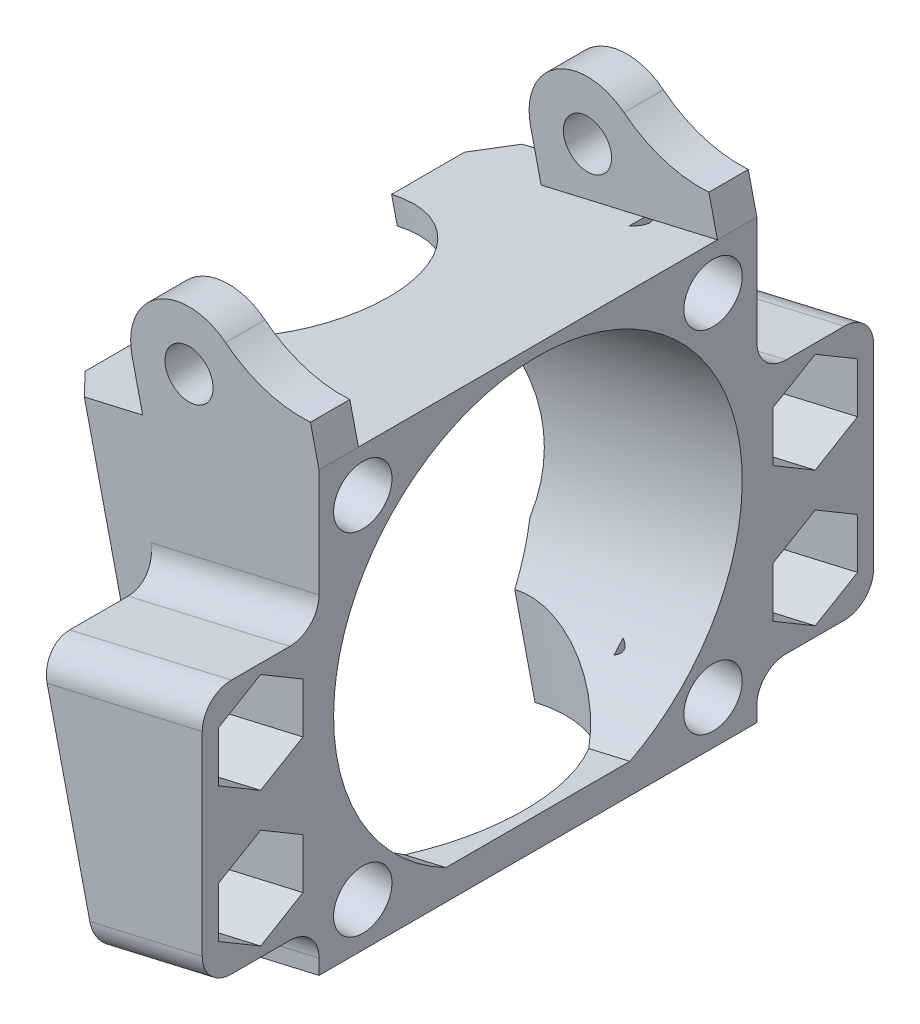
ISO-10303-21;
HEADER;
FILE_DESCRIPTION(('STEP AP214'),'2;1');
FILE_NAME('part.step','',(''),(''),'','','');
FILE_SCHEMA(('AUTOMOTIVE_DESIGN { 1 0 10303 214 1 1 1 1 }'));
ENDSEC;
DATA;
#1=APPLICATION_CONTEXT('core data for automotive mechanical design processes');
#2=APPLICATION_PROTOCOL_DEFINITION('international standard','automotive_design',2000,#1);
#3=PRODUCT_CONTEXT('',#1,'mechanical');
#4=PRODUCT('Part','Part','',(#3));
#5=PRODUCT_RELATED_PRODUCT_CATEGORY('part','',(#4));
#6=PRODUCT_DEFINITION_FORMATION('','',#4);
#7=PRODUCT_DEFINITION_CONTEXT('part definition',#1,'design');
#8=PRODUCT_DEFINITION('design','',#6,#7);
#9=PRODUCT_DEFINITION_SHAPE('','',#8);
#10=(LENGTH_UNIT() NAMED_UNIT(*) SI_UNIT(.MILLI.,.METRE.));
#11=(NAMED_UNIT(*) PLANE_ANGLE_UNIT() SI_UNIT($,.RADIAN.));
#12=(NAMED_UNIT(*) SI_UNIT($,.STERADIAN.) SOLID_ANGLE_UNIT());
#13=UNCERTAINTY_MEASURE_WITH_UNIT(LENGTH_MEASURE(1.E-05),#10,'distance_accuracy_value','');
#14=(GEOMETRIC_REPRESENTATION_CONTEXT(3) GLOBAL_UNCERTAINTY_ASSIGNED_CONTEXT((#13)) GLOBAL_UNIT_ASSIGNED_CONTEXT((#10,
#11,#12)) REPRESENTATION_CONTEXT('',''));
#15=CARTESIAN_POINT('',(0.,0.,0.));
#16=DIRECTION('',(0.,0.,1.));
#17=DIRECTION('',(1.,0.,0.));
#18=AXIS2_PLACEMENT_3D('',#15,#16,#17);
#19=CARTESIAN_POINT('',(0.,0.,15.));
#20=DIRECTION('',(-1.,0.,0.));
#21=DIRECTION('',(0.,0.,1.));
#22=AXIS2_PLACEMENT_3D('',#19,#20,#21);
#23=PLANE('',#22);
#24=DIRECTION('',(0.,-1.,0.));
#25=VECTOR('',#24,1.);
#26=CARTESIAN_POINT('',(0.,0.,-16.1));
#27=LINE('',#26,#25);
#28=CARTESIAN_POINT('',(0.,18.1392228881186,-16.1));
#29=VERTEX_POINT('',#28);
#30=CARTESIAN_POINT('',(0.,14.70250856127,-16.1));
#31=VERTEX_POINT('',#30);
#32=EDGE_CURVE('E1032',#29,#31,#27,.T.);
#33=ORIENTED_EDGE('',*,*,#32,.F.);
#34=DIRECTION('',(0.,-0.509766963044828,0.860312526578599));
#35=VECTOR('',#34,1.);
#36=CARTESIAN_POINT('',(0.,-0.213660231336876,14.8733984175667));
#37=LINE('',#36,#35);
#38=CARTESIAN_POINT('',(0.,19.8575800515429,-19.));
#39=VERTEX_POINT('',#38);
#40=EDGE_CURVE('E1030',#39,#29,#37,.T.);
#41=ORIENTED_EDGE('',*,*,#40,.F.);
#42=DIRECTION('',(0.,0.509766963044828,0.860312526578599));
#43=VECTOR('',#42,1.);
#44=CARTESIAN_POINT('',(0.,29.608345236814,-2.5440386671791));
#45=LINE('',#44,#43);
#46=CARTESIAN_POINT('',(0.,18.1392228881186,-21.9));
#47=VERTEX_POINT('',#46);
#48=EDGE_CURVE('E1028',#47,#39,#45,.T.);
#49=ORIENTED_EDGE('',*,*,#48,.F.);
#50=DIRECTION('',(0.,1.,0.));
#51=VECTOR('',#50,1.);
#52=CARTESIAN_POINT('',(0.,0.,-21.9));
#53=LINE('',#52,#51);
#54=CARTESIAN_POINT('',(0.,14.70250856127,-21.9));
#55=VERTEX_POINT('',#54);
#56=EDGE_CURVE('E1026',#55,#47,#53,.T.);
#57=ORIENTED_EDGE('',*,*,#56,.F.);
#58=DIRECTION('',(0.,0.509766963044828,-0.860312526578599));
#59=VECTOR('',#58,1.);
#60=CARTESIAN_POINT('',(0.,-5.30094351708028,11.8589950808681));
#61=LINE('',#60,#59);
#62=CARTESIAN_POINT('',(0.,12.9841513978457,-19.));
#63=VERTEX_POINT('',#62);
#64=EDGE_CURVE('E1024',#63,#55,#61,.T.);
#65=ORIENTED_EDGE('',*,*,#64,.F.);
#66=DIRECTION('',(0.,-0.509766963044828,-0.860312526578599));
#67=VECTOR('',#66,1.);
#68=CARTESIAN_POINT('',(0.,24.5210619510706,0.470364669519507));
#69=LINE('',#68,#67);
#70=EDGE_CURVE('E1022',#31,#63,#69,.T.);
#71=ORIENTED_EDGE('',*,*,#70,.F.);
#72=EDGE_LOOP('',(#33,#41,#49,#57,#65,#71));
#73=FACE_BOUND('',#72,.T.);
#74=DIRECTION('',(0.,0.509766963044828,-0.860312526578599));
#75=VECTOR('',#74,1.);
#76=CARTESIAN_POINT('',(0.,11.3642948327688,21.7337646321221));
#77=LINE('',#76,#75);
#78=CARTESIAN_POINT('',(0.,12.9841513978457,19.));
#79=VERTEX_POINT('',#78);
#80=CARTESIAN_POINT('',(0.,14.70250856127,16.1));
#81=VERTEX_POINT('',#80);
#82=EDGE_CURVE('E1002',#79,#81,#77,.T.);
#83=ORIENTED_EDGE('',*,*,#82,.F.);
#84=DIRECTION('',(0.,-0.509766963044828,-0.860312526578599));
#85=VECTOR('',#84,1.);
#86=CARTESIAN_POINT('',(0.,7.85582360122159,10.3451342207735));
#87=LINE('',#86,#85);
#88=CARTESIAN_POINT('',(0.,14.70250856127,21.9));
#89=VERTEX_POINT('',#88);
#90=EDGE_CURVE('E1000',#89,#79,#87,.T.);
#91=ORIENTED_EDGE('',*,*,#90,.F.);
#92=DIRECTION('',(0.,-1.,0.));
#93=VECTOR('',#92,1.);
#94=CARTESIAN_POINT('',(0.,0.,21.9));
#95=LINE('',#94,#93);
#96=CARTESIAN_POINT('',(0.,18.1392228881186,21.9));
#97=VERTEX_POINT('',#96);
#98=EDGE_CURVE('E998',#97,#89,#95,.T.);
#99=ORIENTED_EDGE('',*,*,#98,.F.);
#100=DIRECTION('',(0.,-0.509766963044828,0.860312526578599));
#101=VECTOR('',#100,1.);
#102=CARTESIAN_POINT('',(0.,16.4515781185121,24.7481679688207));
#103=LINE('',#102,#101);
#104=CARTESIAN_POINT('',(0.,19.8575800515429,19.));
#105=VERTEX_POINT('',#104);
#106=EDGE_CURVE('E996',#105,#97,#103,.T.);
#107=ORIENTED_EDGE('',*,*,#106,.F.);
#108=DIRECTION('',(0.,0.509766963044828,0.860312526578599));
#109=VECTOR('',#108,1.);
#110=CARTESIAN_POINT('',(0.,12.943106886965,7.33073088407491));
#111=LINE('',#110,#109);
#112=CARTESIAN_POINT('',(0.,18.1392228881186,16.1));
#113=VERTEX_POINT('',#112);
#114=EDGE_CURVE('E994',#113,#105,#111,.T.);
#115=ORIENTED_EDGE('',*,*,#114,.F.);
#116=DIRECTION('',(0.,1.,0.));
#117=VECTOR('',#116,1.);
#118=CARTESIAN_POINT('',(0.,0.,16.1));
#119=LINE('',#118,#117);
#120=EDGE_CURVE('E990',#81,#113,#119,.T.);
#121=ORIENTED_EDGE('',*,*,#120,.F.);
#122=EDGE_LOOP('',(#83,#91,#99,#107,#115,#121));
#123=FACE_BOUND('',#122,.T.);
#124=CARTESIAN_POINT('',(0.,27.,-12.));
#125=DIRECTION('',(1.,0.,0.));
#126=DIRECTION('',(0.,0.,1.));
#127=AXIS2_PLACEMENT_3D('',#124,#125,#126);
#128=CIRCLE('',#127,2.);
#129=CARTESIAN_POINT('',(0.,27.,-10.));
#130=VERTEX_POINT('',#129);
#131=EDGE_CURVE('E752',#130,#130,#128,.T.);
#132=ORIENTED_EDGE('',*,*,#131,.F.);
#133=EDGE_LOOP('',(#132));
#134=FACE_BOUND('',#133,.T.);
#135=CARTESIAN_POINT('',(0.,3.,-12.));
#136=DIRECTION('',(1.,0.,0.));
#137=DIRECTION('',(0.,0.,-1.));
#138=AXIS2_PLACEMENT_3D('',#135,#136,#137);
#139=CIRCLE('',#138,2.);
#140=CARTESIAN_POINT('',(0.,3.,-14.));
#141=VERTEX_POINT('',#140);
#142=EDGE_CURVE('E757',#141,#141,#139,.T.);
#143=ORIENTED_EDGE('',*,*,#142,.F.);
#144=EDGE_LOOP('',(#143));
#145=FACE_BOUND('',#144,.T.);
#146=CARTESIAN_POINT('',(0.,3.,12.));
#147=DIRECTION('',(1.,0.,0.));
#148=DIRECTION('',(0.,0.,1.));
#149=AXIS2_PLACEMENT_3D('',#146,#147,#148);
#150=CIRCLE('',#149,2.);
#151=CARTESIAN_POINT('',(0.,3.,14.));
#152=VERTEX_POINT('',#151);
#153=EDGE_CURVE('E742',#152,#152,#150,.T.);
#154=ORIENTED_EDGE('',*,*,#153,.F.);
#155=EDGE_LOOP('',(#154));
#156=FACE_BOUND('',#155,.T.);
#157=CARTESIAN_POINT('',(0.,27.,12.));
#158=DIRECTION('',(1.,0.,0.));
#159=DIRECTION('',(0.,0.,-1.));
#160=AXIS2_PLACEMENT_3D('',#157,#158,#159);
#161=CIRCLE('',#160,2.);
#162=CARTESIAN_POINT('',(0.,27.,10.));
#163=VERTEX_POINT('',#162);
#164=EDGE_CURVE('E751',#163,#163,#161,.T.);
#165=ORIENTED_EDGE('',*,*,#164,.F.);
#166=EDGE_LOOP('',(#165));
#167=FACE_BOUND('',#166,.T.);
#168=DIRECTION('',(0.,0.,1.));
#169=VECTOR('',#168,1.);
#170=CARTESIAN_POINT('',(0.,2.05260821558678,15.));
#171=LINE('',#170,#169);
#172=CARTESIAN_POINT('',(0.,2.05260821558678,-6.30476010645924));
#173=VERTEX_POINT('',#172);
#174=CARTESIAN_POINT('',(0.,2.05260821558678,6.30476010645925));
#175=VERTEX_POINT('',#174);
#176=EDGE_CURVE('E1422',#173,#175,#171,.T.);
#177=ORIENTED_EDGE('',*,*,#176,.T.);
#178=CARTESIAN_POINT('',(0.,14.8814095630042,0.));
#179=DIRECTION('',(-1.,0.,0.));
#180=DIRECTION('',(0.,-1.,0.));
#181=AXIS2_PLACEMENT_3D('',#178,#179,#180);
#182=ELLIPSE('',#181,14.3682575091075,14.);
#183=EDGE_CURVE('E1420',#175,#173,#182,.T.);
#184=ORIENTED_EDGE('',*,*,#183,.T.);
#185=EDGE_LOOP('',(#177,#184));
#186=FACE_BOUND('',#185,.T.);
#187=DIRECTION('',(0.,-1.,0.));
#188=VECTOR('',#187,1.);
#189=CARTESIAN_POINT('',(0.,24.3666758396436,23.));
#190=LINE('',#189,#188);
#191=CARTESIAN_POINT('',(0.,18.4734739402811,23.));
#192=VERTEX_POINT('',#191);
#193=CARTESIAN_POINT('',(0.,5.13152053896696,23.));
#194=VERTEX_POINT('',#193);
#195=EDGE_CURVE('E629',#192,#194,#190,.T.);
#196=ORIENTED_EDGE('',*,*,#195,.T.);
#197=CARTESIAN_POINT('',(0.,5.13152053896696,21.));
#198=DIRECTION('',(-1.,0.,0.));
#199=DIRECTION('',(0.,-1.,0.));
#200=AXIS2_PLACEMENT_3D('',#197,#198,#199);
#201=ELLIPSE('',#200,2.05260821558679,2.);
#202=CARTESIAN_POINT('',(0.,3.07891232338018,21.));
#203=VERTEX_POINT('',#202);
#204=EDGE_CURVE('E953',#194,#203,#201,.F.);
#205=ORIENTED_EDGE('',*,*,#204,.T.);
#206=DIRECTION('',(0.,0.,-1.));
#207=VECTOR('',#206,1.);
#208=CARTESIAN_POINT('',(0.,3.07891232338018,23.));
#209=LINE('',#208,#207);
#210=CARTESIAN_POINT('',(0.,3.07891232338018,17.));
#211=VERTEX_POINT('',#210);
#212=EDGE_CURVE('E625',#203,#211,#209,.T.);
#213=ORIENTED_EDGE('',*,*,#212,.T.);
#214=CARTESIAN_POINT('',(0.,1.02630410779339,17.));
#215=DIRECTION('',(-1.,0.,0.));
#216=DIRECTION('',(0.,1.,0.));
#217=AXIS2_PLACEMENT_3D('',#214,#215,#216);
#218=ELLIPSE('',#217,2.05260821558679,2.);
#219=CARTESIAN_POINT('',(0.,1.02630410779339,15.));
#220=VERTEX_POINT('',#219);
#221=EDGE_CURVE('E974',#211,#220,#218,.T.);
#222=ORIENTED_EDGE('',*,*,#221,.T.);
#223=DIRECTION('',(0.,1.,0.));
#224=VECTOR('',#223,1.);
#225=CARTESIAN_POINT('',(0.,0.,15.));
#226=LINE('',#225,#224);
#227=CARTESIAN_POINT('',(0.,0.,15.));
#228=VERTEX_POINT('',#227);
#229=EDGE_CURVE('E1339',#228,#220,#226,.T.);
#230=ORIENTED_EDGE('',*,*,#229,.F.);
#231=DIRECTION('',(0.,0.,-1.));
#232=VECTOR('',#231,1.);
#233=CARTESIAN_POINT('',(0.,0.,15.));
#234=LINE('',#233,#232);
#235=CARTESIAN_POINT('',(0.,0.,-15.));
#236=VERTEX_POINT('',#235);
#237=EDGE_CURVE('E1371',#228,#236,#234,.T.);
#238=ORIENTED_EDGE('',*,*,#237,.T.);
#239=DIRECTION('',(0.,1.,0.));
#240=VECTOR('',#239,1.);
#241=CARTESIAN_POINT('',(0.,0.,-15.));
#242=LINE('',#241,#240);
#243=CARTESIAN_POINT('',(0.,1.02630410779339,-15.));
#244=VERTEX_POINT('',#243);
#245=EDGE_CURVE('E1357',#236,#244,#242,.T.);
#246=ORIENTED_EDGE('',*,*,#245,.T.);
#247=CARTESIAN_POINT('',(0.,1.02630410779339,-17.));
#248=DIRECTION('',(-1.,0.,0.));
#249=DIRECTION('',(0.,-1.,0.));
#250=AXIS2_PLACEMENT_3D('',#247,#248,#249);
#251=ELLIPSE('',#250,2.05260821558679,2.);
#252=CARTESIAN_POINT('',(0.,3.07891232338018,-17.));
#253=VERTEX_POINT('',#252);
#254=EDGE_CURVE('E979',#244,#253,#251,.T.);
#255=ORIENTED_EDGE('',*,*,#254,.T.);
#256=DIRECTION('',(0.,0.,-1.));
#257=VECTOR('',#256,1.);
#258=CARTESIAN_POINT('',(0.,3.07891232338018,-23.));
#259=LINE('',#258,#257);
#260=CARTESIAN_POINT('',(0.,3.07891232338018,-21.));
#261=VERTEX_POINT('',#260);
#262=EDGE_CURVE('E645',#253,#261,#259,.T.);
#263=ORIENTED_EDGE('',*,*,#262,.T.);
#264=CARTESIAN_POINT('',(0.,5.13152053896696,-21.));
#265=DIRECTION('',(-1.,0.,0.));
#266=DIRECTION('',(0.,-1.,0.));
#267=AXIS2_PLACEMENT_3D('',#264,#265,#266);
#268=ELLIPSE('',#267,2.05260821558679,2.);
#269=CARTESIAN_POINT('',(0.,5.13152053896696,-23.));
#270=VERTEX_POINT('',#269);
#271=EDGE_CURVE('E937',#261,#270,#268,.F.);
#272=ORIENTED_EDGE('',*,*,#271,.T.);
#273=DIRECTION('',(0.,1.,0.));
#274=VECTOR('',#273,1.);
#275=CARTESIAN_POINT('',(0.,24.3666758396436,-23.));
#276=LINE('',#275,#274);
#277=CARTESIAN_POINT('',(0.,18.4734739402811,-23.));
#278=VERTEX_POINT('',#277);
#279=EDGE_CURVE('E642',#270,#278,#276,.T.);
#280=ORIENTED_EDGE('',*,*,#279,.T.);
#281=CARTESIAN_POINT('',(0.,18.4734739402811,-21.));
#282=DIRECTION('',(-1.,0.,0.));
#283=DIRECTION('',(0.,-1.,0.));
#284=AXIS2_PLACEMENT_3D('',#281,#282,#283);
#285=ELLIPSE('',#284,2.05260821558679,2.);
#286=CARTESIAN_POINT('',(0.,20.5260821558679,-21.));
#287=VERTEX_POINT('',#286);
#288=EDGE_CURVE('E943',#278,#287,#285,.F.);
#289=ORIENTED_EDGE('',*,*,#288,.T.);
#290=DIRECTION('',(0.,0.,1.));
#291=VECTOR('',#290,1.);
#292=CARTESIAN_POINT('',(0.,20.5260821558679,-15.));
#293=LINE('',#292,#291);
#294=CARTESIAN_POINT('',(0.,20.5260821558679,-17.));
#295=VERTEX_POINT('',#294);
#296=EDGE_CURVE('E649',#287,#295,#293,.T.);
#297=ORIENTED_EDGE('',*,*,#296,.T.);
#298=CARTESIAN_POINT('',(0.,22.5786903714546,-17.));
#299=DIRECTION('',(-1.,0.,0.));
#300=DIRECTION('',(0.,-1.,0.));
#301=AXIS2_PLACEMENT_3D('',#298,#299,#300);
#302=ELLIPSE('',#301,2.05260821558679,2.);
#303=CARTESIAN_POINT('',(0.,22.5786903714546,-15.));
#304=VERTEX_POINT('',#303);
#305=EDGE_CURVE('E988',#295,#304,#302,.T.);
#306=ORIENTED_EDGE('',*,*,#305,.T.);
#307=CARTESIAN_POINT('',(0.,30.,-15.));
#308=VERTEX_POINT('',#307);
#309=EDGE_CURVE('E1355',#304,#308,#242,.T.);
#310=ORIENTED_EDGE('',*,*,#309,.T.);
#311=DIRECTION('',(0.,0.,-1.));
#312=VECTOR('',#311,1.);
#313=CARTESIAN_POINT('',(0.,30.,-12.3));
#314=LINE('',#313,#312);
#315=CARTESIAN_POINT('',(0.,30.,-12.3));
#316=VERTEX_POINT('',#315);
#317=EDGE_CURVE('E691',#316,#308,#314,.T.);
#318=ORIENTED_EDGE('',*,*,#317,.F.);
#319=DIRECTION('',(0.,0.,-1.));
#320=VECTOR('',#319,1.);
#321=CARTESIAN_POINT('',(0.,30.,15.));
#322=LINE('',#321,#320);
#323=CARTESIAN_POINT('',(0.,30.,12.3));
#324=VERTEX_POINT('',#323);
#325=EDGE_CURVE('E1367',#324,#316,#322,.T.);
#326=ORIENTED_EDGE('',*,*,#325,.F.);
#327=CARTESIAN_POINT('',(0.,30.,15.));
#328=VERTEX_POINT('',#327);
#329=EDGE_CURVE('E1368',#328,#324,#322,.T.);
#330=ORIENTED_EDGE('',*,*,#329,.F.);
#331=CARTESIAN_POINT('',(0.,22.5786903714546,15.));
#332=VERTEX_POINT('',#331);
#333=EDGE_CURVE('E1346',#332,#328,#226,.T.);
#334=ORIENTED_EDGE('',*,*,#333,.F.);
#335=CARTESIAN_POINT('',(0.,22.5786903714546,17.));
#336=DIRECTION('',(-1.,0.,0.));
#337=DIRECTION('',(0.,1.,0.));
#338=AXIS2_PLACEMENT_3D('',#335,#336,#337);
#339=ELLIPSE('',#338,2.05260821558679,2.);
#340=CARTESIAN_POINT('',(0.,20.5260821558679,17.));
#341=VERTEX_POINT('',#340);
#342=EDGE_CURVE('E984',#332,#341,#339,.T.);
#343=ORIENTED_EDGE('',*,*,#342,.T.);
#344=DIRECTION('',(0.,0.,1.));
#345=VECTOR('',#344,1.);
#346=CARTESIAN_POINT('',(0.,20.5260821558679,15.));
#347=LINE('',#346,#345);
#348=CARTESIAN_POINT('',(0.,20.5260821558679,21.));
#349=VERTEX_POINT('',#348);
#350=EDGE_CURVE('E622',#341,#349,#347,.T.);
#351=ORIENTED_EDGE('',*,*,#350,.T.);
#352=CARTESIAN_POINT('',(0.,18.4734739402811,21.));
#353=DIRECTION('',(-1.,0.,0.));
#354=DIRECTION('',(0.,-1.,0.));
#355=AXIS2_PLACEMENT_3D('',#352,#353,#354);
#356=ELLIPSE('',#355,2.05260821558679,2.);
#357=EDGE_CURVE('E946',#349,#192,#356,.F.);
#358=ORIENTED_EDGE('',*,*,#357,.T.);
#359=EDGE_LOOP('',(#196,#205,#213,#222,#230,#238,#246,#255,#263,#272,#280,#289,#297,#306,#310,
#318,#326,#330,#334,#343,#351,#358));
#360=FACE_BOUND('',#359,.T.);
#361=DIRECTION('',(0.,1.,0.));
#362=VECTOR('',#361,1.);
#363=CARTESIAN_POINT('',(0.,0.,-21.9));
#364=LINE('',#363,#362);
#365=CARTESIAN_POINT('',(0.,5.46577159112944,-21.9));
#366=VERTEX_POINT('',#365);
#367=CARTESIAN_POINT('',(0.,8.90248591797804,-21.9));
#368=VERTEX_POINT('',#367);
#369=EDGE_CURVE('E1019',#366,#368,#364,.T.);
#370=ORIENTED_EDGE('',*,*,#369,.F.);
#371=DIRECTION('',(0.,0.509766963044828,-0.860312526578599));
#372=VECTOR('',#371,1.);
#373=CARTESIAN_POINT('',(0.,-12.1374002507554,7.80814183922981));
#374=LINE('',#373,#372);
#375=CARTESIAN_POINT('',(0.,3.74741442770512,-19.));
#376=VERTEX_POINT('',#375);
#377=EDGE_CURVE('E1017',#376,#366,#374,.T.);
#378=ORIENTED_EDGE('',*,*,#377,.F.);
#379=DIRECTION('',(0.,-0.509766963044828,-0.860312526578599));
#380=VECTOR('',#379,1.);
#381=CARTESIAN_POINT('',(0.,17.6846052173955,4.52121791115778));
#382=LINE('',#381,#380);
#383=CARTESIAN_POINT('',(0.,5.46577159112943,-16.1));
#384=VERTEX_POINT('',#383);
#385=EDGE_CURVE('E1015',#384,#376,#382,.T.);
#386=ORIENTED_EDGE('',*,*,#385,.F.);
#387=DIRECTION('',(0.,-1.,0.));
#388=VECTOR('',#387,1.);
#389=CARTESIAN_POINT('',(0.,0.,-16.1));
#390=LINE('',#389,#388);
#391=CARTESIAN_POINT('',(0.,8.90248591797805,-16.1));
#392=VERTEX_POINT('',#391);
#393=EDGE_CURVE('E1013',#392,#384,#390,.T.);
#394=ORIENTED_EDGE('',*,*,#393,.F.);
#395=DIRECTION('',(0.,-0.509766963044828,0.860312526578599));
#396=VECTOR('',#395,1.);
#397=CARTESIAN_POINT('',(0.,-7.05011696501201,10.8225451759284));
#398=LINE('',#397,#396);
#399=CARTESIAN_POINT('',(0.,10.6208430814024,-19.));
#400=VERTEX_POINT('',#399);
#401=EDGE_CURVE('E1011',#400,#392,#398,.T.);
#402=ORIENTED_EDGE('',*,*,#401,.F.);
#403=DIRECTION('',(0.,0.509766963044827,0.8603125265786));
#404=VECTOR('',#403,1.);
#405=CARTESIAN_POINT('',(0.,22.7718885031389,1.50681457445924));
#406=LINE('',#405,#404);
#407=EDGE_CURVE('E1004',#368,#400,#406,.T.);
#408=ORIENTED_EDGE('',*,*,#407,.F.);
#409=EDGE_LOOP('',(#370,#378,#386,#394,#402,#408));
#410=FACE_BOUND('',#409,.T.);
#411=DIRECTION('',(0.,-0.509766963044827,0.8603125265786));
#412=VECTOR('',#411,1.);
#413=CARTESIAN_POINT('',(0.,9.61512138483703,20.6973147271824));
#414=LINE('',#413,#412);
#415=CARTESIAN_POINT('',(0.,10.6208430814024,19.));
#416=VERTEX_POINT('',#415);
#417=CARTESIAN_POINT('',(0.,8.90248591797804,21.9));
#418=VERTEX_POINT('',#417);
#419=EDGE_CURVE('E11',#416,#418,#414,.T.);
#420=ORIENTED_EDGE('',*,*,#419,.F.);
#421=DIRECTION('',(0.,0.509766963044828,0.860312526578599));
#422=VECTOR('',#421,1.);
#423=CARTESIAN_POINT('',(0.,6.10665015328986,11.3815841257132));
#424=LINE('',#423,#422);
#425=CARTESIAN_POINT('',(0.,8.90248591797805,16.1));
#426=VERTEX_POINT('',#425);
#427=EDGE_CURVE('E41',#426,#416,#424,.T.);
#428=ORIENTED_EDGE('',*,*,#427,.F.);
#429=DIRECTION('',(0.,1.,0.));
#430=VECTOR('',#429,1.);
#431=CARTESIAN_POINT('',(0.,0.,16.1));
#432=LINE('',#431,#430);
#433=CARTESIAN_POINT('',(0.,5.46577159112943,16.1));
#434=VERTEX_POINT('',#433);
#435=EDGE_CURVE('E1040',#434,#426,#432,.T.);
#436=ORIENTED_EDGE('',*,*,#435,.F.);
#437=DIRECTION('',(0.,0.509766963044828,-0.860312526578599));
#438=VECTOR('',#437,1.);
#439=CARTESIAN_POINT('',(0.,4.52783809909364,17.6829113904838));
#440=LINE('',#439,#438);
#441=CARTESIAN_POINT('',(0.,3.74741442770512,19.));
#442=VERTEX_POINT('',#441);
#443=EDGE_CURVE('E1038',#442,#434,#440,.T.);
#444=ORIENTED_EDGE('',*,*,#443,.F.);
#445=DIRECTION('',(0.,-0.509766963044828,-0.860312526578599));
#446=VECTOR('',#445,1.);
#447=CARTESIAN_POINT('',(0.,1.01936686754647,14.3959874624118));
#448=LINE('',#447,#446);
#449=CARTESIAN_POINT('',(0.,5.46577159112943,21.9));
#450=VERTEX_POINT('',#449);
#451=EDGE_CURVE('E1036',#450,#442,#448,.T.);
#452=ORIENTED_EDGE('',*,*,#451,.F.);
#453=DIRECTION('',(0.,-1.,0.));
#454=VECTOR('',#453,1.);
#455=CARTESIAN_POINT('',(0.,0.,21.9));
#456=LINE('',#455,#454);
#457=EDGE_CURVE('E1034',#418,#450,#456,.T.);
#458=ORIENTED_EDGE('',*,*,#457,.F.);
#459=EDGE_LOOP('',(#420,#428,#436,#444,#452,#458));
#460=FACE_BOUND('',#459,.T.);
#461=ADVANCED_FACE('F33',(#73,#123,#134,#145,#156,#167,#186,#360,#410,#460),#23,.F.);
#462=CARTESIAN_POINT('',(4.12233916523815,17.3725827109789,-19.));
#463=DIRECTION('',(-0.974370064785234,-0.224951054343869,0.));
#464=DIRECTION('',(0.224951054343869,-0.974370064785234,0.));
#465=AXIS2_PLACEMENT_3D('',#462,#463,#464);
#466=CYLINDRICAL_SURFACE('',#465,1.65);
#467=CARTESIAN_POINT('',(-10.1776455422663,14.0711711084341,-19.));
#468=DIRECTION('',(-0.974370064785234,-0.224951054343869,0.));
#469=DIRECTION('',(0.224951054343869,-0.974370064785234,0.));
#470=AXIS2_PLACEMENT_3D('',#467,#468,#469);
#471=CIRCLE('',#470,1.65);
#472=CARTESIAN_POINT('',(-9.80647630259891,12.4634605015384,-19.));
#473=VERTEX_POINT('',#472);
#474=EDGE_CURVE('E612',#473,#473,#471,.T.);
#475=ORIENTED_EDGE('',*,*,#474,.T.);
#476=EDGE_LOOP('',(#475));
#477=FACE_BOUND('',#476,.T.);
#478=CARTESIAN_POINT('',(-8.22890541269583,14.5210732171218,-19.));
#479=DIRECTION('',(0.974370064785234,0.224951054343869,0.));
#480=DIRECTION('',(-0.224951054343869,0.974370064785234,0.));
#481=AXIS2_PLACEMENT_3D('',#478,#479,#480);
#482=CIRCLE('',#481,1.65);
#483=CARTESIAN_POINT('',(-8.60007465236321,16.1287838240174,-19.));
#484=VERTEX_POINT('',#483);
#485=EDGE_CURVE('E581',#484,#484,#482,.F.);
#486=ORIENTED_EDGE('',*,*,#485,.F.);
#487=EDGE_LOOP('',(#486));
#488=FACE_BOUND('',#487,.T.);
#489=ADVANCED_FACE('F878',(#477,#488),#466,.F.);
#490=CARTESIAN_POINT('',(6.14689865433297,8.60325212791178,-19.));
#491=DIRECTION('',(-0.974370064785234,-0.224951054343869,0.));
#492=DIRECTION('',(0.224951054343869,-0.974370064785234,0.));
#493=AXIS2_PLACEMENT_3D('',#490,#491,#492);
#494=CYLINDRICAL_SURFACE('',#493,1.65);
#495=CARTESIAN_POINT('',(-8.15308605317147,5.30184052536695,-19.));
#496=DIRECTION('',(-0.974370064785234,-0.224951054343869,0.));
#497=DIRECTION('',(-0.224951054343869,0.974370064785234,0.));
#498=AXIS2_PLACEMENT_3D('',#495,#496,#497);
#499=CIRCLE('',#498,1.65);
#500=CARTESIAN_POINT('',(-8.52425529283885,6.90955113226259,-19.));
#501=VERTEX_POINT('',#500);
#502=EDGE_CURVE('E609',#501,#501,#499,.T.);
#503=ORIENTED_EDGE('',*,*,#502,.T.);
#504=EDGE_LOOP('',(#503));
#505=FACE_BOUND('',#504,.T.);
#506=CARTESIAN_POINT('',(-6.204345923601,5.75174263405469,-19.));
#507=DIRECTION('',(0.974370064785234,0.224951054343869,0.));
#508=DIRECTION('',(-0.224951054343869,0.974370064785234,0.));
#509=AXIS2_PLACEMENT_3D('',#506,#507,#508);
#510=CIRCLE('',#509,1.65);
#511=CARTESIAN_POINT('',(-6.57551516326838,7.35945324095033,-19.));
#512=VERTEX_POINT('',#511);
#513=EDGE_CURVE('E509',#512,#512,#510,.F.);
#514=ORIENTED_EDGE('',*,*,#513,.F.);
#515=EDGE_LOOP('',(#514));
#516=FACE_BOUND('',#515,.T.);
#517=ADVANCED_FACE('F884',(#505,#516),#494,.F.);
#518=CARTESIAN_POINT('',(0.,0.,15.));
#519=DIRECTION('',(0.,0.,1.));
#520=DIRECTION('',(1.,0.,0.));
#521=AXIS2_PLACEMENT_3D('',#518,#519,#520);
#522=PLANE('',#521);
#523=CARTESIAN_POINT('',(-8.90455191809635,31.2283953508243,15.));
#524=DIRECTION('',(0.,0.,1.));
#525=DIRECTION('',(1.,0.,0.));
#526=AXIS2_PLACEMENT_3D('',#523,#524,#525);
#527=CIRCLE('',#526,1.65);
#528=CARTESIAN_POINT('',(-7.25455191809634,31.2283953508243,15.));
#529=VERTEX_POINT('',#528);
#530=EDGE_CURVE('E694',#529,#529,#527,.T.);
#531=ORIENTED_EDGE('',*,*,#530,.F.);
#532=EDGE_LOOP('',(#531));
#533=FACE_BOUND('',#532,.T.);
#534=ORIENTED_EDGE('',*,*,#229,.T.);
#535=DIRECTION('',(-0.974370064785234,-0.224951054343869,0.));
#536=VECTOR('',#535,1.);
#537=CARTESIAN_POINT('',(-6.80337972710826,-0.544379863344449,15.));
#538=LINE('',#537,#536);
#539=CARTESIAN_POINT('',(-6.80337972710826,-0.544379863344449,15.));
#540=VERTEX_POINT('',#539);
#541=EDGE_CURVE('E1299',#220,#540,#538,.T.);
#542=ORIENTED_EDGE('',*,*,#541,.T.);
#543=DIRECTION('',(0.224951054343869,-0.974370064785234,0.));
#544=VECTOR('',#543,1.);
#545=CARTESIAN_POINT('',(-7.25328183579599,1.40436026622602,15.));
#546=LINE('',#545,#544);
#547=CARTESIAN_POINT('',(-11.5273518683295,19.9173914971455,15.));
#548=VERTEX_POINT('',#547);
#549=EDGE_CURVE('E626',#548,#540,#546,.T.);
#550=ORIENTED_EDGE('',*,*,#549,.F.);
#551=DIRECTION('',(-0.974370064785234,-0.224951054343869,0.));
#552=VECTOR('',#551,1.);
#553=CARTESIAN_POINT('',(-0.449902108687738,22.4748222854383,15.));
#554=LINE('',#553,#552);
#555=EDGE_CURVE('E1297',#548,#332,#554,.F.);
#556=ORIENTED_EDGE('',*,*,#555,.T.);
#557=ORIENTED_EDGE('',*,*,#333,.T.);
#558=DIRECTION('',(-0.224951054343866,0.974370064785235,0.));
#559=VECTOR('',#558,1.);
#560=CARTESIAN_POINT('',(0.,30.,15.));
#561=LINE('',#560,#559);
#562=CARTESIAN_POINT('',(-0.584872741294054,32.5333621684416,15.));
#563=VERTEX_POINT('',#562);
#564=EDGE_CURVE('E708',#328,#563,#561,.T.);
#565=ORIENTED_EDGE('',*,*,#564,.T.);
#566=CARTESIAN_POINT('',(-1.16914273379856,40.8885267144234,15.));
#567=DIRECTION('',(0.,0.,-1.));
#568=DIRECTION('',(1.,0.,0.));
#569=AXIS2_PLACEMENT_3D('',#566,#567,#568);
#570=CIRCLE('',#569,8.37556839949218);
#571=CARTESIAN_POINT('',(-6.40433247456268,34.3507186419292,15.));
#572=VERTEX_POINT('',#571);
#573=EDGE_CURVE('E731',#563,#572,#570,.T.);
#574=ORIENTED_EDGE('',*,*,#573,.T.);
#575=CARTESIAN_POINT('',(-8.90455191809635,31.2283953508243,15.));
#576=DIRECTION('',(0.,0.,1.));
#577=DIRECTION('',(1.,0.,0.));
#578=AXIS2_PLACEMENT_3D('',#575,#576,#577);
#579=CIRCLE('',#578,4.);
#580=CARTESIAN_POINT('',(-12.8020321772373,30.3285911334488,15.));
#581=VERTEX_POINT('',#580);
#582=EDGE_CURVE('E734',#572,#581,#579,.T.);
#583=ORIENTED_EDGE('',*,*,#582,.T.);
#584=DIRECTION('',(0.224951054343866,-0.974370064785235,0.));
#585=VECTOR('',#584,1.);
#586=CARTESIAN_POINT('',(-12.0821888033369,27.2106069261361,15.));
#587=LINE('',#586,#585);
#588=CARTESIAN_POINT('',(-12.0821888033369,27.2106069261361,15.));
#589=VERTEX_POINT('',#588);
#590=EDGE_CURVE('E737',#581,#589,#587,.T.);
#591=ORIENTED_EDGE('',*,*,#590,.T.);
#592=DIRECTION('',(-0.974370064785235,-0.224951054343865,0.));
#593=VECTOR('',#592,1.);
#594=CARTESIAN_POINT('',(-18.0258461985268,25.8384054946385,15.));
#595=LINE('',#594,#593);
#596=CARTESIAN_POINT('',(-16.0771060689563,26.2883076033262,15.));
#597=VERTEX_POINT('',#596);
#598=EDGE_CURVE('E1345',#589,#597,#595,.T.);
#599=ORIENTED_EDGE('',*,*,#598,.T.);
#600=DIRECTION('',(0.224951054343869,-0.974370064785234,0.));
#601=VECTOR('',#600,1.);
#602=CARTESIAN_POINT('',(-9.50153886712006,-2.19360309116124,15.));
#603=LINE('',#602,#601);
#604=CARTESIAN_POINT('',(-9.50153886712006,-2.19360309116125,15.));
#605=VERTEX_POINT('',#604);
#606=EDGE_CURVE('E1462',#597,#605,#603,.T.);
#607=ORIENTED_EDGE('',*,*,#606,.T.);
#608=DIRECTION('',(0.974370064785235,0.224951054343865,0.));
#609=VECTOR('',#608,1.);
#610=CARTESIAN_POINT('',(-11.4502789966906,-2.64350519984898,15.));
#611=LINE('',#610,#609);
#612=EDGE_CURVE('E1342',#605,#228,#611,.T.);
#613=ORIENTED_EDGE('',*,*,#612,.T.);
#614=EDGE_LOOP('',(#534,#542,#550,#556,#557,#565,#574,#583,#591,#599,#607,#613));
#615=FACE_BOUND('',#614,.T.);
#616=ADVANCED_FACE('F1172',(#533,#615),#522,.T.);
#617=CARTESIAN_POINT('',(-18.0258461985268,25.8384054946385,15.));
#618=DIRECTION('',(0.224951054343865,-0.974370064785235,0.));
#619=DIRECTION('',(0.974370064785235,0.224951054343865,0.));
#620=AXIS2_PLACEMENT_3D('',#617,#618,#619);
#621=PLANE('',#620);
#622=DIRECTION('',(0.974370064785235,0.224951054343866,0.));
#623=VECTOR('',#622,1.);
#624=CARTESIAN_POINT('',(-12.0821888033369,27.2106069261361,-12.3));
#625=LINE('',#624,#623);
#626=CARTESIAN_POINT('',(-4.42948853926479,28.9773719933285,-12.3));
#627=VERTEX_POINT('',#626);
#628=EDGE_CURVE('E673',#627,#316,#625,.T.);
#629=ORIENTED_EDGE('',*,*,#628,.F.);
#630=CARTESIAN_POINT('',(-12.9944276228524,27.,-12.));
#631=DIRECTION('',(0.224951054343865,-0.974370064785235,0.));
#632=DIRECTION('',(0.974370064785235,0.224951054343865,0.));
#633=AXIS2_PLACEMENT_3D('',#630,#631,#632);
#634=ELLIPSE('',#633,8.89082296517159,2.);
#635=CARTESIAN_POINT('',(-5.,28.8456590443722,-11.2295827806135));
#636=VERTEX_POINT('',#635);
#637=EDGE_CURVE('E1293',#627,#636,#634,.T.);
#638=ORIENTED_EDGE('',*,*,#637,.T.);
#639=DIRECTION('',(0.,0.,-1.));
#640=VECTOR('',#639,1.);
#641=CARTESIAN_POINT('',(-5.,28.8456590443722,15.));
#642=LINE('',#641,#640);
#643=CARTESIAN_POINT('',(-5.,28.8456590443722,-12.3));
#644=VERTEX_POINT('',#643);
#645=EDGE_CURVE('E1290',#636,#644,#642,.T.);
#646=ORIENTED_EDGE('',*,*,#645,.T.);
#647=CARTESIAN_POINT('',(-12.0821888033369,27.2106069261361,-12.3));
#648=VERTEX_POINT('',#647);
#649=EDGE_CURVE('E668',#648,#644,#625,.T.);
#650=ORIENTED_EDGE('',*,*,#649,.F.);
#651=DIRECTION('',(0.,0.,-1.));
#652=VECTOR('',#651,1.);
#653=CARTESIAN_POINT('',(-12.0821888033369,27.2106069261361,-12.3));
#654=LINE('',#653,#652);
#655=CARTESIAN_POINT('',(-12.0821888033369,27.2106069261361,-15.));
#656=VERTEX_POINT('',#655);
#657=EDGE_CURVE('E682',#648,#656,#654,.T.);
#658=ORIENTED_EDGE('',*,*,#657,.T.);
#659=DIRECTION('',(-0.974370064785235,-0.224951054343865,0.));
#660=VECTOR('',#659,1.);
#661=CARTESIAN_POINT('',(-18.0258461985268,25.8384054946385,-15.));
#662=LINE('',#661,#660);
#663=CARTESIAN_POINT('',(-16.0771060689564,26.2883076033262,-15.));
#664=VERTEX_POINT('',#663);
#665=EDGE_CURVE('E1360',#656,#664,#662,.T.);
#666=ORIENTED_EDGE('',*,*,#665,.T.);
#667=DIRECTION('',(0.688983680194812,0.15906441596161,-0.707106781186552));
#668=VECTOR('',#667,1.);
#669=CARTESIAN_POINT('',(-18.0258461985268,25.8384054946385,-13.));
#670=LINE('',#669,#668);
#671=CARTESIAN_POINT('',(-18.0258461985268,25.8384054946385,-13.));
#672=VERTEX_POINT('',#671);
#673=EDGE_CURVE('E1460',#664,#672,#670,.F.);
#674=ORIENTED_EDGE('',*,*,#673,.T.);
#675=DIRECTION('',(0.,0.,-1.));
#676=VECTOR('',#675,1.);
#677=CARTESIAN_POINT('',(-18.0258461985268,25.8384054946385,15.));
#678=LINE('',#677,#676);
#679=CARTESIAN_POINT('',(-18.0258461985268,25.8384054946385,-8.));
#680=VERTEX_POINT('',#679);
#681=EDGE_CURVE('E1364',#680,#672,#678,.T.);
#682=ORIENTED_EDGE('',*,*,#681,.F.);
#683=CARTESIAN_POINT('',(-18.0258461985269,25.8384054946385,0.));
#684=DIRECTION('',(0.224951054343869,-0.974370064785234,0.));
#685=DIRECTION('',(0.974370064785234,0.224951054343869,0.));
#686=AXIS2_PLACEMENT_3D('',#683,#684,#685);
#687=CIRCLE('',#686,8.);
#688=CARTESIAN_POINT('',(-18.0258461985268,25.8384054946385,8.));
#689=VERTEX_POINT('',#688);
#690=EDGE_CURVE('E1426',#680,#689,#687,.T.);
#691=ORIENTED_EDGE('',*,*,#690,.T.);
#692=CARTESIAN_POINT('',(-18.0258461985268,25.8384054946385,13.));
#693=VERTEX_POINT('',#692);
#694=EDGE_CURVE('E1365',#693,#689,#678,.T.);
#695=ORIENTED_EDGE('',*,*,#694,.F.);
#696=DIRECTION('',(0.688983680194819,0.159064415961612,0.707106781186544));
#697=VECTOR('',#696,1.);
#698=CARTESIAN_POINT('',(-16.0771060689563,26.2883076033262,15.0000000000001));
#699=LINE('',#698,#697);
#700=EDGE_CURVE('E1457',#693,#597,#699,.T.);
#701=ORIENTED_EDGE('',*,*,#700,.T.);
#702=ORIENTED_EDGE('',*,*,#598,.F.);
#703=DIRECTION('',(0.,0.,1.));
#704=VECTOR('',#703,1.);
#705=CARTESIAN_POINT('',(-12.0821888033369,27.2106069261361,12.3));
#706=LINE('',#705,#704);
#707=CARTESIAN_POINT('',(-12.0821888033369,27.2106069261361,12.3));
#708=VERTEX_POINT('',#707);
#709=EDGE_CURVE('E740',#708,#589,#706,.T.);
#710=ORIENTED_EDGE('',*,*,#709,.F.);
#711=DIRECTION('',(0.974370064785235,0.224951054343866,0.));
#712=VECTOR('',#711,1.);
#713=CARTESIAN_POINT('',(-12.0821888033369,27.2106069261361,12.3));
#714=LINE('',#713,#712);
#715=CARTESIAN_POINT('',(-5.,28.8456590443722,12.3));
#716=VERTEX_POINT('',#715);
#717=EDGE_CURVE('E711',#708,#716,#714,.T.);
#718=ORIENTED_EDGE('',*,*,#717,.T.);
#719=DIRECTION('',(0.,0.,1.));
#720=VECTOR('',#719,1.);
#721=CARTESIAN_POINT('',(-5.,28.8456590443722,15.));
#722=LINE('',#721,#720);
#723=CARTESIAN_POINT('',(-5.,28.8456590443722,11.2295827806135));
#724=VERTEX_POINT('',#723);
#725=EDGE_CURVE('E1469',#724,#716,#722,.T.);
#726=ORIENTED_EDGE('',*,*,#725,.F.);
#727=CARTESIAN_POINT('',(-12.9944276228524,27.,12.));
#728=DIRECTION('',(0.224951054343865,-0.974370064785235,0.));
#729=DIRECTION('',(0.974370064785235,0.224951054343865,0.));
#730=AXIS2_PLACEMENT_3D('',#727,#728,#729);
#731=ELLIPSE('',#730,8.89082296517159,2.);
#732=CARTESIAN_POINT('',(-4.42948853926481,28.9773719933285,12.3));
#733=VERTEX_POINT('',#732);
#734=EDGE_CURVE('E1472',#724,#733,#731,.T.);
#735=ORIENTED_EDGE('',*,*,#734,.T.);
#736=EDGE_CURVE('E716',#733,#324,#714,.T.);
#737=ORIENTED_EDGE('',*,*,#736,.T.);
#738=ORIENTED_EDGE('',*,*,#325,.T.);
#739=EDGE_LOOP('',(#629,#638,#646,#650,#658,#666,#674,#682,#691,#695,#701,#702,#710,#718,#726,
#735,#737,#738));
#740=FACE_BOUND('',#739,.T.);
#741=ADVANCED_FACE('F891',(#740),#621,.F.);
#742=CARTESIAN_POINT('',(-11.4502789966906,-2.64350519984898,15.));
#743=DIRECTION('',(0.974370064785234,0.224951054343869,0.));
#744=DIRECTION('',(-0.224951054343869,0.974370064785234,0.));
#745=AXIS2_PLACEMENT_3D('',#742,#743,#744);
#746=PLANE('',#745);
#747=DIRECTION('',(0.,0.,-1.));
#748=VECTOR('',#747,1.);
#749=CARTESIAN_POINT('',(-11.4502789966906,-2.64350519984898,15.));
#750=LINE('',#749,#748);
#751=CARTESIAN_POINT('',(-11.4502789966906,-2.64350519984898,13.));
#752=VERTEX_POINT('',#751);
#753=CARTESIAN_POINT('',(-11.4502789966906,-2.64350519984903,11.25));
#754=VERTEX_POINT('',#753);
#755=EDGE_CURVE('E1362',#752,#754,#750,.T.);
#756=ORIENTED_EDGE('',*,*,#755,.F.);
#757=DIRECTION('',(-0.224951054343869,0.974370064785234,0.));
#758=VECTOR('',#757,1.);
#759=CARTESIAN_POINT('',(-18.0258461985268,25.8384054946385,13.));
#760=LINE('',#759,#758);
#761=CARTESIAN_POINT('',(-13.5431893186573,6.42188536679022,13.));
#762=VERTEX_POINT('',#761);
#763=EDGE_CURVE('E1466',#752,#762,#760,.T.);
#764=ORIENTED_EDGE('',*,*,#763,.T.);
#765=CARTESIAN_POINT('',(-14.7120692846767,11.4848607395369,0.));
#766=DIRECTION('',(-0.974370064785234,-0.224951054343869,0.));
#767=DIRECTION('',(0.224951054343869,-0.974370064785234,0.));
#768=AXIS2_PLACEMENT_3D('',#765,#766,#767);
#769=CIRCLE('',#768,14.);
#770=CARTESIAN_POINT('',(-12.8375708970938,3.36551619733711,11.25));
#771=VERTEX_POINT('',#770);
#772=EDGE_CURVE('E773',#771,#762,#769,.T.);
#773=ORIENTED_EDGE('',*,*,#772,.F.);
#774=DIRECTION('',(0.224951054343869,-0.974370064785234,0.));
#775=VECTOR('',#774,1.);
#776=CARTESIAN_POINT('',(-11.4502789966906,-2.64350519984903,11.25));
#777=LINE('',#776,#775);
#778=EDGE_CURVE('E1388',#771,#754,#777,.T.);
#779=ORIENTED_EDGE('',*,*,#778,.T.);
#780=EDGE_LOOP('',(#756,#764,#773,#779));
#781=FACE_BOUND('',#780,.T.);
#782=ADVANCED_FACE('F1565',(#781),#746,.F.);
#783=ORIENTED_EDGE('',*,*,#681,.T.);
#784=DIRECTION('',(0.224951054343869,-0.974370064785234,0.));
#785=VECTOR('',#784,1.);
#786=CARTESIAN_POINT('',(-11.4502789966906,-2.64350519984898,-13.));
#787=LINE('',#786,#785);
#788=CARTESIAN_POINT('',(-15.880949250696,16.5478361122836,-13.));
#789=VERTEX_POINT('',#788);
#790=EDGE_CURVE('E1441',#672,#789,#787,.T.);
#791=ORIENTED_EDGE('',*,*,#790,.T.);
#792=CARTESIAN_POINT('',(-16.5865676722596,19.6042052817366,-11.25));
#793=VERTEX_POINT('',#792);
#794=EDGE_CURVE('E769',#793,#789,#769,.T.);
#795=ORIENTED_EDGE('',*,*,#794,.F.);
#796=DIRECTION('',(0.224951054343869,-0.974370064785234,0.));
#797=VECTOR('',#796,1.);
#798=CARTESIAN_POINT('',(-11.4502789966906,-2.64350519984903,-11.25));
#799=LINE('',#798,#797);
#800=CARTESIAN_POINT('',(-17.636432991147,24.1516715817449,-11.25));
#801=VERTEX_POINT('',#800);
#802=EDGE_CURVE('E1379',#793,#801,#799,.F.);
#803=ORIENTED_EDGE('',*,*,#802,.T.);
#804=DIRECTION('',(0.,0.,1.));
#805=VECTOR('',#804,1.);
#806=CARTESIAN_POINT('',(-17.636432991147,24.1516715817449,15.));
#807=LINE('',#806,#805);
#808=CARTESIAN_POINT('',(-17.636432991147,24.1516715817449,-8.));
#809=VERTEX_POINT('',#808);
#810=EDGE_CURVE('E1376',#801,#809,#807,.T.);
#811=ORIENTED_EDGE('',*,*,#810,.T.);
#812=DIRECTION('',(0.224951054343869,-0.974370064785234,0.));
#813=VECTOR('',#812,1.);
#814=CARTESIAN_POINT('',(-11.4502789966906,-2.64350519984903,-8.));
#815=LINE('',#814,#813);
#816=EDGE_CURVE('E1373',#809,#680,#815,.F.);
#817=ORIENTED_EDGE('',*,*,#816,.T.);
#818=EDGE_LOOP('',(#783,#791,#795,#803,#811,#817));
#819=FACE_BOUND('',#818,.T.);
#820=ADVANCED_FACE('F1531',(#819),#746,.F.);
#821=CARTESIAN_POINT('',(-11.4502789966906,-2.64350519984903,0.));
#822=DIRECTION('',(0.224951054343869,-0.974370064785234,0.));
#823=DIRECTION('',(0.974370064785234,0.224951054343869,0.));
#824=AXIS2_PLACEMENT_3D('',#821,#822,#823);
#825=CYLINDRICAL_SURFACE('',#824,11.25);
#826=CARTESIAN_POINT('',(-17.636432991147,24.1516715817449,0.));
#827=DIRECTION('',(0.224951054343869,-0.974370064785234,0.));
#828=DIRECTION('',(0.974370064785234,0.224951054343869,0.));
#829=AXIS2_PLACEMENT_3D('',#826,#827,#828);
#830=CIRCLE('',#829,11.25);
#831=CARTESIAN_POINT('',(-7.91407005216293,26.3962559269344,5.19615242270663));
#832=VERTEX_POINT('',#831);
#833=CARTESIAN_POINT('',(-17.636432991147,24.1516715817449,11.25));
#834=VERTEX_POINT('',#833);
#835=EDGE_CURVE('E1408',#832,#834,#830,.T.);
#836=ORIENTED_EDGE('',*,*,#835,.F.);
#837=CARTESIAN_POINT('',(-7.91407005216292,26.3962559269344,5.19615242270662));
#838=CARTESIAN_POINT('',(-8.04111258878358,26.2421589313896,5.50038526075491));
#839=CARTESIAN_POINT('',(-8.17832849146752,26.0770823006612,5.79451317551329));
#840=CARTESIAN_POINT('',(-8.47154653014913,25.7289300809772,6.36148366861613));
#841=CARTESIAN_POINT('',(-8.6275257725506,25.5458764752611,6.63435152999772));
#842=CARTESIAN_POINT('',(-8.95696120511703,25.1654122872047,7.15836565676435));
#843=CARTESIAN_POINT('',(-9.13041075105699,24.9680071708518,7.40952011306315));
#844=CARTESIAN_POINT('',(-9.49408761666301,24.5622950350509,7.8900439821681));
#845=CARTESIAN_POINT('',(-9.68432002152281,24.3539847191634,8.11940674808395));
#846=CARTESIAN_POINT('',(-10.0802459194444,23.9311210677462,8.55503444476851));
#847=CARTESIAN_POINT('',(-10.2858595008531,23.7166031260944,8.76140654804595));
#848=CARTESIAN_POINT('',(-10.7136384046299,23.2840230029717,9.1521504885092));
#849=CARTESIAN_POINT('',(-10.9358050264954,23.0659605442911,9.33652059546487));
#850=CARTESIAN_POINT('',(-11.3976820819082,22.6302799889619,9.68291674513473));
#851=CARTESIAN_POINT('',(-11.6374009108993,22.4126621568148,9.84493198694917));
#852=CARTESIAN_POINT('',(-12.1355272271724,21.9830588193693,10.1455703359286));
#853=CARTESIAN_POINT('',(-12.3939256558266,21.7710706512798,10.2842046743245));
#854=CARTESIAN_POINT('',(-13.0077985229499,21.3001714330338,10.5725758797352));
#855=CARTESIAN_POINT('',(-13.3700631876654,21.0449404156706,10.7143689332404));
#856=CARTESIAN_POINT('',(-13.9402797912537,20.6902160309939,10.8923185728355));
#857=CARTESIAN_POINT('',(-14.1343686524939,20.5768788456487,10.9457659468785));
#858=CARTESIAN_POINT('',(-14.5317909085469,20.3618630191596,11.0404771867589));
#859=CARTESIAN_POINT('',(-14.7351206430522,20.2601798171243,11.0817458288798));
#860=CARTESIAN_POINT('',(-15.0732738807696,20.1062293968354,11.1383475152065));
#861=CARTESIAN_POINT('',(-15.2054916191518,20.0496357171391,11.1576204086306));
#862=CARTESIAN_POINT('',(-15.4730652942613,19.9426938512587,11.1908386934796));
#863=CARTESIAN_POINT('',(-15.6084204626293,19.8923441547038,11.2047853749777));
#864=CARTESIAN_POINT('',(-15.8828841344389,19.7980808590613,11.2272776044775));
#865=CARTESIAN_POINT('',(-16.0220124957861,19.7542156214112,11.2357840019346));
#866=CARTESIAN_POINT('',(-16.3026511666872,19.6736973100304,11.2471527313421));
#867=CARTESIAN_POINT('',(-16.4441627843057,19.6370483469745,11.2500118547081));
#868=CARTESIAN_POINT('',(-16.5865676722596,19.6042052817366,11.25));
#869=B_SPLINE_CURVE_WITH_KNOTS('',3,(#837,#838,#839,#840,#841,#842,#843,#844,#845,#846,#847,
#848,#849,#850,#851,#852,#853,#854,#855,#856,#857,#858,#859,#860,#861,#862,#863,#864,#865,#866,
#867,#868),.UNSPECIFIED.,.F.,.F.,(4,2,2,2,2,2,2,2,2,2,2,2,2,2,2,4),(0.,1.09098054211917,
2.18064320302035,3.26989300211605,4.35947398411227,5.44374213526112,6.52809549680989,
7.61297094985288,8.69732377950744,10.0882705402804,10.7807234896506,11.4729045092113,
11.9079919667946,12.3429739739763,12.7810520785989,13.2193790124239),.UNSPECIFIED.);
#870=CARTESIAN_POINT('',(-16.5865676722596,19.6042052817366,11.25));
#871=VERTEX_POINT('',#870);
#872=EDGE_CURVE('E795',#832,#871,#869,.T.);
#873=ORIENTED_EDGE('',*,*,#872,.T.);
#874=EDGE_CURVE('E1386',#834,#871,#777,.T.);
#875=ORIENTED_EDGE('',*,*,#874,.F.);
#876=EDGE_LOOP('',(#836,#873,#875));
#877=FACE_BOUND('',#876,.T.);
#878=ADVANCED_FACE('F1414',(#877),#825,.F.);
#879=ORIENTED_EDGE('',*,*,#802,.F.);
#880=CARTESIAN_POINT('',(-16.5865676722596,19.6042052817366,-11.25));
#881=CARTESIAN_POINT('',(-16.4831879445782,19.6280660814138,-11.250001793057));
#882=CARTESIAN_POINT('',(-16.3802831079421,19.6539104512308,-11.24849867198));
#883=CARTESIAN_POINT('',(-16.1756219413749,19.7094596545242,-11.2425031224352));
#884=CARTESIAN_POINT('',(-16.0738654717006,19.7391640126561,-11.2380110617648));
#885=CARTESIAN_POINT('',(-15.7709699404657,19.8337943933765,-11.2201048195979));
#886=CARTESIAN_POINT('',(-15.5718032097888,19.9043309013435,-11.2022604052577));
#887=CARTESIAN_POINT('',(-15.1829350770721,20.0577529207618,-11.1555026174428));
#888=CARTESIAN_POINT('',(-14.9931405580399,20.1404530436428,-11.1267466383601));
#889=CARTESIAN_POINT('',(-14.6207390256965,20.317105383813,-11.05871658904));
#890=CARTESIAN_POINT('',(-14.4381356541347,20.4110632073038,-11.0194372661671));
#891=CARTESIAN_POINT('',(-14.0159841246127,20.6438325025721,-10.9150271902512));
#892=CARTESIAN_POINT('',(-13.7796564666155,20.7865974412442,-10.8456823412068));
#893=CARTESIAN_POINT('',(-13.3208693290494,21.0846202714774,-10.6901513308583));
#894=CARTESIAN_POINT('',(-13.0984148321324,21.2398826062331,-10.6039591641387));
#895=CARTESIAN_POINT('',(-12.6649857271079,21.560079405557,-10.4152054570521));
#896=CARTESIAN_POINT('',(-12.4541119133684,21.7250787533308,-10.312523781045));
#897=CARTESIAN_POINT('',(-12.0447786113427,22.0602614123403,-10.0921564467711));
#898=CARTESIAN_POINT('',(-11.8463189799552,22.2304446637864,-9.97447096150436));
#899=CARTESIAN_POINT('',(-11.3899364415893,22.6363479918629,-9.67866629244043));
#900=CARTESIAN_POINT('',(-11.1370200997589,22.8731298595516,-9.49424883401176));
#901=CARTESIAN_POINT('',(-10.6510846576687,23.345404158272,-9.09921377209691));
#902=CARTESIAN_POINT('',(-10.4180736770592,23.5808960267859,-8.88858556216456));
#903=CARTESIAN_POINT('',(-9.97214613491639,24.0446759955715,-8.4424177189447));
#904=CARTESIAN_POINT('',(-9.75915386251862,24.2729888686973,-8.20697973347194));
#905=CARTESIAN_POINT('',(-9.35240374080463,24.7187325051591,-7.71087494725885));
#906=CARTESIAN_POINT('',(-9.15863581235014,24.9361689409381,-7.45022150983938));
#907=CARTESIAN_POINT('',(-8.77277842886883,25.3766350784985,-6.87676857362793));
#908=CARTESIAN_POINT('',(-8.58273648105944,25.598104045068,-6.56136156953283));
#909=CARTESIAN_POINT('',(-8.31705553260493,25.9121049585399,-6.06607223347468));
#910=CARTESIAN_POINT('',(-8.23165936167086,26.013819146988,-5.89712181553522));
#911=CARTESIAN_POINT('',(-8.06767512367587,26.2103826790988,-5.55200254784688));
#912=CARTESIAN_POINT('',(-7.98908908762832,26.3052299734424,-5.37583156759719));
#913=CARTESIAN_POINT('',(-7.91407005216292,26.3962559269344,-5.19615242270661));
#914=B_SPLINE_CURVE_WITH_KNOTS('',3,(#880,#881,#882,#883,#884,#885,#886,#887,#888,#889,#890,
#891,#892,#893,#894,#895,#896,#897,#898,#899,#900,#901,#902,#903,#904,#905,#906,#907,#908,#909,
#910,#911,#912,#913),.UNSPECIFIED.,.F.,.F.,(4,2,2,2,2,2,2,2,2,2,2,2,2,2,2,2,4),(0.,
0.318230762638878,0.636422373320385,1.27157392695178,1.89789203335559,2.52452334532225,
3.37720542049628,4.23019199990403,5.08970132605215,5.94920074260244,7.12512346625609,
8.30152359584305,9.47327865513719,10.644416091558,11.9309749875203,12.5753826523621,
13.2199818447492),.UNSPECIFIED.);
#915=CARTESIAN_POINT('',(-7.91407005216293,26.3962559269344,-5.19615242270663));
#916=VERTEX_POINT('',#915);
#917=EDGE_CURVE('E786',#793,#916,#914,.T.);
#918=ORIENTED_EDGE('',*,*,#917,.T.);
#919=EDGE_CURVE('E1411',#801,#916,#830,.T.);
#920=ORIENTED_EDGE('',*,*,#919,.F.);
#921=EDGE_LOOP('',(#879,#918,#920));
#922=FACE_BOUND('',#921,.T.);
#923=ADVANCED_FACE('F1537',(#922),#825,.F.);
#924=CARTESIAN_POINT('',(-17.636432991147,24.1516715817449,8.));
#925=DIRECTION('',(-0.224951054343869,0.974370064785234,0.));
#926=DIRECTION('',(-0.974370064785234,-0.224951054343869,0.));
#927=AXIS2_PLACEMENT_3D('',#924,#925,#926);
#928=PLANE('',#927);
#929=ORIENTED_EDGE('',*,*,#919,.T.);
#930=DIRECTION('',(-0.974370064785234,-0.224951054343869,0.));
#931=VECTOR('',#930,1.);
#932=CARTESIAN_POINT('',(0.38941320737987,28.3132660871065,-5.19615242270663));
#933=LINE('',#932,#931);
#934=CARTESIAN_POINT('',(-11.7095712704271,25.5199954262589,-5.19615242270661));
#935=VERTEX_POINT('',#934);
#936=EDGE_CURVE('E783',#916,#935,#933,.T.);
#937=ORIENTED_EDGE('',*,*,#936,.T.);
#938=CARTESIAN_POINT('',(-17.636432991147,24.1516715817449,0.));
#939=DIRECTION('',(0.224951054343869,-0.974370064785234,0.));
#940=DIRECTION('',(0.974370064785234,0.224951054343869,0.));
#941=AXIS2_PLACEMENT_3D('',#938,#939,#940);
#942=CIRCLE('',#941,8.);
#943=EDGE_CURVE('E1412',#809,#935,#942,.T.);
#944=ORIENTED_EDGE('',*,*,#943,.F.);
#945=ORIENTED_EDGE('',*,*,#810,.F.);
#946=EDGE_LOOP('',(#929,#937,#944,#945));
#947=FACE_BOUND('',#946,.T.);
#948=ADVANCED_FACE('F1539',(#947),#928,.F.);
#949=CARTESIAN_POINT('',(-15.880949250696,16.5478361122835,13.));
#950=VERTEX_POINT('',#949);
#951=EDGE_CURVE('E772',#950,#871,#769,.T.);
#952=ORIENTED_EDGE('',*,*,#951,.F.);
#953=DIRECTION('',(-0.224951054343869,0.974370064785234,0.));
#954=VECTOR('',#953,1.);
#955=CARTESIAN_POINT('',(-18.0258461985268,25.8384054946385,13.));
#956=LINE('',#955,#954);
#957=EDGE_CURVE('E1464',#950,#693,#956,.T.);
#958=ORIENTED_EDGE('',*,*,#957,.T.);
#959=ORIENTED_EDGE('',*,*,#694,.T.);
#960=DIRECTION('',(0.224951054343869,-0.974370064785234,0.));
#961=VECTOR('',#960,1.);
#962=CARTESIAN_POINT('',(-11.4502789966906,-2.64350519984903,8.));
#963=LINE('',#962,#961);
#964=CARTESIAN_POINT('',(-17.636432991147,24.1516715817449,8.));
#965=VERTEX_POINT('',#964);
#966=EDGE_CURVE('E1384',#689,#965,#963,.T.);
#967=ORIENTED_EDGE('',*,*,#966,.T.);
#968=EDGE_CURVE('E1380',#965,#834,#807,.T.);
#969=ORIENTED_EDGE('',*,*,#968,.T.);
#970=ORIENTED_EDGE('',*,*,#874,.T.);
#971=EDGE_LOOP('',(#952,#958,#959,#967,#969,#970));
#972=FACE_BOUND('',#971,.T.);
#973=ADVANCED_FACE('F897',(#972),#746,.F.);
#974=CARTESIAN_POINT('',(-11.4502789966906,-2.64350519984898,15.));
#975=DIRECTION('',(-0.224951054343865,0.974370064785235,0.));
#976=DIRECTION('',(-0.974370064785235,-0.224951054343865,0.));
#977=AXIS2_PLACEMENT_3D('',#974,#975,#976);
#978=PLANE('',#977);
#979=CARTESIAN_POINT('',(-11.4502789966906,-2.64350519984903,-11.25));
#980=VERTEX_POINT('',#979);
#981=CARTESIAN_POINT('',(-11.4502789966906,-2.64350519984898,-13.));
#982=VERTEX_POINT('',#981);
#983=EDGE_CURVE('E1348',#980,#982,#750,.T.);
#984=ORIENTED_EDGE('',*,*,#983,.T.);
#985=DIRECTION('',(-0.688983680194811,-0.15906441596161,0.707106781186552));
#986=VECTOR('',#985,1.);
#987=CARTESIAN_POINT('',(-11.4502789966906,-2.64350519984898,-13.));
#988=LINE('',#987,#986);
#989=CARTESIAN_POINT('',(-9.50153886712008,-2.19360309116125,-15.));
#990=VERTEX_POINT('',#989);
#991=EDGE_CURVE('E1452',#982,#990,#988,.F.);
#992=ORIENTED_EDGE('',*,*,#991,.T.);
#993=DIRECTION('',(0.974370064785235,0.224951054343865,0.));
#994=VECTOR('',#993,1.);
#995=CARTESIAN_POINT('',(-11.4502789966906,-2.64350519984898,-15.));
#996=LINE('',#995,#994);
#997=EDGE_CURVE('E1353',#990,#236,#996,.T.);
#998=ORIENTED_EDGE('',*,*,#997,.T.);
#999=ORIENTED_EDGE('',*,*,#237,.F.);
#1000=ORIENTED_EDGE('',*,*,#612,.F.);
#1001=DIRECTION('',(-0.688983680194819,-0.159064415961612,-0.707106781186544));
#1002=VECTOR('',#1001,1.);
#1003=CARTESIAN_POINT('',(-9.50153886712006,-2.19360309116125,15.));
#1004=LINE('',#1003,#1002);
#1005=EDGE_CURVE('E1450',#605,#752,#1004,.T.);
#1006=ORIENTED_EDGE('',*,*,#1005,.T.);
#1007=ORIENTED_EDGE('',*,*,#755,.T.);
#1008=CARTESIAN_POINT('',(-11.4502789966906,-2.64350519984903,0.));
#1009=DIRECTION('',(0.224951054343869,-0.974370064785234,0.));
#1010=DIRECTION('',(0.974370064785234,0.224951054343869,0.));
#1011=AXIS2_PLACEMENT_3D('',#1008,#1009,#1010);
#1012=CIRCLE('',#1011,11.25);
#1013=EDGE_CURVE('E1356',#980,#754,#1012,.T.);
#1014=ORIENTED_EDGE('',*,*,#1013,.F.);
#1015=EDGE_LOOP('',(#984,#992,#998,#999,#1000,#1006,#1007,#1014));
#1016=FACE_BOUND('',#1015,.T.);
#1017=ADVANCED_FACE('F893',(#1016),#978,.F.);
#1018=CARTESIAN_POINT('',(-13.5431893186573,6.42188536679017,-13.));
#1019=VERTEX_POINT('',#1018);
#1020=CARTESIAN_POINT('',(-12.8375708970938,3.36551619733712,-11.25));
#1021=VERTEX_POINT('',#1020);
#1022=EDGE_CURVE('E766',#1019,#1021,#769,.T.);
#1023=ORIENTED_EDGE('',*,*,#1022,.F.);
#1024=DIRECTION('',(0.224951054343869,-0.974370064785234,0.));
#1025=VECTOR('',#1024,1.);
#1026=CARTESIAN_POINT('',(-11.4502789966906,-2.64350519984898,-13.));
#1027=LINE('',#1026,#1025);
#1028=EDGE_CURVE('E1440',#1019,#982,#1027,.T.);
#1029=ORIENTED_EDGE('',*,*,#1028,.T.);
#1030=ORIENTED_EDGE('',*,*,#983,.F.);
#1031=EDGE_CURVE('E1381',#980,#1021,#799,.F.);
#1032=ORIENTED_EDGE('',*,*,#1031,.T.);
#1033=EDGE_LOOP('',(#1023,#1029,#1030,#1032));
#1034=FACE_BOUND('',#1033,.T.);
#1035=ADVANCED_FACE('F896',(#1034),#746,.F.);
#1036=CARTESIAN_POINT('',(0.,0.,-15.));
#1037=DIRECTION('',(0.,0.,1.));
#1038=DIRECTION('',(1.,0.,0.));
#1039=AXIS2_PLACEMENT_3D('',#1036,#1037,#1038);
#1040=PLANE('',#1039);
#1041=DIRECTION('',(-0.224951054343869,0.974370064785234,0.));
#1042=VECTOR('',#1041,1.);
#1043=CARTESIAN_POINT('',(-7.25328183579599,1.40436026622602,-15.));
#1044=LINE('',#1043,#1042);
#1045=CARTESIAN_POINT('',(-6.80337972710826,-0.544379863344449,-15.));
#1046=VERTEX_POINT('',#1045);
#1047=CARTESIAN_POINT('',(-11.5273518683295,19.9173914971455,-15.));
#1048=VERTEX_POINT('',#1047);
#1049=EDGE_CURVE('E641',#1046,#1048,#1044,.T.);
#1050=ORIENTED_EDGE('',*,*,#1049,.F.);
#1051=DIRECTION('',(-0.974370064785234,-0.224951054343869,0.));
#1052=VECTOR('',#1051,1.);
#1053=CARTESIAN_POINT('',(-0.224951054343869,0.974370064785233,-15.));
#1054=LINE('',#1053,#1052);
#1055=EDGE_CURVE('E1314',#1046,#244,#1054,.F.);
#1056=ORIENTED_EDGE('',*,*,#1055,.T.);
#1057=ORIENTED_EDGE('',*,*,#245,.F.);
#1058=ORIENTED_EDGE('',*,*,#997,.F.);
#1059=DIRECTION('',(-0.224951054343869,0.974370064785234,0.));
#1060=VECTOR('',#1059,1.);
#1061=CARTESIAN_POINT('',(-9.50153886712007,-2.19360309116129,-15.));
#1062=LINE('',#1061,#1060);
#1063=EDGE_CURVE('E1454',#990,#664,#1062,.T.);
#1064=ORIENTED_EDGE('',*,*,#1063,.T.);
#1065=ORIENTED_EDGE('',*,*,#665,.F.);
#1066=DIRECTION('',(0.224951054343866,-0.974370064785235,0.));
#1067=VECTOR('',#1066,1.);
#1068=CARTESIAN_POINT('',(-12.0821888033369,27.2106069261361,-15.));
#1069=LINE('',#1068,#1067);
#1070=CARTESIAN_POINT('',(-12.8020321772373,30.3285911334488,-15.));
#1071=VERTEX_POINT('',#1070);
#1072=EDGE_CURVE('E665',#1071,#656,#1069,.T.);
#1073=ORIENTED_EDGE('',*,*,#1072,.F.);
#1074=CARTESIAN_POINT('',(-8.90455191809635,31.2283953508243,-15.));
#1075=DIRECTION('',(0.,0.,1.));
#1076=DIRECTION('',(1.,0.,0.));
#1077=AXIS2_PLACEMENT_3D('',#1074,#1075,#1076);
#1078=CIRCLE('',#1077,4.);
#1079=CARTESIAN_POINT('',(-6.40433247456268,34.3507186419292,-15.));
#1080=VERTEX_POINT('',#1079);
#1081=EDGE_CURVE('E685',#1080,#1071,#1078,.T.);
#1082=ORIENTED_EDGE('',*,*,#1081,.F.);
#1083=CARTESIAN_POINT('',(-1.16914273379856,40.8885267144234,-15.));
#1084=DIRECTION('',(0.,0.,-1.));
#1085=DIRECTION('',(1.,0.,0.));
#1086=AXIS2_PLACEMENT_3D('',#1083,#1084,#1085);
#1087=CIRCLE('',#1086,8.37556839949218);
#1088=CARTESIAN_POINT('',(-0.584872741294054,32.5333621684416,-15.));
#1089=VERTEX_POINT('',#1088);
#1090=EDGE_CURVE('E687',#1089,#1080,#1087,.T.);
#1091=ORIENTED_EDGE('',*,*,#1090,.F.);
#1092=DIRECTION('',(-0.224951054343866,0.974370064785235,0.));
#1093=VECTOR('',#1092,1.);
#1094=CARTESIAN_POINT('',(0.,30.,-15.));
#1095=LINE('',#1094,#1093);
#1096=EDGE_CURVE('E689',#308,#1089,#1095,.T.);
#1097=ORIENTED_EDGE('',*,*,#1096,.F.);
#1098=ORIENTED_EDGE('',*,*,#309,.F.);
#1099=DIRECTION('',(-0.974370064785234,-0.224951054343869,0.));
#1100=VECTOR('',#1099,1.);
#1101=CARTESIAN_POINT('',(-4.94892319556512,21.4361414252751,-15.));
#1102=LINE('',#1101,#1100);
#1103=EDGE_CURVE('E1311',#304,#1048,#1102,.T.);
#1104=ORIENTED_EDGE('',*,*,#1103,.T.);
#1105=EDGE_LOOP('',(#1050,#1056,#1057,#1058,#1064,#1065,#1073,#1082,#1091,#1097,#1098,#1104));
#1106=FACE_BOUND('',#1105,.T.);
#1107=CARTESIAN_POINT('',(-8.90455191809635,31.2283953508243,-15.));
#1108=DIRECTION('',(0.,0.,1.));
#1109=DIRECTION('',(1.,0.,0.));
#1110=AXIS2_PLACEMENT_3D('',#1107,#1108,#1109);
#1111=CIRCLE('',#1110,1.65);
#1112=CARTESIAN_POINT('',(-10.5545519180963,31.2283953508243,-15.));
#1113=VERTEX_POINT('',#1112);
#1114=EDGE_CURVE('E661',#1113,#1113,#1111,.T.);
#1115=ORIENTED_EDGE('',*,*,#1114,.T.);
#1116=EDGE_LOOP('',(#1115));
#1117=FACE_BOUND('',#1116,.T.);
#1118=ADVANCED_FACE('F1521',(#1106,#1117),#1040,.F.);
#1119=ORIENTED_EDGE('',*,*,#778,.F.);
#1120=CARTESIAN_POINT('',(-12.8375708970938,3.3655161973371,11.25));
#1121=CARTESIAN_POINT('',(-12.7341999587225,3.389387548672,11.2500017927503));
#1122=CARTESIAN_POINT('',(-12.6303863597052,3.41126813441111,11.2484988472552));
#1123=CARTESIAN_POINT('',(-12.4220991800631,3.45105653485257,11.2425039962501));
#1124=CARTESIAN_POINT('',(-12.317625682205,3.46896483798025,11.2380124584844));
#1125=CARTESIAN_POINT('',(-12.0039199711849,3.51669090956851,11.2201082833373));
#1126=CARTESIAN_POINT('',(-11.7940010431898,3.54060205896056,11.2022659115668));
#1127=CARTESIAN_POINT('',(-11.3772326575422,3.5731792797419,11.1555107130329));
#1128=CARTESIAN_POINT('',(-11.1703807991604,3.58205107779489,11.1267539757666));
#1129=CARTESIAN_POINT('',(-10.7582048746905,3.58652890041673,11.0587211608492));
#1130=CARTESIAN_POINT('',(-10.5528816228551,3.58212830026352,11.0194398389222));
#1131=CARTESIAN_POINT('',(-10.0713974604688,3.5579748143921,10.9150259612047));
#1132=CARTESIAN_POINT('',(-9.79639797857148,3.53325703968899,10.8456795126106));
#1133=CARTESIAN_POINT('',(-9.25338645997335,3.46651274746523,10.6901443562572));
#1134=CARTESIAN_POINT('',(-8.98537697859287,3.42447999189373,10.6039495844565));
#1135=CARTESIAN_POINT('',(-8.45544678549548,3.32669020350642,10.4151936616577));
#1136=CARTESIAN_POINT('',(-8.19358791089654,3.27083118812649,10.3125129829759));
#1137=CARTESIAN_POINT('',(-7.67875889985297,3.14901295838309,10.0921494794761));
#1138=CARTESIAN_POINT('',(-7.42578853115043,3.083054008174,9.97446704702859));
#1139=CARTESIAN_POINT('',(-6.83765386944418,2.9182942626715,9.67866048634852));
#1140=CARTESIAN_POINT('',(-6.50652520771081,2.8163438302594,9.49423706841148));
#1141=CARTESIAN_POINT('',(-5.86269224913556,2.60487044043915,9.09916983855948));
#1142=CARTESIAN_POINT('',(-5.54999671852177,2.49534393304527,8.88851369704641));
#1143=CARTESIAN_POINT('',(-4.94585739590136,2.27396777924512,8.44231338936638));
#1144=CARTESIAN_POINT('',(-4.65433383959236,2.16212913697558,8.20687180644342));
#1145=CARTESIAN_POINT('',(-4.09335948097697,1.93980671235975,7.71074858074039));
#1146=CARTESIAN_POINT('',(-3.82389139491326,1.82932192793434,7.45008705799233));
#1147=CARTESIAN_POINT('',(-3.43590317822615,1.66637507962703,7.03799337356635));
#1148=CARTESIAN_POINT('',(-3.30825374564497,1.61206963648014,6.89579918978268));
#1149=CARTESIAN_POINT('',(-3.05976673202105,1.50520734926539,6.60505015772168));
#1150=CARTESIAN_POINT('',(-2.93892665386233,1.45264986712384,6.45649767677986));
#1151=CARTESIAN_POINT('',(-2.82166090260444,1.40117646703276,6.30476010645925));
#1152=B_SPLINE_CURVE_WITH_KNOTS('',3,(#1120,#1121,#1122,#1123,#1124,#1125,#1126,#1127,#1128,
#1129,#1130,#1131,#1132,#1133,#1134,#1135,#1136,#1137,#1138,#1139,#1140,#1141,#1142,#1143,#1144,
#1145,#1146,#1147,#1148,#1149,#1150,#1151),.UNSPECIFIED.,.F.,.F.,(4,2,2,2,2,2,2,2,2,2,2,2,2,2,2,
4),(0.,0.318212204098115,0.636385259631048,1.27150049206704,1.89785556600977,2.52452332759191,
3.37722281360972,4.23022976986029,5.08972648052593,5.94920071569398,7.12516579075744,
8.30168568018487,9.47351451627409,10.6444160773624,11.2401732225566,11.8357104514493),.UNSPECIFIED.);
#1153=CARTESIAN_POINT('',(-2.82166090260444,1.40117646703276,6.30476010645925));
#1154=VERTEX_POINT('',#1153);
#1155=EDGE_CURVE('E837',#771,#1154,#1152,.T.);
#1156=ORIENTED_EDGE('',*,*,#1155,.T.);
#1157=CARTESIAN_POINT('',(-11.9001811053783,-0.69476507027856,0.));
#1158=DIRECTION('',(0.224951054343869,-0.974370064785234,0.));
#1159=DIRECTION('',(0.974370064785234,0.224951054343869,0.));
#1160=AXIS2_PLACEMENT_3D('',#1157,#1158,#1159);
#1161=CIRCLE('',#1160,11.25);
#1162=CARTESIAN_POINT('',(-2.82166090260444,1.40117646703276,-6.30476010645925));
#1163=VERTEX_POINT('',#1162);
#1164=EDGE_CURVE('E1394',#1154,#1163,#1161,.F.);
#1165=ORIENTED_EDGE('',*,*,#1164,.T.);
#1166=CARTESIAN_POINT('',(-2.82166090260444,1.40117646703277,-6.30476010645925));
#1167=CARTESIAN_POINT('',(-2.93306218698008,1.4500761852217,-6.4489100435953));
#1168=CARTESIAN_POINT('',(-3.04769094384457,1.49995430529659,-6.59018662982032));
#1169=CARTESIAN_POINT('',(-3.28304998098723,1.60128191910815,-6.86693562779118));
#1170=CARTESIAN_POINT('',(-3.4037792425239,1.65273114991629,-7.00240900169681));
#1171=CARTESIAN_POINT('',(-3.77443186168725,1.80879275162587,-7.39987995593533));
#1172=CARTESIAN_POINT('',(-4.03301337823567,1.91520468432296,-7.6531771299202));
#1173=CARTESIAN_POINT('',(-4.57653978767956,2.13183584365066,-8.14136747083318));
#1174=CARTESIAN_POINT('',(-4.86193521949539,2.24208756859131,-8.37574157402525));
#1175=CARTESIAN_POINT('',(-5.45227460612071,2.46036476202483,-8.81971569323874));
#1176=CARTESIAN_POINT('',(-5.75722230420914,2.56838979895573,-9.02931094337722));
#1177=CARTESIAN_POINT('',(-6.38473174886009,2.77761301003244,-9.4230688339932));
#1178=CARTESIAN_POINT('',(-6.70726924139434,2.87882017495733,-9.6072653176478));
#1179=CARTESIAN_POINT('',(-7.36937523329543,3.06916986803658,-9.94989557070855));
#1180=CARTESIAN_POINT('',(-7.70894877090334,3.15830879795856,-10.1083216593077));
#1181=CARTESIAN_POINT('',(-8.39908492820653,3.3164409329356,-10.3959131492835));
#1182=CARTESIAN_POINT('',(-8.74942824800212,3.3856977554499,-10.5254558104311));
#1183=CARTESIAN_POINT('',(-9.4636156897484,3.49715574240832,-10.7556865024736));
#1184=CARTESIAN_POINT('',(-9.82744452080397,3.53938661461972,-10.8564061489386));
#1185=CARTESIAN_POINT('',(-10.4117227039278,3.57702655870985,-10.9906169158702));
#1186=CARTESIAN_POINT('',(-10.6289989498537,3.58459459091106,-11.0346598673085));
#1187=CARTESIAN_POINT('',(-11.0655305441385,3.58511139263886,-11.1110242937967));
#1188=CARTESIAN_POINT('',(-11.2847844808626,3.57806987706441,-11.1433535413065));
#1189=CARTESIAN_POINT('',(-11.7273153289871,3.54745943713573,-11.1960437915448));
#1190=CARTESIAN_POINT('',(-11.9505994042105,3.52362217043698,-11.2162004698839));
#1191=CARTESIAN_POINT('',(-12.2843395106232,3.47447533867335,-11.2364393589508));
#1192=CARTESIAN_POINT('',(-12.3955215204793,3.45583073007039,-11.2415197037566));
#1193=CARTESIAN_POINT('',(-12.6171594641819,3.41404819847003,-11.2483014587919));
#1194=CARTESIAN_POINT('',(-12.7276152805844,3.39090956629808,-11.2500023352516));
#1195=CARTESIAN_POINT('',(-12.8375708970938,3.36551619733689,-11.25));
#1196=B_SPLINE_CURVE_WITH_KNOTS('',3,(#1166,#1167,#1168,#1169,#1170,#1171,#1172,#1173,#1174,
#1175,#1176,#1177,#1178,#1179,#1180,#1181,#1182,#1183,#1184,#1185,#1186,#1187,#1188,#1189,#1190,
#1191,#1192,#1193,#1194,#1195),.UNSPECIFIED.,.F.,.F.,(4,2,2,2,2,2,2,2,2,2,2,2,2,2,4),(0.,
0.565768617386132,1.13144306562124,2.26181603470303,3.41673430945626,4.57187435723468,
5.72546002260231,6.87938888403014,8.01722492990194,9.15380807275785,9.81860052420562,
10.4829510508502,11.1581637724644,11.4965849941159,11.8350596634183),.UNSPECIFIED.);
#1197=EDGE_CURVE('E831',#1163,#1021,#1196,.T.);
#1198=ORIENTED_EDGE('',*,*,#1197,.T.);
#1199=ORIENTED_EDGE('',*,*,#1031,.F.);
#1200=ORIENTED_EDGE('',*,*,#1013,.T.);
#1201=EDGE_LOOP('',(#1119,#1156,#1165,#1198,#1199,#1200));
#1202=FACE_BOUND('',#1201,.T.);
#1203=ADVANCED_FACE('F801',(#1202),#825,.F.);
#1204=CARTESIAN_POINT('',(-11.7095712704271,25.5199954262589,5.19615242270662));
#1205=VERTEX_POINT('',#1204);
#1206=EDGE_CURVE('E1406',#1205,#965,#942,.T.);
#1207=ORIENTED_EDGE('',*,*,#1206,.F.);
#1208=DIRECTION('',(-0.974370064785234,-0.224951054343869,0.));
#1209=VECTOR('',#1208,1.);
#1210=CARTESIAN_POINT('',(0.38941320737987,28.3132660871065,5.19615242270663));
#1211=LINE('',#1210,#1209);
#1212=EDGE_CURVE('E777',#1205,#832,#1211,.F.);
#1213=ORIENTED_EDGE('',*,*,#1212,.T.);
#1214=ORIENTED_EDGE('',*,*,#835,.T.);
#1215=ORIENTED_EDGE('',*,*,#968,.F.);
#1216=EDGE_LOOP('',(#1207,#1213,#1214,#1215));
#1217=FACE_BOUND('',#1216,.T.);
#1218=ADVANCED_FACE('F1405',(#1217),#928,.F.);
#1219=CARTESIAN_POINT('',(-11.4502789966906,-2.64350519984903,0.));
#1220=DIRECTION('',(0.224951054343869,-0.974370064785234,0.));
#1221=DIRECTION('',(0.974370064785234,0.224951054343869,0.));
#1222=AXIS2_PLACEMENT_3D('',#1219,#1220,#1221);
#1223=CYLINDRICAL_SURFACE('',#1222,8.);
#1224=ORIENTED_EDGE('',*,*,#943,.T.);
#1225=CARTESIAN_POINT('',(-11.7095712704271,25.5199954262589,-5.19615242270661));
#1226=CARTESIAN_POINT('',(-11.5903903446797,25.6133798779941,-5.03562395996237));
#1227=CARTESIAN_POINT('',(-11.4768837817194,25.7042336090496,-4.86935851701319));
#1228=CARTESIAN_POINT('',(-11.2616640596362,25.8794463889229,-4.52596623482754));
#1229=CARTESIAN_POINT('',(-11.1599577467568,25.9638016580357,-4.34883318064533));
#1230=CARTESIAN_POINT('',(-10.9684799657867,26.1248447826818,-3.98366224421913));
#1231=CARTESIAN_POINT('',(-10.8787659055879,26.2014953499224,-3.79557769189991));
#1232=CARTESIAN_POINT('',(-10.7124501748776,26.3452228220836,-3.41020442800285));
#1233=CARTESIAN_POINT('',(-10.6358462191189,26.4123013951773,-3.21291732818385));
#1234=CARTESIAN_POINT('',(-10.4960792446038,26.5357890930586,-2.80939928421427));
#1235=CARTESIAN_POINT('',(-10.4329725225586,26.5921534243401,-2.60313503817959));
#1236=CARTESIAN_POINT('',(-10.3212260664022,26.692629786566,-2.18378322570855));
#1237=CARTESIAN_POINT('',(-10.2725870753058,26.7367411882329,-1.97069530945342));
#1238=CARTESIAN_POINT('',(-10.1904420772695,26.8115749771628,-1.53986487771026));
#1239=CARTESIAN_POINT('',(-10.1568988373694,26.8423302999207,-1.32213521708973));
#1240=CARTESIAN_POINT('',(-10.1051985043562,26.889846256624,-0.88335318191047));
#1241=CARTESIAN_POINT('',(-10.087039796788,26.9066083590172,-0.662301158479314));
#1242=CARTESIAN_POINT('',(-10.0672207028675,26.9249100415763,-0.237573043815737));
#1243=CARTESIAN_POINT('',(-10.0642976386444,26.927614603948,-0.0340044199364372));
#1244=CARTESIAN_POINT('',(-10.0715817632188,26.9208831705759,0.372690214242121));
#1245=CARTESIAN_POINT('',(-10.081788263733,26.9114478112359,0.575816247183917));
#1246=CARTESIAN_POINT('',(-10.1152221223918,26.8806329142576,0.980184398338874));
#1247=CARTESIAN_POINT('',(-10.1384564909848,26.8592469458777,1.18142544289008));
#1248=CARTESIAN_POINT('',(-10.1976932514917,26.8049800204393,1.58043914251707));
#1249=CARTESIAN_POINT('',(-10.2336955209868,26.7720991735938,1.77821183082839));
#1250=CARTESIAN_POINT('',(-10.3167630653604,26.6967239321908,2.16277039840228));
#1251=CARTESIAN_POINT('',(-10.3634431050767,26.654565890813,2.34970600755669));
#1252=CARTESIAN_POINT('',(-10.4680450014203,26.5608450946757,2.71806590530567));
#1253=CARTESIAN_POINT('',(-10.5259713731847,26.509278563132,2.89948794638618));
#1254=CARTESIAN_POINT('',(-10.6525913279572,26.3976515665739,3.25575440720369));
#1255=CARTESIAN_POINT('',(-10.7212811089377,26.3375941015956,3.43060112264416));
#1256=CARTESIAN_POINT('',(-10.8690061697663,26.2099267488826,3.77302845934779));
#1257=CARTESIAN_POINT('',(-10.9480428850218,26.1423158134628,3.94060806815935));
#1258=CARTESIAN_POINT('',(-11.1316126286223,25.9874055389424,4.29817869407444));
#1259=CARTESIAN_POINT('',(-11.2381559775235,25.8987799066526,4.48656502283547));
#1260=CARTESIAN_POINT('',(-11.4642438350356,25.7143595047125,4.85080176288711));
#1261=CARTESIAN_POINT('',(-11.5837507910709,25.618585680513,5.02668606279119));
#1262=CARTESIAN_POINT('',(-11.7095712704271,25.5199954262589,5.19615242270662));
#1263=B_SPLINE_CURVE_WITH_KNOTS('',3,(#1225,#1226,#1227,#1228,#1229,#1230,#1231,#1232,#1233,
#1234,#1235,#1236,#1237,#1238,#1239,#1240,#1241,#1242,#1243,#1244,#1245,#1246,#1247,#1248,#1249,
#1250,#1251,#1252,#1253,#1254,#1255,#1256,#1257,#1258,#1259,#1260,#1261,#1262),.UNSPECIFIED.,
.F.,.F.,(4,2,2,2,2,2,2,2,2,2,2,2,2,2,2,2,2,2,4),(0.,0.661898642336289,1.32417940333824,
1.98952494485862,2.65475439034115,3.32270660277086,3.9906931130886,4.65702291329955,
5.32328278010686,5.93333161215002,6.54334846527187,7.15369389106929,7.76403346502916,
8.35510032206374,8.9464049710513,9.5375012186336,10.1286795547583,10.8294552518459,
11.5282525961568),.UNSPECIFIED.);
#1264=EDGE_CURVE('E819',#935,#1205,#1263,.T.);
#1265=ORIENTED_EDGE('',*,*,#1264,.T.);
#1266=ORIENTED_EDGE('',*,*,#1206,.T.);
#1267=ORIENTED_EDGE('',*,*,#966,.F.);
#1268=ORIENTED_EDGE('',*,*,#690,.F.);
#1269=ORIENTED_EDGE('',*,*,#816,.F.);
#1270=EDGE_LOOP('',(#1224,#1265,#1266,#1267,#1268,#1269));
#1271=FACE_BOUND('',#1270,.T.);
#1272=ADVANCED_FACE('F814',(#1271),#1223,.F.);
#1273=CARTESIAN_POINT('',(6.12566509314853,3.46682943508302,-6.30476010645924));
#1274=DIRECTION('',(0.224951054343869,-0.974370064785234,0.));
#1275=DIRECTION('',(0.974370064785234,0.224951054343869,0.));
#1276=AXIS2_PLACEMENT_3D('',#1273,#1274,#1275);
#1277=PLANE('',#1276);
#1278=DIRECTION('',(-0.974370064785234,-0.224951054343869,0.));
#1279=VECTOR('',#1278,1.);
#1280=CARTESIAN_POINT('',(6.12566509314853,3.46682943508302,-6.30476010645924));
#1281=LINE('',#1280,#1279);
#1282=EDGE_CURVE('E778',#173,#1163,#1281,.T.);
#1283=ORIENTED_EDGE('',*,*,#1282,.T.);
#1284=ORIENTED_EDGE('',*,*,#1164,.F.);
#1285=DIRECTION('',(-0.974370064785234,-0.224951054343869,0.));
#1286=VECTOR('',#1285,1.);
#1287=CARTESIAN_POINT('',(6.12566509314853,3.46682943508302,6.30476010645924));
#1288=LINE('',#1287,#1286);
#1289=EDGE_CURVE('E774',#175,#1154,#1288,.T.);
#1290=ORIENTED_EDGE('',*,*,#1289,.F.);
#1291=ORIENTED_EDGE('',*,*,#176,.F.);
#1292=EDGE_LOOP('',(#1283,#1284,#1290,#1291));
#1293=FACE_BOUND('',#1292,.T.);
#1294=ADVANCED_FACE('F811',(#1293),#1277,.F.);
#1295=CARTESIAN_POINT('',(3.31377691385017,15.6464552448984,0.));
#1296=DIRECTION('',(-0.974370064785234,-0.224951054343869,0.));
#1297=DIRECTION('',(0.224951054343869,-0.974370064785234,0.));
#1298=AXIS2_PLACEMENT_3D('',#1295,#1296,#1297);
#1299=CYLINDRICAL_SURFACE('',#1298,14.);
#1300=CARTESIAN_POINT('',(-5.,13.7270686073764,0.));
#1301=DIRECTION('',(1.,0.,0.));
#1302=DIRECTION('',(0.,-1.,0.));
#1303=AXIS2_PLACEMENT_3D('',#1300,#1301,#1302);
#1304=ELLIPSE('',#1303,14.3682575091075,14.);
#1305=CARTESIAN_POINT('',(-5.,4.62246483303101,-10.8305523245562));
#1306=VERTEX_POINT('',#1305);
#1307=CARTESIAN_POINT('',(-5.,3.90109045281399,-10.2144927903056));
#1308=VERTEX_POINT('',#1307);
#1309=EDGE_CURVE('E853',#1306,#1308,#1304,.F.);
#1310=ORIENTED_EDGE('',*,*,#1309,.F.);
#1311=CARTESIAN_POINT('',(-5.,4.62246483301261,-10.8305523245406));
#1312=CARTESIAN_POINT('',(-4.97814637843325,4.61562854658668,-10.8210693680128));
#1313=CARTESIAN_POINT('',(-4.95648615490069,4.60851095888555,-10.8113671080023));
#1314=CARTESIAN_POINT('',(-4.91360424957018,4.59356703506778,-10.7914060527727));
#1315=CARTESIAN_POINT('',(-4.89238374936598,4.58573903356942,-10.7811459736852));
#1316=CARTESIAN_POINT('',(-4.82895263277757,4.56075855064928,-10.7490853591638));
#1317=CARTESIAN_POINT('',(-4.78767500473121,4.54231855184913,-10.7262999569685));
#1318=CARTESIAN_POINT('',(-4.72901239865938,4.51049082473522,-10.689012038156));
#1319=CARTESIAN_POINT('',(-4.70975632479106,4.49899610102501,-10.6758582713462));
#1320=CARTESIAN_POINT('',(-4.67333231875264,4.47427719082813,-10.6483902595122));
#1321=CARTESIAN_POINT('',(-4.65615843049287,4.46105817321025,-10.634079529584));
#1322=CARTESIAN_POINT('',(-4.62874878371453,4.43589850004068,-10.6077204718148));
#1323=CARTESIAN_POINT('',(-4.61783690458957,4.42441173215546,-10.5959528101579));
#1324=CARTESIAN_POINT('',(-4.59865871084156,4.40007207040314,-10.5716822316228));
#1325=CARTESIAN_POINT('',(-4.590387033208,4.38722201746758,-10.559180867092));
#1326=CARTESIAN_POINT('',(-4.57884720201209,4.3632228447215,-10.5364999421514));
#1327=CARTESIAN_POINT('',(-4.57487764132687,4.35232432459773,-10.5264169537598));
#1328=CARTESIAN_POINT('',(-4.56948873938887,4.32995763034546,-10.5061997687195));
#1329=CARTESIAN_POINT('',(-4.56806725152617,4.31848994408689,-10.4960656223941));
#1330=CARTESIAN_POINT('',(-4.56791270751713,4.29530103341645,-10.4760478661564));
#1331=CARTESIAN_POINT('',(-4.56918244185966,4.28357955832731,-10.466164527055));
#1332=CARTESIAN_POINT('',(-4.57423465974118,4.26024306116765,-10.4469330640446));
#1333=CARTESIAN_POINT('',(-4.57801935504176,4.24862814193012,-10.4375854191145));
#1334=CARTESIAN_POINT('',(-4.58947690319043,4.22159238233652,-10.4162996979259));
#1335=CARTESIAN_POINT('',(-4.59806449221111,4.20632884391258,-10.4046606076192));
#1336=CARTESIAN_POINT('',(-4.61809211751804,4.17674889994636,-10.382717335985));
#1337=CARTESIAN_POINT('',(-4.62953970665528,4.1624351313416,-10.3724168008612));
#1338=CARTESIAN_POINT('',(-4.66455005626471,4.12344995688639,-10.3450650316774));
#1339=CARTESIAN_POINT('',(-4.69036640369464,4.09987730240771,-10.3293791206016));
#1340=CARTESIAN_POINT('',(-4.74549866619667,4.05518291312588,-10.3007966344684));
#1341=CARTESIAN_POINT('',(-4.77483240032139,4.03407482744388,-10.2879152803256));
#1342=CARTESIAN_POINT('',(-4.83625710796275,3.9932771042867,-10.2639193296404));
#1343=CARTESIAN_POINT('',(-4.86839732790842,3.97363361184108,-10.2528545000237));
#1344=CARTESIAN_POINT('',(-4.93359030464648,3.93619127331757,-10.2325232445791));
#1345=CARTESIAN_POINT('',(-4.96662147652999,3.91836873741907,-10.2232318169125));
#1346=CARTESIAN_POINT('',(-4.99999999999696,3.90109045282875,-10.2144927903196));
#1347=B_SPLINE_CURVE_WITH_KNOTS('',3,(#1311,#1312,#1313,#1314,#1315,#1316,#1317,#1318,#1319,
#1320,#1321,#1322,#1323,#1324,#1325,#1326,#1327,#1328,#1329,#1330,#1331,#1332,#1333,#1334,#1335,
#1336,#1337,#1338,#1339,#1340,#1341,#1342,#1343,#1344,#1345,#1346),.UNSPECIFIED.,.F.,.F.,(4,2,2,
2,2,2,2,2,2,2,2,2,2,2,2,2,2,4),(0.,0.0743263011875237,0.148831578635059,0.300208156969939,
0.378098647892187,0.455760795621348,0.514795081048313,0.573708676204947,0.619618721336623,
0.6654900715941,0.711409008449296,0.757368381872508,0.82009373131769,0.882986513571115,
0.997294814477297,1.11220882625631,1.22987812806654,1.34574092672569),.UNSPECIFIED.);
#1348=EDGE_CURVE('E1282',#1306,#1308,#1347,.T.);
#1349=ORIENTED_EDGE('',*,*,#1348,.T.);
#1350=EDGE_LOOP('',(#1310,#1349));
#1351=FACE_BOUND('',#1350,.T.);
#1352=CARTESIAN_POINT('',(-5.,13.7270686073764,0.));
#1353=DIRECTION('',(-1.,0.,0.));
#1354=DIRECTION('',(0.,-1.,0.));
#1355=AXIS2_PLACEMENT_3D('',#1352,#1353,#1354);
#1356=ELLIPSE('',#1355,14.3682575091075,14.);
#1357=CARTESIAN_POINT('',(-5.,4.62246483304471,10.8305523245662));
#1358=VERTEX_POINT('',#1357);
#1359=CARTESIAN_POINT('',(-5.,3.90109045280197,10.2144927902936));
#1360=VERTEX_POINT('',#1359);
#1361=EDGE_CURVE('E854',#1358,#1360,#1356,.F.);
#1362=ORIENTED_EDGE('',*,*,#1361,.T.);
#1363=CARTESIAN_POINT('',(-5.,3.9010904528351,10.2144927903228));
#1364=CARTESIAN_POINT('',(-4.97654736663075,3.91319579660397,10.2206033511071));
#1365=CARTESIAN_POINT('',(-4.95332784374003,3.92557710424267,10.2270038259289));
#1366=CARTESIAN_POINT('',(-4.90741283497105,3.95106254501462,10.2405432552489));
#1367=CARTESIAN_POINT('',(-4.88471915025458,3.96416875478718,10.2476843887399));
#1368=CARTESIAN_POINT('',(-4.81725358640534,4.00500654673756,10.2705607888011));
#1369=CARTESIAN_POINT('',(-4.77360090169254,4.03400608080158,10.2876254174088));
#1370=CARTESIAN_POINT('',(-4.71545854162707,4.07921010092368,10.3160868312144));
#1371=CARTESIAN_POINT('',(-4.69837214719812,4.09344065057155,10.32527548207));
#1372=CARTESIAN_POINT('',(-4.66599855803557,4.12305381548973,10.3449869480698));
#1373=CARTESIAN_POINT('',(-4.65071262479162,4.13843722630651,10.3555106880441));
#1374=CARTESIAN_POINT('',(-4.62259957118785,4.17077931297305,10.3783724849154));
#1375=CARTESIAN_POINT('',(-4.6098216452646,4.18776135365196,10.3907397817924));
#1376=CARTESIAN_POINT('',(-4.58864809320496,4.22294535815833,10.4173182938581));
#1377=CARTESIAN_POINT('',(-4.58022699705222,4.24113951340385,10.4315181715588));
#1378=CARTESIAN_POINT('',(-4.57149137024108,4.27107073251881,10.4557854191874));
#1379=CARTESIAN_POINT('',(-4.56931496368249,4.2826454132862,10.4653827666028));
#1380=CARTESIAN_POINT('',(-4.56755760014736,4.30569143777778,10.4849430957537));
#1381=CARTESIAN_POINT('',(-4.56797612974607,4.31716280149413,10.4949060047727));
#1382=CARTESIAN_POINT('',(-4.57138819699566,4.33963291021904,10.5148705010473));
#1383=CARTESIAN_POINT('',(-4.57437706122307,4.35063247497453,10.5248719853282));
#1384=CARTESIAN_POINT('',(-4.58262470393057,4.37193878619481,10.5446663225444));
#1385=CARTESIAN_POINT('',(-4.58788533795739,4.38224495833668,10.554458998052));
#1386=CARTESIAN_POINT('',(-4.60338949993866,4.40707812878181,10.5785345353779));
#1387=CARTESIAN_POINT('',(-4.61480719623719,4.42109735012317,10.5925779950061));
#1388=CARTESIAN_POINT('',(-4.64050340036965,4.44739870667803,10.6196396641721));
#1389=CARTESIAN_POINT('',(-4.65479114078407,4.45967501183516,10.6326543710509));
#1390=CARTESIAN_POINT('',(-4.69942684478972,4.49351336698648,10.6693945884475));
#1391=CARTESIAN_POINT('',(-4.73233597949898,4.51307101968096,10.6918024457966));
#1392=CARTESIAN_POINT('',(-4.8015978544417,4.54852762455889,10.7339765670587));
#1393=CARTESIAN_POINT('',(-4.83796245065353,4.56441328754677,10.7537331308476));
#1394=CARTESIAN_POINT('',(-4.89566854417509,4.58696687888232,10.7827482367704));
#1395=CARTESIAN_POINT('',(-4.91632121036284,4.59454131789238,10.7926949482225));
#1396=CARTESIAN_POINT('',(-4.9579291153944,4.60898366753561,10.8120122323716));
#1397=CARTESIAN_POINT('',(-4.97888087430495,4.61585649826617,10.8213866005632));
#1398=CARTESIAN_POINT('',(-4.99999999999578,4.62246483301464,10.8305523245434));
#1399=B_SPLINE_CURVE_WITH_KNOTS('',3,(#1363,#1364,#1365,#1366,#1367,#1368,#1369,#1370,#1371,
#1372,#1373,#1374,#1375,#1376,#1377,#1378,#1379,#1380,#1381,#1382,#1383,#1384,#1385,#1386,#1387,
#1388,#1389,#1390,#1391,#1392,#1393,#1394,#1395,#1396,#1397,#1398),.UNSPECIFIED.,.F.,.F.,(4,2,2,
2,2,2,2,2,2,2,2,2,2,2,2,2,2,4),(0.,0.0812366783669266,0.162719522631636,0.327410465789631,
0.399499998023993,0.471639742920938,0.545077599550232,0.618081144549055,0.663454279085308,
0.708818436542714,0.754100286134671,0.799419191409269,0.867704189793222,0.936212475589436,
1.0685463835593,1.20135197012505,1.27376071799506,1.34562063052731),.UNSPECIFIED.);
#1400=EDGE_CURVE('E844',#1360,#1358,#1399,.T.);
#1401=ORIENTED_EDGE('',*,*,#1400,.T.);
#1402=EDGE_LOOP('',(#1362,#1401));
#1403=FACE_BOUND('',#1402,.T.);
#1404=ORIENTED_EDGE('',*,*,#794,.T.);
#1405=CARTESIAN_POINT('',(-27.3788801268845,8.56049703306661,0.));
#1406=DIRECTION('',(0.688983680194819,0.159064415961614,0.707106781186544));
#1407=DIRECTION('',(-0.688983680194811,-0.159064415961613,0.707106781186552));
#1408=AXIS2_PLACEMENT_3D('',#1405,#1406,#1407);
#1409=ELLIPSE('',#1408,19.7989898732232,14.);
#1410=EDGE_CURVE('E1448',#789,#1019,#1409,.F.);
#1411=ORIENTED_EDGE('',*,*,#1410,.T.);
#1412=ORIENTED_EDGE('',*,*,#1022,.T.);
#1413=ORIENTED_EDGE('',*,*,#1197,.F.);
#1414=ORIENTED_EDGE('',*,*,#1282,.F.);
#1415=ORIENTED_EDGE('',*,*,#183,.F.);
#1416=ORIENTED_EDGE('',*,*,#1289,.T.);
#1417=ORIENTED_EDGE('',*,*,#1155,.F.);
#1418=ORIENTED_EDGE('',*,*,#772,.T.);
#1419=CARTESIAN_POINT('',(-27.3788801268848,8.56049703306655,0.));
#1420=DIRECTION('',(-0.688983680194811,-0.159064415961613,0.707106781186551));
#1421=DIRECTION('',(-0.688983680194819,-0.159064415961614,-0.707106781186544));
#1422=AXIS2_PLACEMENT_3D('',#1419,#1420,#1421);
#1423=ELLIPSE('',#1422,19.7989898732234,14.);
#1424=EDGE_CURVE('E1444',#762,#950,#1423,.T.);
#1425=ORIENTED_EDGE('',*,*,#1424,.T.);
#1426=ORIENTED_EDGE('',*,*,#951,.T.);
#1427=ORIENTED_EDGE('',*,*,#872,.F.);
#1428=ORIENTED_EDGE('',*,*,#1212,.F.);
#1429=ORIENTED_EDGE('',*,*,#1264,.F.);
#1430=ORIENTED_EDGE('',*,*,#936,.F.);
#1431=ORIENTED_EDGE('',*,*,#917,.F.);
#1432=EDGE_LOOP('',(#1404,#1411,#1412,#1413,#1414,#1415,#1416,#1417,#1418,#1425,#1426,#1427,
#1428,#1429,#1430,#1431));
#1433=FACE_BOUND('',#1432,.T.);
#1434=ADVANCED_FACE('F805',(#1351,#1403,#1433),#1299,.F.);
#1435=CARTESIAN_POINT('',(-11.4502789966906,-2.64350519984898,-13.));
#1436=DIRECTION('',(0.688983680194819,0.159064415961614,0.707106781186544));
#1437=DIRECTION('',(0.224951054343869,-0.974370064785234,0.));
#1438=AXIS2_PLACEMENT_3D('',#1435,#1436,#1437);
#1439=PLANE('',#1438);
#1440=ORIENTED_EDGE('',*,*,#673,.F.);
#1441=ORIENTED_EDGE('',*,*,#1063,.F.);
#1442=ORIENTED_EDGE('',*,*,#991,.F.);
#1443=ORIENTED_EDGE('',*,*,#1028,.F.);
#1444=ORIENTED_EDGE('',*,*,#1410,.F.);
#1445=ORIENTED_EDGE('',*,*,#790,.F.);
#1446=EDGE_LOOP('',(#1440,#1441,#1442,#1443,#1444,#1445));
#1447=FACE_BOUND('',#1446,.T.);
#1448=ADVANCED_FACE('F810',(#1447),#1439,.F.);
#1449=CARTESIAN_POINT('',(-9.50153886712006,-2.19360309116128,15.));
#1450=DIRECTION('',(-0.688983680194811,-0.159064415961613,0.707106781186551));
#1451=DIRECTION('',(-0.224951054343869,0.974370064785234,0.));
#1452=AXIS2_PLACEMENT_3D('',#1449,#1450,#1451);
#1453=PLANE('',#1452);
#1454=ORIENTED_EDGE('',*,*,#1424,.F.);
#1455=ORIENTED_EDGE('',*,*,#763,.F.);
#1456=ORIENTED_EDGE('',*,*,#1005,.F.);
#1457=ORIENTED_EDGE('',*,*,#606,.F.);
#1458=ORIENTED_EDGE('',*,*,#700,.F.);
#1459=ORIENTED_EDGE('',*,*,#957,.F.);
#1460=EDGE_LOOP('',(#1454,#1455,#1456,#1457,#1458,#1459));
#1461=FACE_BOUND('',#1460,.T.);
#1462=ADVANCED_FACE('F869',(#1461),#1453,.T.);
#1463=CARTESIAN_POINT('',(-5.,27.,12.));
#1464=DIRECTION('',(1.,0.,0.));
#1465=DIRECTION('',(0.,0.,-1.));
#1466=AXIS2_PLACEMENT_3D('',#1463,#1464,#1465);
#1467=CYLINDRICAL_SURFACE('',#1466,2.);
#1468=ORIENTED_EDGE('',*,*,#164,.T.);
#1469=EDGE_LOOP('',(#1468));
#1470=FACE_BOUND('',#1469,.T.);
#1471=CARTESIAN_POINT('',(-5.,27.,12.));
#1472=DIRECTION('',(1.,0.,0.));
#1473=DIRECTION('',(0.,0.,-1.));
#1474=AXIS2_PLACEMENT_3D('',#1471,#1472,#1473);
#1475=CIRCLE('',#1474,2.);
#1476=CARTESIAN_POINT('',(-5.,28.8456590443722,12.7704172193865));
#1477=VERTEX_POINT('',#1476);
#1478=EDGE_CURVE('E764',#1477,#724,#1475,.T.);
#1479=ORIENTED_EDGE('',*,*,#1478,.F.);
#1480=EDGE_CURVE('E1471',#733,#1477,#731,.T.);
#1481=ORIENTED_EDGE('',*,*,#1480,.F.);
#1482=ORIENTED_EDGE('',*,*,#734,.F.);
#1483=EDGE_LOOP('',(#1479,#1481,#1482));
#1484=FACE_BOUND('',#1483,.T.);
#1485=ADVANCED_FACE('F866',(#1470,#1484),#1467,.F.);
#1486=CARTESIAN_POINT('',(-5.,27.,12.));
#1487=DIRECTION('',(1.,0.,0.));
#1488=DIRECTION('',(0.,0.,-1.));
#1489=AXIS2_PLACEMENT_3D('',#1486,#1487,#1488);
#1490=PLANE('',#1489);
#1491=ORIENTED_EDGE('',*,*,#725,.T.);
#1492=EDGE_CURVE('E1468',#716,#1477,#722,.T.);
#1493=ORIENTED_EDGE('',*,*,#1492,.T.);
#1494=ORIENTED_EDGE('',*,*,#1478,.T.);
#1495=EDGE_LOOP('',(#1491,#1493,#1494));
#1496=FACE_BOUND('',#1495,.T.);
#1497=ADVANCED_FACE('F862',(#1496),#1490,.T.);
#1498=CARTESIAN_POINT('',(-5.,3.,12.));
#1499=DIRECTION('',(1.,0.,0.));
#1500=DIRECTION('',(0.,0.,-1.));
#1501=AXIS2_PLACEMENT_3D('',#1498,#1499,#1500);
#1502=CYLINDRICAL_SURFACE('',#1501,2.);
#1503=ORIENTED_EDGE('',*,*,#153,.T.);
#1504=EDGE_LOOP('',(#1503));
#1505=FACE_BOUND('',#1504,.T.);
#1506=CARTESIAN_POINT('',(-5.,3.,12.));
#1507=DIRECTION('',(1.,0.,0.));
#1508=DIRECTION('',(0.,0.,1.));
#1509=AXIS2_PLACEMENT_3D('',#1506,#1507,#1508);
#1510=CIRCLE('',#1509,2.);
#1511=EDGE_CURVE('E760',#1358,#1360,#1510,.T.);
#1512=ORIENTED_EDGE('',*,*,#1511,.F.);
#1513=ORIENTED_EDGE('',*,*,#1400,.F.);
#1514=EDGE_LOOP('',(#1512,#1513));
#1515=FACE_BOUND('',#1514,.T.);
#1516=ADVANCED_FACE('F856',(#1505,#1515),#1502,.F.);
#1517=CARTESIAN_POINT('',(-5.,3.,12.));
#1518=DIRECTION('',(-1.,0.,0.));
#1519=DIRECTION('',(0.,0.,1.));
#1520=AXIS2_PLACEMENT_3D('',#1517,#1518,#1519);
#1521=PLANE('',#1520);
#1522=ORIENTED_EDGE('',*,*,#1511,.T.);
#1523=ORIENTED_EDGE('',*,*,#1361,.F.);
#1524=EDGE_LOOP('',(#1522,#1523));
#1525=FACE_BOUND('',#1524,.T.);
#1526=ADVANCED_FACE('F861',(#1525),#1521,.F.);
#1527=CARTESIAN_POINT('',(-5.,3.,-12.));
#1528=DIRECTION('',(1.,0.,0.));
#1529=DIRECTION('',(0.,0.,-1.));
#1530=AXIS2_PLACEMENT_3D('',#1527,#1528,#1529);
#1531=CYLINDRICAL_SURFACE('',#1530,2.);
#1532=ORIENTED_EDGE('',*,*,#142,.T.);
#1533=EDGE_LOOP('',(#1532));
#1534=FACE_BOUND('',#1533,.T.);
#1535=CARTESIAN_POINT('',(-5.,3.,-12.));
#1536=DIRECTION('',(1.,0.,0.));
#1537=DIRECTION('',(0.,0.,-1.));
#1538=AXIS2_PLACEMENT_3D('',#1535,#1536,#1537);
#1539=CIRCLE('',#1538,2.);
#1540=EDGE_CURVE('E755',#1308,#1306,#1539,.T.);
#1541=ORIENTED_EDGE('',*,*,#1540,.F.);
#1542=ORIENTED_EDGE('',*,*,#1348,.F.);
#1543=EDGE_LOOP('',(#1541,#1542));
#1544=FACE_BOUND('',#1543,.T.);
#1545=ADVANCED_FACE('F1277',(#1534,#1544),#1531,.F.);
#1546=CARTESIAN_POINT('',(-5.,3.,-12.));
#1547=DIRECTION('',(1.,0.,0.));
#1548=DIRECTION('',(0.,0.,-1.));
#1549=AXIS2_PLACEMENT_3D('',#1546,#1547,#1548);
#1550=PLANE('',#1549);
#1551=ORIENTED_EDGE('',*,*,#1309,.T.);
#1552=ORIENTED_EDGE('',*,*,#1540,.T.);
#1553=EDGE_LOOP('',(#1551,#1552));
#1554=FACE_BOUND('',#1553,.T.);
#1555=ADVANCED_FACE('F1274',(#1554),#1550,.T.);
#1556=CARTESIAN_POINT('',(-5.,27.,-12.));
#1557=DIRECTION('',(1.,0.,0.));
#1558=DIRECTION('',(0.,0.,-1.));
#1559=AXIS2_PLACEMENT_3D('',#1556,#1557,#1558);
#1560=CYLINDRICAL_SURFACE('',#1559,2.);
#1561=ORIENTED_EDGE('',*,*,#131,.T.);
#1562=EDGE_LOOP('',(#1561));
#1563=FACE_BOUND('',#1562,.T.);
#1564=CARTESIAN_POINT('',(-5.,27.,-12.));
#1565=DIRECTION('',(1.,0.,0.));
#1566=DIRECTION('',(0.,0.,1.));
#1567=AXIS2_PLACEMENT_3D('',#1564,#1565,#1566);
#1568=CIRCLE('',#1567,2.);
#1569=CARTESIAN_POINT('',(-5.,28.8456590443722,-12.7704172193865));
#1570=VERTEX_POINT('',#1569);
#1571=EDGE_CURVE('E748',#636,#1570,#1568,.T.);
#1572=ORIENTED_EDGE('',*,*,#1571,.F.);
#1573=ORIENTED_EDGE('',*,*,#637,.F.);
#1574=EDGE_CURVE('E1294',#1570,#627,#634,.T.);
#1575=ORIENTED_EDGE('',*,*,#1574,.F.);
#1576=EDGE_LOOP('',(#1572,#1573,#1575));
#1577=FACE_BOUND('',#1576,.T.);
#1578=ADVANCED_FACE('F1270',(#1563,#1577),#1560,.F.);
#1579=CARTESIAN_POINT('',(-5.,27.,-12.));
#1580=DIRECTION('',(-1.,0.,0.));
#1581=DIRECTION('',(0.,0.,1.));
#1582=AXIS2_PLACEMENT_3D('',#1579,#1580,#1581);
#1583=PLANE('',#1582);
#1584=ORIENTED_EDGE('',*,*,#1571,.T.);
#1585=EDGE_CURVE('E1289',#644,#1570,#642,.T.);
#1586=ORIENTED_EDGE('',*,*,#1585,.F.);
#1587=ORIENTED_EDGE('',*,*,#645,.F.);
#1588=EDGE_LOOP('',(#1584,#1586,#1587));
#1589=FACE_BOUND('',#1588,.T.);
#1590=ADVANCED_FACE('F1266',(#1589),#1583,.F.);
#1591=CARTESIAN_POINT('',(-12.0821888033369,27.2106069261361,12.3));
#1592=DIRECTION('',(0.224951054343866,-0.974370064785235,0.));
#1593=DIRECTION('',(0.974370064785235,0.224951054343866,0.));
#1594=AXIS2_PLACEMENT_3D('',#1591,#1592,#1593);
#1595=PLANE('',#1594);
#1596=ORIENTED_EDGE('',*,*,#1492,.F.);
#1597=EDGE_CURVE('E715',#716,#733,#714,.T.);
#1598=ORIENTED_EDGE('',*,*,#1597,.T.);
#1599=ORIENTED_EDGE('',*,*,#1480,.T.);
#1600=EDGE_LOOP('',(#1596,#1598,#1599));
#1601=FACE_BOUND('',#1600,.T.);
#1602=ADVANCED_FACE('F1252',(#1601),#1595,.T.);
#1603=CARTESIAN_POINT('',(-12.0821888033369,27.2106069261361,12.3));
#1604=DIRECTION('',(-0.974370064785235,-0.224951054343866,0.));
#1605=DIRECTION('',(0.224951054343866,-0.974370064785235,0.));
#1606=AXIS2_PLACEMENT_3D('',#1603,#1604,#1605);
#1607=PLANE('',#1606);
#1608=ORIENTED_EDGE('',*,*,#590,.F.);
#1609=DIRECTION('',(0.,0.,1.));
#1610=VECTOR('',#1609,1.);
#1611=CARTESIAN_POINT('',(-12.8020321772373,30.3285911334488,12.3));
#1612=LINE('',#1611,#1610);
#1613=CARTESIAN_POINT('',(-12.8020321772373,30.3285911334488,12.3));
#1614=VERTEX_POINT('',#1613);
#1615=EDGE_CURVE('E743',#1614,#581,#1612,.T.);
#1616=ORIENTED_EDGE('',*,*,#1615,.F.);
#1617=DIRECTION('',(0.224951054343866,-0.974370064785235,0.));
#1618=VECTOR('',#1617,1.);
#1619=CARTESIAN_POINT('',(-12.0821888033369,27.2106069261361,12.3));
#1620=LINE('',#1619,#1618);
#1621=EDGE_CURVE('E725',#1614,#708,#1620,.T.);
#1622=ORIENTED_EDGE('',*,*,#1621,.T.);
#1623=ORIENTED_EDGE('',*,*,#709,.T.);
#1624=EDGE_LOOP('',(#1608,#1616,#1622,#1623));
#1625=FACE_BOUND('',#1624,.T.);
#1626=ADVANCED_FACE('F1248',(#1625),#1607,.T.);
#1627=CARTESIAN_POINT('',(-8.90455191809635,31.2283953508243,12.3));
#1628=DIRECTION('',(0.,0.,1.));
#1629=DIRECTION('',(1.,0.,0.));
#1630=AXIS2_PLACEMENT_3D('',#1627,#1628,#1629);
#1631=CYLINDRICAL_SURFACE('',#1630,4.);
#1632=ORIENTED_EDGE('',*,*,#582,.F.);
#1633=DIRECTION('',(0.,0.,1.));
#1634=VECTOR('',#1633,1.);
#1635=CARTESIAN_POINT('',(-6.40433247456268,34.3507186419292,12.3));
#1636=LINE('',#1635,#1634);
#1637=CARTESIAN_POINT('',(-6.40433247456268,34.3507186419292,12.3));
#1638=VERTEX_POINT('',#1637);
#1639=EDGE_CURVE('E745',#1638,#572,#1636,.T.);
#1640=ORIENTED_EDGE('',*,*,#1639,.F.);
#1641=CARTESIAN_POINT('',(-8.90455191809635,31.2283953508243,12.3));
#1642=DIRECTION('',(0.,0.,1.));
#1643=DIRECTION('',(1.,0.,0.));
#1644=AXIS2_PLACEMENT_3D('',#1641,#1642,#1643);
#1645=CIRCLE('',#1644,4.);
#1646=EDGE_CURVE('E722',#1638,#1614,#1645,.T.);
#1647=ORIENTED_EDGE('',*,*,#1646,.T.);
#1648=ORIENTED_EDGE('',*,*,#1615,.T.);
#1649=EDGE_LOOP('',(#1632,#1640,#1647,#1648));
#1650=FACE_BOUND('',#1649,.T.);
#1651=ADVANCED_FACE('F1251',(#1650),#1631,.T.);
#1652=CARTESIAN_POINT('',(-1.16914273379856,40.8885267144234,12.3));
#1653=DIRECTION('',(0.,0.,1.));
#1654=DIRECTION('',(1.,0.,0.));
#1655=AXIS2_PLACEMENT_3D('',#1652,#1653,#1654);
#1656=CYLINDRICAL_SURFACE('',#1655,8.37556839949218);
#1657=ORIENTED_EDGE('',*,*,#573,.F.);
#1658=DIRECTION('',(0.,0.,1.));
#1659=VECTOR('',#1658,1.);
#1660=CARTESIAN_POINT('',(-0.584872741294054,32.5333621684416,12.3));
#1661=LINE('',#1660,#1659);
#1662=CARTESIAN_POINT('',(-0.584872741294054,32.5333621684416,12.3));
#1663=VERTEX_POINT('',#1662);
#1664=EDGE_CURVE('E728',#1663,#563,#1661,.T.);
#1665=ORIENTED_EDGE('',*,*,#1664,.F.);
#1666=CARTESIAN_POINT('',(-1.16914273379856,40.8885267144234,12.3));
#1667=DIRECTION('',(0.,0.,-1.));
#1668=DIRECTION('',(1.,0.,0.));
#1669=AXIS2_PLACEMENT_3D('',#1666,#1667,#1668);
#1670=CIRCLE('',#1669,8.37556839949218);
#1671=EDGE_CURVE('E719',#1663,#1638,#1670,.T.);
#1672=ORIENTED_EDGE('',*,*,#1671,.T.);
#1673=ORIENTED_EDGE('',*,*,#1639,.T.);
#1674=EDGE_LOOP('',(#1657,#1665,#1672,#1673));
#1675=FACE_BOUND('',#1674,.T.);
#1676=ADVANCED_FACE('F1256',(#1675),#1656,.F.);
#1677=CARTESIAN_POINT('',(0.,30.,12.3));
#1678=DIRECTION('',(0.974370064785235,0.224951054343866,0.));
#1679=DIRECTION('',(-0.224951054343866,0.974370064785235,0.));
#1680=AXIS2_PLACEMENT_3D('',#1677,#1678,#1679);
#1681=PLANE('',#1680);
#1682=ORIENTED_EDGE('',*,*,#564,.F.);
#1683=ORIENTED_EDGE('',*,*,#329,.T.);
#1684=DIRECTION('',(-0.224951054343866,0.974370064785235,0.));
#1685=VECTOR('',#1684,1.);
#1686=CARTESIAN_POINT('',(0.,30.,12.3));
#1687=LINE('',#1686,#1685);
#1688=EDGE_CURVE('E714',#324,#1663,#1687,.T.);
#1689=ORIENTED_EDGE('',*,*,#1688,.T.);
#1690=ORIENTED_EDGE('',*,*,#1664,.T.);
#1691=EDGE_LOOP('',(#1682,#1683,#1689,#1690));
#1692=FACE_BOUND('',#1691,.T.);
#1693=ADVANCED_FACE('F1246',(#1692),#1681,.T.);
#1694=CARTESIAN_POINT('',(-1.16914273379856,40.8885267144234,12.3));
#1695=DIRECTION('',(0.,0.,1.));
#1696=DIRECTION('',(1.,0.,0.));
#1697=AXIS2_PLACEMENT_3D('',#1694,#1695,#1696);
#1698=PLANE('',#1697);
#1699=CARTESIAN_POINT('',(-8.90455191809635,31.2283953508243,12.3));
#1700=DIRECTION('',(0.,0.,1.));
#1701=DIRECTION('',(1.,0.,0.));
#1702=AXIS2_PLACEMENT_3D('',#1699,#1700,#1701);
#1703=CIRCLE('',#1702,1.65);
#1704=CARTESIAN_POINT('',(-7.25455191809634,31.2283953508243,12.3));
#1705=VERTEX_POINT('',#1704);
#1706=EDGE_CURVE('E705',#1705,#1705,#1703,.T.);
#1707=ORIENTED_EDGE('',*,*,#1706,.T.);
#1708=EDGE_LOOP('',(#1707));
#1709=FACE_BOUND('',#1708,.T.);
#1710=ORIENTED_EDGE('',*,*,#717,.F.);
#1711=ORIENTED_EDGE('',*,*,#1621,.F.);
#1712=ORIENTED_EDGE('',*,*,#1646,.F.);
#1713=ORIENTED_EDGE('',*,*,#1671,.F.);
#1714=ORIENTED_EDGE('',*,*,#1688,.F.);
#1715=ORIENTED_EDGE('',*,*,#736,.F.);
#1716=ORIENTED_EDGE('',*,*,#1597,.F.);
#1717=EDGE_LOOP('',(#1710,#1711,#1712,#1713,#1714,#1715,#1716));
#1718=FACE_BOUND('',#1717,.T.);
#1719=ADVANCED_FACE('F1242',(#1709,#1718),#1698,.F.);
#1720=CARTESIAN_POINT('',(-8.90455191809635,31.2283953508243,12.3));
#1721=DIRECTION('',(0.,0.,1.));
#1722=DIRECTION('',(1.,0.,0.));
#1723=AXIS2_PLACEMENT_3D('',#1720,#1721,#1722);
#1724=CYLINDRICAL_SURFACE('',#1723,1.65);
#1725=CARTESIAN_POINT('',(-7.25455191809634,31.2283953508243,12.3));
#1726=CARTESIAN_POINT('',(-7.25455191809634,31.2283953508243,12.328125));
#1727=CARTESIAN_POINT('',(-7.25455191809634,31.2283953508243,12.35625));
#1728=CARTESIAN_POINT('',(-7.25455191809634,31.2283953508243,12.4125));
#1729=CARTESIAN_POINT('',(-7.25455191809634,31.2283953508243,12.440625));
#1730=CARTESIAN_POINT('',(-7.25455191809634,31.2283953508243,12.496875));
#1731=CARTESIAN_POINT('',(-7.25455191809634,31.2283953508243,12.525));
#1732=CARTESIAN_POINT('',(-7.25455191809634,31.2283953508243,12.58125));
#1733=CARTESIAN_POINT('',(-7.25455191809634,31.2283953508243,12.609375));
#1734=CARTESIAN_POINT('',(-7.25455191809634,31.2283953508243,12.665625));
#1735=CARTESIAN_POINT('',(-7.25455191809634,31.2283953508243,12.69375));
#1736=CARTESIAN_POINT('',(-7.25455191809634,31.2283953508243,12.75));
#1737=CARTESIAN_POINT('',(-7.25455191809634,31.2283953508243,12.778125));
#1738=CARTESIAN_POINT('',(-7.25455191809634,31.2283953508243,12.834375));
#1739=CARTESIAN_POINT('',(-7.25455191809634,31.2283953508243,12.8625));
#1740=CARTESIAN_POINT('',(-7.25455191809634,31.2283953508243,12.91875));
#1741=CARTESIAN_POINT('',(-7.25455191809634,31.2283953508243,12.946875));
#1742=CARTESIAN_POINT('',(-7.25455191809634,31.2283953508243,13.003125));
#1743=CARTESIAN_POINT('',(-7.25455191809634,31.2283953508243,13.03125));
#1744=CARTESIAN_POINT('',(-7.25455191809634,31.2283953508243,13.0875));
#1745=CARTESIAN_POINT('',(-7.25455191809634,31.2283953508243,13.115625));
#1746=CARTESIAN_POINT('',(-7.25455191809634,31.2283953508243,13.171875));
#1747=CARTESIAN_POINT('',(-7.25455191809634,31.2283953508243,13.2));
#1748=CARTESIAN_POINT('',(-7.25455191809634,31.2283953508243,13.25625));
#1749=CARTESIAN_POINT('',(-7.25455191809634,31.2283953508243,13.284375));
#1750=CARTESIAN_POINT('',(-7.25455191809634,31.2283953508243,13.340625));
#1751=CARTESIAN_POINT('',(-7.25455191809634,31.2283953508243,13.36875));
#1752=CARTESIAN_POINT('',(-7.25455191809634,31.2283953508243,13.425));
#1753=CARTESIAN_POINT('',(-7.25455191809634,31.2283953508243,13.453125));
#1754=CARTESIAN_POINT('',(-7.25455191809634,31.2283953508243,13.509375));
#1755=CARTESIAN_POINT('',(-7.25455191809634,31.2283953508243,13.5375));
#1756=CARTESIAN_POINT('',(-7.25455191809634,31.2283953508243,13.59375));
#1757=CARTESIAN_POINT('',(-7.25455191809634,31.2283953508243,13.621875));
#1758=CARTESIAN_POINT('',(-7.25455191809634,31.2283953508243,13.678125));
#1759=CARTESIAN_POINT('',(-7.25455191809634,31.2283953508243,13.70625));
#1760=CARTESIAN_POINT('',(-7.25455191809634,31.2283953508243,13.7625));
#1761=CARTESIAN_POINT('',(-7.25455191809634,31.2283953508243,13.790625));
#1762=CARTESIAN_POINT('',(-7.25455191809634,31.2283953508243,13.846875));
#1763=CARTESIAN_POINT('',(-7.25455191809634,31.2283953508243,13.875));
#1764=CARTESIAN_POINT('',(-7.25455191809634,31.2283953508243,13.93125));
#1765=CARTESIAN_POINT('',(-7.25455191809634,31.2283953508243,13.959375));
#1766=CARTESIAN_POINT('',(-7.25455191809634,31.2283953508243,14.015625));
#1767=CARTESIAN_POINT('',(-7.25455191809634,31.2283953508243,14.04375));
#1768=CARTESIAN_POINT('',(-7.25455191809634,31.2283953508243,14.1));
#1769=CARTESIAN_POINT('',(-7.25455191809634,31.2283953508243,14.128125));
#1770=CARTESIAN_POINT('',(-7.25455191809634,31.2283953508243,14.184375));
#1771=CARTESIAN_POINT('',(-7.25455191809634,31.2283953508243,14.2125));
#1772=CARTESIAN_POINT('',(-7.25455191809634,31.2283953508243,14.26875));
#1773=CARTESIAN_POINT('',(-7.25455191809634,31.2283953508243,14.296875));
#1774=CARTESIAN_POINT('',(-7.25455191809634,31.2283953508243,14.353125));
#1775=CARTESIAN_POINT('',(-7.25455191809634,31.2283953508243,14.38125));
#1776=CARTESIAN_POINT('',(-7.25455191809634,31.2283953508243,14.4375));
#1777=CARTESIAN_POINT('',(-7.25455191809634,31.2283953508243,14.465625));
#1778=CARTESIAN_POINT('',(-7.25455191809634,31.2283953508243,14.521875));
#1779=CARTESIAN_POINT('',(-7.25455191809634,31.2283953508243,14.55));
#1780=CARTESIAN_POINT('',(-7.25455191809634,31.2283953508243,14.60625));
#1781=CARTESIAN_POINT('',(-7.25455191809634,31.2283953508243,14.634375));
#1782=CARTESIAN_POINT('',(-7.25455191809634,31.2283953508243,14.690625));
#1783=CARTESIAN_POINT('',(-7.25455191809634,31.2283953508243,14.71875));
#1784=CARTESIAN_POINT('',(-7.25455191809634,31.2283953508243,14.775));
#1785=CARTESIAN_POINT('',(-7.25455191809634,31.2283953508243,14.803125));
#1786=CARTESIAN_POINT('',(-7.25455191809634,31.2283953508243,14.859375));
#1787=CARTESIAN_POINT('',(-7.25455191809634,31.2283953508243,14.8875));
#1788=CARTESIAN_POINT('',(-7.25455191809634,31.2283953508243,14.94375));
#1789=CARTESIAN_POINT('',(-7.25455191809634,31.2283953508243,14.971875));
#1790=CARTESIAN_POINT('',(-7.25455191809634,31.2283953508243,15.));
#1791=B_SPLINE_CURVE_WITH_KNOTS('',3,(#1725,#1726,#1727,#1728,#1729,#1730,#1731,#1732,#1733,
#1734,#1735,#1736,#1737,#1738,#1739,#1740,#1741,#1742,#1743,#1744,#1745,#1746,#1747,#1748,#1749,
#1750,#1751,#1752,#1753,#1754,#1755,#1756,#1757,#1758,#1759,#1760,#1761,#1762,#1763,#1764,#1765,
#1766,#1767,#1768,#1769,#1770,#1771,#1772,#1773,#1774,#1775,#1776,#1777,#1778,#1779,#1780,#1781,
#1782,#1783,#1784,#1785,#1786,#1787,#1788,#1789,#1790),.UNSPECIFIED.,.F.,.F.,(4,2,2,2,2,2,2,2,2,
2,2,2,2,2,2,2,2,2,2,2,2,2,2,2,2,2,2,2,2,2,2,2,4),(0.,0.0843750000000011,0.168750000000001,
0.253125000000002,0.337500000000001,0.421875,0.506250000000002,0.590625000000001,0.675,
0.759375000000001,0.843750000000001,0.928125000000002,1.0125,1.096875,1.18125,1.265625,1.35,
1.434375,1.51875,1.603125,1.6875,1.771875,1.85625,1.940625,2.025,2.109375,2.19375,2.278125,
2.3625,2.446875,2.53125,2.615625,2.7),.UNSPECIFIED.);
#1792=EDGE_CURVE('BSEAM1238',#1705,#529,#1791,.T.);
#1793=ORIENTED_EDGE('',*,*,#1706,.F.);
#1794=ORIENTED_EDGE('',*,*,#530,.T.);
#1795=ORIENTED_EDGE('',*,*,#1792,.T.);
#1796=ORIENTED_EDGE('',*,*,#1792,.F.);
#1797=EDGE_LOOP('',(#1793,#1795,#1794,#1796));
#1798=FACE_BOUND('',#1797,.T.);
#1799=ADVANCED_FACE('F1238',(#1798),#1724,.F.);
#1800=CARTESIAN_POINT('',(-12.0821888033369,27.2106069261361,-12.3));
#1801=DIRECTION('',(-0.224951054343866,0.974370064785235,0.));
#1802=DIRECTION('',(-0.974370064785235,-0.224951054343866,0.));
#1803=AXIS2_PLACEMENT_3D('',#1800,#1801,#1802);
#1804=PLANE('',#1803);
#1805=ORIENTED_EDGE('',*,*,#1585,.T.);
#1806=ORIENTED_EDGE('',*,*,#1574,.T.);
#1807=EDGE_CURVE('E672',#644,#627,#625,.T.);
#1808=ORIENTED_EDGE('',*,*,#1807,.F.);
#1809=EDGE_LOOP('',(#1805,#1806,#1808));
#1810=FACE_BOUND('',#1809,.T.);
#1811=ADVANCED_FACE('F1220',(#1810),#1804,.F.);
#1812=CARTESIAN_POINT('',(-1.16914273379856,40.8885267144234,-12.3));
#1813=DIRECTION('',(0.,0.,-1.));
#1814=DIRECTION('',(1.,0.,0.));
#1815=AXIS2_PLACEMENT_3D('',#1812,#1813,#1814);
#1816=PLANE('',#1815);
#1817=ORIENTED_EDGE('',*,*,#649,.T.);
#1818=ORIENTED_EDGE('',*,*,#1807,.T.);
#1819=ORIENTED_EDGE('',*,*,#628,.T.);
#1820=DIRECTION('',(-0.224951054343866,0.974370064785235,0.));
#1821=VECTOR('',#1820,1.);
#1822=CARTESIAN_POINT('',(0.,30.,-12.3));
#1823=LINE('',#1822,#1821);
#1824=CARTESIAN_POINT('',(-0.584872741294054,32.5333621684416,-12.3));
#1825=VERTEX_POINT('',#1824);
#1826=EDGE_CURVE('E680',#316,#1825,#1823,.T.);
#1827=ORIENTED_EDGE('',*,*,#1826,.T.);
#1828=CARTESIAN_POINT('',(-1.16914273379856,40.8885267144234,-12.3));
#1829=DIRECTION('',(0.,0.,-1.));
#1830=DIRECTION('',(1.,0.,0.));
#1831=AXIS2_PLACEMENT_3D('',#1828,#1829,#1830);
#1832=CIRCLE('',#1831,8.37556839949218);
#1833=CARTESIAN_POINT('',(-6.40433247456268,34.3507186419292,-12.3));
#1834=VERTEX_POINT('',#1833);
#1835=EDGE_CURVE('E678',#1825,#1834,#1832,.T.);
#1836=ORIENTED_EDGE('',*,*,#1835,.T.);
#1837=CARTESIAN_POINT('',(-8.90455191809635,31.2283953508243,-12.3));
#1838=DIRECTION('',(0.,0.,1.));
#1839=DIRECTION('',(1.,0.,0.));
#1840=AXIS2_PLACEMENT_3D('',#1837,#1838,#1839);
#1841=CIRCLE('',#1840,4.);
#1842=CARTESIAN_POINT('',(-12.8020321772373,30.3285911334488,-12.3));
#1843=VERTEX_POINT('',#1842);
#1844=EDGE_CURVE('E676',#1834,#1843,#1841,.T.);
#1845=ORIENTED_EDGE('',*,*,#1844,.T.);
#1846=DIRECTION('',(0.224951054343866,-0.974370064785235,0.));
#1847=VECTOR('',#1846,1.);
#1848=CARTESIAN_POINT('',(-12.0821888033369,27.2106069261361,-12.3));
#1849=LINE('',#1848,#1847);
#1850=EDGE_CURVE('E671',#1843,#648,#1849,.T.);
#1851=ORIENTED_EDGE('',*,*,#1850,.T.);
#1852=EDGE_LOOP('',(#1817,#1818,#1819,#1827,#1836,#1845,#1851));
#1853=FACE_BOUND('',#1852,.T.);
#1854=CARTESIAN_POINT('',(-8.90455191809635,31.2283953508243,-12.3));
#1855=DIRECTION('',(0.,0.,1.));
#1856=DIRECTION('',(1.,0.,0.));
#1857=AXIS2_PLACEMENT_3D('',#1854,#1855,#1856);
#1858=CIRCLE('',#1857,1.65);
#1859=CARTESIAN_POINT('',(-10.5545519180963,31.2283953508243,-12.3));
#1860=VERTEX_POINT('',#1859);
#1861=EDGE_CURVE('E662',#1860,#1860,#1858,.T.);
#1862=ORIENTED_EDGE('',*,*,#1861,.F.);
#1863=EDGE_LOOP('',(#1862));
#1864=FACE_BOUND('',#1863,.T.);
#1865=ADVANCED_FACE('F1216',(#1853,#1864),#1816,.F.);
#1866=CARTESIAN_POINT('',(0.,30.,-12.3));
#1867=DIRECTION('',(-0.974370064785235,-0.224951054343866,0.));
#1868=DIRECTION('',(0.224951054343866,-0.974370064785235,0.));
#1869=AXIS2_PLACEMENT_3D('',#1866,#1867,#1868);
#1870=PLANE('',#1869);
#1871=ORIENTED_EDGE('',*,*,#1096,.T.);
#1872=DIRECTION('',(0.,0.,-1.));
#1873=VECTOR('',#1872,1.);
#1874=CARTESIAN_POINT('',(-0.584872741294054,32.5333621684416,-12.3));
#1875=LINE('',#1874,#1873);
#1876=EDGE_CURVE('E695',#1825,#1089,#1875,.T.);
#1877=ORIENTED_EDGE('',*,*,#1876,.F.);
#1878=ORIENTED_EDGE('',*,*,#1826,.F.);
#1879=ORIENTED_EDGE('',*,*,#317,.T.);
#1880=EDGE_LOOP('',(#1871,#1877,#1878,#1879));
#1881=FACE_BOUND('',#1880,.T.);
#1882=ADVANCED_FACE('F1219',(#1881),#1870,.F.);
#1883=CARTESIAN_POINT('',(-1.16914273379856,40.8885267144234,-12.3));
#1884=DIRECTION('',(0.,0.,-1.));
#1885=DIRECTION('',(-1.,0.,0.));
#1886=AXIS2_PLACEMENT_3D('',#1883,#1884,#1885);
#1887=CYLINDRICAL_SURFACE('',#1886,8.37556839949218);
#1888=ORIENTED_EDGE('',*,*,#1090,.T.);
#1889=DIRECTION('',(0.,0.,-1.));
#1890=VECTOR('',#1889,1.);
#1891=CARTESIAN_POINT('',(-6.40433247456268,34.3507186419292,-12.3));
#1892=LINE('',#1891,#1890);
#1893=EDGE_CURVE('E698',#1834,#1080,#1892,.T.);
#1894=ORIENTED_EDGE('',*,*,#1893,.F.);
#1895=ORIENTED_EDGE('',*,*,#1835,.F.);
#1896=ORIENTED_EDGE('',*,*,#1876,.T.);
#1897=EDGE_LOOP('',(#1888,#1894,#1895,#1896));
#1898=FACE_BOUND('',#1897,.T.);
#1899=ADVANCED_FACE('F1224',(#1898),#1887,.F.);
#1900=CARTESIAN_POINT('',(-8.90455191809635,31.2283953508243,-12.3));
#1901=DIRECTION('',(0.,0.,-1.));
#1902=DIRECTION('',(-1.,0.,0.));
#1903=AXIS2_PLACEMENT_3D('',#1900,#1901,#1902);
#1904=CYLINDRICAL_SURFACE('',#1903,4.);
#1905=ORIENTED_EDGE('',*,*,#1081,.T.);
#1906=DIRECTION('',(0.,0.,-1.));
#1907=VECTOR('',#1906,1.);
#1908=CARTESIAN_POINT('',(-12.8020321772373,30.3285911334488,-12.3));
#1909=LINE('',#1908,#1907);
#1910=EDGE_CURVE('E701',#1843,#1071,#1909,.T.);
#1911=ORIENTED_EDGE('',*,*,#1910,.F.);
#1912=ORIENTED_EDGE('',*,*,#1844,.F.);
#1913=ORIENTED_EDGE('',*,*,#1893,.T.);
#1914=EDGE_LOOP('',(#1905,#1911,#1912,#1913));
#1915=FACE_BOUND('',#1914,.T.);
#1916=ADVANCED_FACE('F1228',(#1915),#1904,.T.);
#1917=CARTESIAN_POINT('',(-12.0821888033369,27.2106069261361,-12.3));
#1918=DIRECTION('',(0.974370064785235,0.224951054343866,0.));
#1919=DIRECTION('',(-0.224951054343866,0.974370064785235,0.));
#1920=AXIS2_PLACEMENT_3D('',#1917,#1918,#1919);
#1921=PLANE('',#1920);
#1922=ORIENTED_EDGE('',*,*,#1072,.T.);
#1923=ORIENTED_EDGE('',*,*,#657,.F.);
#1924=ORIENTED_EDGE('',*,*,#1850,.F.);
#1925=ORIENTED_EDGE('',*,*,#1910,.T.);
#1926=EDGE_LOOP('',(#1922,#1923,#1924,#1925));
#1927=FACE_BOUND('',#1926,.T.);
#1928=ADVANCED_FACE('F1214',(#1927),#1921,.F.);
#1929=CARTESIAN_POINT('',(-8.90455191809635,31.2283953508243,-12.3));
#1930=DIRECTION('',(0.,0.,-1.));
#1931=DIRECTION('',(-1.,0.,0.));
#1932=AXIS2_PLACEMENT_3D('',#1929,#1930,#1931);
#1933=CYLINDRICAL_SURFACE('',#1932,1.65);
#1934=CARTESIAN_POINT('',(-10.5545519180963,31.2283953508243,-12.3));
#1935=CARTESIAN_POINT('',(-10.5545519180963,31.2283953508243,-12.328125));
#1936=CARTESIAN_POINT('',(-10.5545519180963,31.2283953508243,-12.35625));
#1937=CARTESIAN_POINT('',(-10.5545519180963,31.2283953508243,-12.4125));
#1938=CARTESIAN_POINT('',(-10.5545519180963,31.2283953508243,-12.440625));
#1939=CARTESIAN_POINT('',(-10.5545519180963,31.2283953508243,-12.496875));
#1940=CARTESIAN_POINT('',(-10.5545519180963,31.2283953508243,-12.525));
#1941=CARTESIAN_POINT('',(-10.5545519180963,31.2283953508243,-12.58125));
#1942=CARTESIAN_POINT('',(-10.5545519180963,31.2283953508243,-12.609375));
#1943=CARTESIAN_POINT('',(-10.5545519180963,31.2283953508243,-12.665625));
#1944=CARTESIAN_POINT('',(-10.5545519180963,31.2283953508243,-12.69375));
#1945=CARTESIAN_POINT('',(-10.5545519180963,31.2283953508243,-12.75));
#1946=CARTESIAN_POINT('',(-10.5545519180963,31.2283953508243,-12.778125));
#1947=CARTESIAN_POINT('',(-10.5545519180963,31.2283953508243,-12.834375));
#1948=CARTESIAN_POINT('',(-10.5545519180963,31.2283953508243,-12.8625));
#1949=CARTESIAN_POINT('',(-10.5545519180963,31.2283953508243,-12.91875));
#1950=CARTESIAN_POINT('',(-10.5545519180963,31.2283953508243,-12.946875));
#1951=CARTESIAN_POINT('',(-10.5545519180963,31.2283953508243,-13.003125));
#1952=CARTESIAN_POINT('',(-10.5545519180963,31.2283953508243,-13.03125));
#1953=CARTESIAN_POINT('',(-10.5545519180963,31.2283953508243,-13.0875));
#1954=CARTESIAN_POINT('',(-10.5545519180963,31.2283953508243,-13.115625));
#1955=CARTESIAN_POINT('',(-10.5545519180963,31.2283953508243,-13.171875));
#1956=CARTESIAN_POINT('',(-10.5545519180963,31.2283953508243,-13.2));
#1957=CARTESIAN_POINT('',(-10.5545519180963,31.2283953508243,-13.25625));
#1958=CARTESIAN_POINT('',(-10.5545519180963,31.2283953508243,-13.284375));
#1959=CARTESIAN_POINT('',(-10.5545519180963,31.2283953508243,-13.340625));
#1960=CARTESIAN_POINT('',(-10.5545519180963,31.2283953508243,-13.36875));
#1961=CARTESIAN_POINT('',(-10.5545519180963,31.2283953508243,-13.425));
#1962=CARTESIAN_POINT('',(-10.5545519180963,31.2283953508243,-13.453125));
#1963=CARTESIAN_POINT('',(-10.5545519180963,31.2283953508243,-13.509375));
#1964=CARTESIAN_POINT('',(-10.5545519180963,31.2283953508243,-13.5375));
#1965=CARTESIAN_POINT('',(-10.5545519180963,31.2283953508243,-13.59375));
#1966=CARTESIAN_POINT('',(-10.5545519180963,31.2283953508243,-13.621875));
#1967=CARTESIAN_POINT('',(-10.5545519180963,31.2283953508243,-13.678125));
#1968=CARTESIAN_POINT('',(-10.5545519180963,31.2283953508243,-13.70625));
#1969=CARTESIAN_POINT('',(-10.5545519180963,31.2283953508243,-13.7625));
#1970=CARTESIAN_POINT('',(-10.5545519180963,31.2283953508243,-13.790625));
#1971=CARTESIAN_POINT('',(-10.5545519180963,31.2283953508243,-13.846875));
#1972=CARTESIAN_POINT('',(-10.5545519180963,31.2283953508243,-13.875));
#1973=CARTESIAN_POINT('',(-10.5545519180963,31.2283953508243,-13.93125));
#1974=CARTESIAN_POINT('',(-10.5545519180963,31.2283953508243,-13.959375));
#1975=CARTESIAN_POINT('',(-10.5545519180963,31.2283953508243,-14.015625));
#1976=CARTESIAN_POINT('',(-10.5545519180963,31.2283953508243,-14.04375));
#1977=CARTESIAN_POINT('',(-10.5545519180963,31.2283953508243,-14.1));
#1978=CARTESIAN_POINT('',(-10.5545519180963,31.2283953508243,-14.128125));
#1979=CARTESIAN_POINT('',(-10.5545519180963,31.2283953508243,-14.184375));
#1980=CARTESIAN_POINT('',(-10.5545519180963,31.2283953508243,-14.2125));
#1981=CARTESIAN_POINT('',(-10.5545519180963,31.2283953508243,-14.26875));
#1982=CARTESIAN_POINT('',(-10.5545519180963,31.2283953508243,-14.296875));
#1983=CARTESIAN_POINT('',(-10.5545519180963,31.2283953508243,-14.353125));
#1984=CARTESIAN_POINT('',(-10.5545519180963,31.2283953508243,-14.38125));
#1985=CARTESIAN_POINT('',(-10.5545519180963,31.2283953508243,-14.4375));
#1986=CARTESIAN_POINT('',(-10.5545519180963,31.2283953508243,-14.465625));
#1987=CARTESIAN_POINT('',(-10.5545519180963,31.2283953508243,-14.521875));
#1988=CARTESIAN_POINT('',(-10.5545519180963,31.2283953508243,-14.55));
#1989=CARTESIAN_POINT('',(-10.5545519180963,31.2283953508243,-14.60625));
#1990=CARTESIAN_POINT('',(-10.5545519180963,31.2283953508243,-14.634375));
#1991=CARTESIAN_POINT('',(-10.5545519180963,31.2283953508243,-14.690625));
#1992=CARTESIAN_POINT('',(-10.5545519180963,31.2283953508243,-14.71875));
#1993=CARTESIAN_POINT('',(-10.5545519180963,31.2283953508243,-14.775));
#1994=CARTESIAN_POINT('',(-10.5545519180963,31.2283953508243,-14.803125));
#1995=CARTESIAN_POINT('',(-10.5545519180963,31.2283953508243,-14.859375));
#1996=CARTESIAN_POINT('',(-10.5545519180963,31.2283953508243,-14.8875));
#1997=CARTESIAN_POINT('',(-10.5545519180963,31.2283953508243,-14.94375));
#1998=CARTESIAN_POINT('',(-10.5545519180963,31.2283953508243,-14.971875));
#1999=CARTESIAN_POINT('',(-10.5545519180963,31.2283953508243,-15.));
#2000=B_SPLINE_CURVE_WITH_KNOTS('',3,(#1934,#1935,#1936,#1937,#1938,#1939,#1940,#1941,#1942,
#1943,#1944,#1945,#1946,#1947,#1948,#1949,#1950,#1951,#1952,#1953,#1954,#1955,#1956,#1957,#1958,
#1959,#1960,#1961,#1962,#1963,#1964,#1965,#1966,#1967,#1968,#1969,#1970,#1971,#1972,#1973,#1974,
#1975,#1976,#1977,#1978,#1979,#1980,#1981,#1982,#1983,#1984,#1985,#1986,#1987,#1988,#1989,#1990,
#1991,#1992,#1993,#1994,#1995,#1996,#1997,#1998,#1999),.UNSPECIFIED.,.F.,.F.,(4,2,2,2,2,2,2,2,2,
2,2,2,2,2,2,2,2,2,2,2,2,2,2,2,2,2,2,2,2,2,2,2,4),(0.,0.0843750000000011,0.168750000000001,
0.253125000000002,0.337500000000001,0.421875,0.506250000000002,0.590625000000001,
0.675000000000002,0.759375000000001,0.843750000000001,0.928125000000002,1.0125,1.096875,1.18125,
1.265625,1.35,1.434375,1.51875,1.603125,1.6875,1.771875,1.85625,1.940625,2.025,2.109375,2.19375,
2.278125,2.3625,2.446875,2.53125,2.615625,2.7),.UNSPECIFIED.);
#2001=EDGE_CURVE('BSEAM1204',#1860,#1113,#2000,.T.);
#2002=ORIENTED_EDGE('',*,*,#1861,.T.);
#2003=ORIENTED_EDGE('',*,*,#1114,.F.);
#2004=ORIENTED_EDGE('',*,*,#2001,.T.);
#2005=ORIENTED_EDGE('',*,*,#2001,.F.);
#2006=EDGE_LOOP('',(#2002,#2004,#2003,#2005));
#2007=FACE_BOUND('',#2006,.T.);
#2008=ADVANCED_FACE('F1204',(#2007),#1933,.F.);
#2009=CARTESIAN_POINT('',(20.4596068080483,7.80238473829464,-23.));
#2010=DIRECTION('',(0.224951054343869,-0.974370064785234,0.));
#2011=DIRECTION('',(0.974370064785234,0.224951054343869,0.));
#2012=AXIS2_PLACEMENT_3D('',#2009,#2010,#2011);
#2013=PLANE('',#2012);
#2014=ORIENTED_EDGE('',*,*,#262,.F.);
#2015=DIRECTION('',(-0.974370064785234,-0.224951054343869,0.));
#2016=VECTOR('',#2015,1.);
#2017=CARTESIAN_POINT('',(20.4596068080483,7.80238473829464,-17.));
#2018=LINE('',#2017,#2016);
#2019=CARTESIAN_POINT('',(-7.25328183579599,1.40436026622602,-17.));
#2020=VERTEX_POINT('',#2019);
#2021=EDGE_CURVE('E1308',#253,#2020,#2018,.T.);
#2022=ORIENTED_EDGE('',*,*,#2021,.T.);
#2023=DIRECTION('',(0.,0.,1.));
#2024=VECTOR('',#2023,1.);
#2025=CARTESIAN_POINT('',(-7.25328183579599,1.40436026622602,-23.));
#2026=LINE('',#2025,#2024);
#2027=CARTESIAN_POINT('',(-7.25328183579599,1.40436026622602,-21.));
#2028=VERTEX_POINT('',#2027);
#2029=EDGE_CURVE('E646',#2028,#2020,#2026,.T.);
#2030=ORIENTED_EDGE('',*,*,#2029,.F.);
#2031=DIRECTION('',(-0.974370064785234,-0.224951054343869,0.));
#2032=VECTOR('',#2031,1.);
#2033=CARTESIAN_POINT('',(20.4596068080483,7.80238473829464,-21.));
#2034=LINE('',#2033,#2032);
#2035=EDGE_CURVE('E938',#2028,#261,#2034,.F.);
#2036=ORIENTED_EDGE('',*,*,#2035,.T.);
#2037=EDGE_LOOP('',(#2014,#2022,#2030,#2036));
#2038=FACE_BOUND('',#2037,.T.);
#2039=ADVANCED_FACE('F1200',(#2038),#2013,.T.);
#2040=CARTESIAN_POINT('',(16.6354388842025,24.3666758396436,-23.));
#2041=DIRECTION('',(0.,0.,-1.));
#2042=DIRECTION('',(0.,1.,0.));
#2043=AXIS2_PLACEMENT_3D('',#2040,#2041,#2042);
#2044=PLANE('',#2043);
#2045=DIRECTION('',(0.224951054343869,-0.974370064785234,0.));
#2046=VECTOR('',#2045,1.);
#2047=CARTESIAN_POINT('',(-11.0774497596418,17.968651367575,-23.));
#2048=LINE('',#2047,#2046);
#2049=CARTESIAN_POINT('',(-10.627547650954,16.0199112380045,-23.));
#2050=VERTEX_POINT('',#2049);
#2051=CARTESIAN_POINT('',(-7.70318394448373,3.35310039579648,-23.));
#2052=VERTEX_POINT('',#2051);
#2053=EDGE_CURVE('E654',#2050,#2052,#2048,.T.);
#2054=ORIENTED_EDGE('',*,*,#2053,.F.);
#2055=DIRECTION('',(-0.974370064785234,-0.224951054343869,0.));
#2056=VECTOR('',#2055,1.);
#2057=CARTESIAN_POINT('',(17.0853409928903,22.4179357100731,-23.));
#2058=LINE('',#2057,#2056);
#2059=EDGE_CURVE('E970',#2050,#278,#2058,.F.);
#2060=ORIENTED_EDGE('',*,*,#2059,.T.);
#2061=ORIENTED_EDGE('',*,*,#279,.F.);
#2062=DIRECTION('',(-0.974370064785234,-0.224951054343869,0.));
#2063=VECTOR('',#2062,1.);
#2064=CARTESIAN_POINT('',(20.0097046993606,9.75112486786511,-23.));
#2065=LINE('',#2064,#2063);
#2066=EDGE_CURVE('E940',#270,#2052,#2065,.T.);
#2067=ORIENTED_EDGE('',*,*,#2066,.T.);
#2068=EDGE_LOOP('',(#2054,#2060,#2061,#2067));
#2069=FACE_BOUND('',#2068,.T.);
#2070=ADVANCED_FACE('F1203',(#2069),#2044,.T.);
#2071=CARTESIAN_POINT('',(16.6354388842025,24.3666758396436,-15.));
#2072=DIRECTION('',(-0.224951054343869,0.974370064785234,0.));
#2073=DIRECTION('',(-0.974370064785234,-0.224951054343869,0.));
#2074=AXIS2_PLACEMENT_3D('',#2071,#2072,#2073);
#2075=PLANE('',#2074);
#2076=ORIENTED_EDGE('',*,*,#296,.F.);
#2077=DIRECTION('',(-0.974370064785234,-0.224951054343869,0.));
#2078=VECTOR('',#2077,1.);
#2079=CARTESIAN_POINT('',(16.6354388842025,24.3666758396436,-21.));
#2080=LINE('',#2079,#2078);
#2081=CARTESIAN_POINT('',(-11.0774497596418,17.968651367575,-21.));
#2082=VERTEX_POINT('',#2081);
#2083=EDGE_CURVE('E962',#287,#2082,#2080,.T.);
#2084=ORIENTED_EDGE('',*,*,#2083,.T.);
#2085=DIRECTION('',(0.,0.,-1.));
#2086=VECTOR('',#2085,1.);
#2087=CARTESIAN_POINT('',(-11.0774497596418,17.968651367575,-15.));
#2088=LINE('',#2087,#2086);
#2089=CARTESIAN_POINT('',(-11.0774497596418,17.968651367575,-17.));
#2090=VERTEX_POINT('',#2089);
#2091=EDGE_CURVE('E651',#2090,#2082,#2088,.T.);
#2092=ORIENTED_EDGE('',*,*,#2091,.F.);
#2093=DIRECTION('',(-0.974370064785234,-0.224951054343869,0.));
#2094=VECTOR('',#2093,1.);
#2095=CARTESIAN_POINT('',(16.6354388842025,24.3666758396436,-17.));
#2096=LINE('',#2095,#2094);
#2097=EDGE_CURVE('E960',#2090,#295,#2096,.F.);
#2098=ORIENTED_EDGE('',*,*,#2097,.T.);
#2099=EDGE_LOOP('',(#2076,#2084,#2092,#2098));
#2100=FACE_BOUND('',#2099,.T.);
#2101=ADVANCED_FACE('F1198',(#2100),#2075,.T.);
#2102=CARTESIAN_POINT('',(-6.57842867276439,-1.51874992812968,0.));
#2103=DIRECTION('',(-0.974370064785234,-0.224951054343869,0.));
#2104=DIRECTION('',(0.224951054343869,-0.974370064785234,0.));
#2105=AXIS2_PLACEMENT_3D('',#2102,#2103,#2104);
#2106=PLANE('',#2105);
#2107=ORIENTED_EDGE('',*,*,#502,.F.);
#2108=EDGE_LOOP('',(#2107));
#2109=FACE_BOUND('',#2108,.T.);
#2110=ORIENTED_EDGE('',*,*,#474,.F.);
#2111=EDGE_LOOP('',(#2110));
#2112=FACE_BOUND('',#2111,.T.);
#2113=ORIENTED_EDGE('',*,*,#2091,.T.);
#2114=CARTESIAN_POINT('',(-10.627547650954,16.0199112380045,-21.));
#2115=DIRECTION('',(-0.974370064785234,-0.224951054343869,0.));
#2116=DIRECTION('',(0.224951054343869,-0.974370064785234,0.));
#2117=AXIS2_PLACEMENT_3D('',#2114,#2115,#2116);
#2118=CIRCLE('',#2117,2.);
#2119=EDGE_CURVE('E967',#2082,#2050,#2118,.T.);
#2120=ORIENTED_EDGE('',*,*,#2119,.T.);
#2121=ORIENTED_EDGE('',*,*,#2053,.T.);
#2122=CARTESIAN_POINT('',(-7.70318394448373,3.35310039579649,-21.));
#2123=DIRECTION('',(-0.974370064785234,-0.224951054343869,0.));
#2124=DIRECTION('',(0.224951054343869,-0.974370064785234,0.));
#2125=AXIS2_PLACEMENT_3D('',#2122,#2123,#2124);
#2126=CIRCLE('',#2125,2.);
#2127=EDGE_CURVE('E965',#2052,#2028,#2126,.T.);
#2128=ORIENTED_EDGE('',*,*,#2127,.T.);
#2129=ORIENTED_EDGE('',*,*,#2029,.T.);
#2130=CARTESIAN_POINT('',(-6.80337972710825,-0.544379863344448,-17.));
#2131=DIRECTION('',(-0.974370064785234,-0.224951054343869,0.));
#2132=DIRECTION('',(0.224951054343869,-0.974370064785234,0.));
#2133=AXIS2_PLACEMENT_3D('',#2130,#2131,#2132);
#2134=CIRCLE('',#2133,2.);
#2135=EDGE_CURVE('E976',#2020,#1046,#2134,.F.);
#2136=ORIENTED_EDGE('',*,*,#2135,.T.);
#2137=ORIENTED_EDGE('',*,*,#1049,.T.);
#2138=CARTESIAN_POINT('',(-11.5273518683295,19.9173914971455,-17.));
#2139=DIRECTION('',(-0.974370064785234,-0.224951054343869,0.));
#2140=DIRECTION('',(0.224951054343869,-0.974370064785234,0.));
#2141=AXIS2_PLACEMENT_3D('',#2138,#2139,#2140);
#2142=CIRCLE('',#2141,2.);
#2143=EDGE_CURVE('E986',#1048,#2090,#2142,.F.);
#2144=ORIENTED_EDGE('',*,*,#2143,.T.);
#2145=EDGE_LOOP('',(#2113,#2120,#2121,#2128,#2129,#2136,#2137,#2144));
#2146=FACE_BOUND('',#2145,.T.);
#2147=ADVANCED_FACE('F1194',(#2109,#2112,#2146),#2106,.T.);
#2148=CARTESIAN_POINT('',(20.4596068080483,7.80238473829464,23.));
#2149=DIRECTION('',(0.224951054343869,-0.974370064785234,0.));
#2150=DIRECTION('',(0.974370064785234,0.224951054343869,0.));
#2151=AXIS2_PLACEMENT_3D('',#2148,#2149,#2150);
#2152=PLANE('',#2151);
#2153=DIRECTION('',(0.,0.,1.));
#2154=VECTOR('',#2153,1.);
#2155=CARTESIAN_POINT('',(-7.25328183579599,1.40436026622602,23.));
#2156=LINE('',#2155,#2154);
#2157=CARTESIAN_POINT('',(-7.25328183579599,1.40436026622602,17.));
#2158=VERTEX_POINT('',#2157);
#2159=CARTESIAN_POINT('',(-7.25328183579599,1.40436026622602,21.));
#2160=VERTEX_POINT('',#2159);
#2161=EDGE_CURVE('E621',#2158,#2160,#2156,.T.);
#2162=ORIENTED_EDGE('',*,*,#2161,.F.);
#2163=DIRECTION('',(-0.974370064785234,-0.224951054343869,0.));
#2164=VECTOR('',#2163,1.);
#2165=CARTESIAN_POINT('',(0.,3.07891232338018,17.));
#2166=LINE('',#2165,#2164);
#2167=EDGE_CURVE('E1305',#2158,#211,#2166,.F.);
#2168=ORIENTED_EDGE('',*,*,#2167,.T.);
#2169=ORIENTED_EDGE('',*,*,#212,.F.);
#2170=DIRECTION('',(-0.974370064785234,-0.224951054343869,0.));
#2171=VECTOR('',#2170,1.);
#2172=CARTESIAN_POINT('',(20.4596068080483,7.80238473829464,21.));
#2173=LINE('',#2172,#2171);
#2174=EDGE_CURVE('E1302',#203,#2160,#2173,.T.);
#2175=ORIENTED_EDGE('',*,*,#2174,.T.);
#2176=EDGE_LOOP('',(#2162,#2168,#2169,#2175));
#2177=FACE_BOUND('',#2176,.T.);
#2178=ADVANCED_FACE('F1187',(#2177),#2152,.T.);
#2179=CARTESIAN_POINT('',(16.6354388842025,24.3666758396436,15.));
#2180=DIRECTION('',(-0.224951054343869,0.974370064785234,0.));
#2181=DIRECTION('',(-0.974370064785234,-0.224951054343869,0.));
#2182=AXIS2_PLACEMENT_3D('',#2179,#2180,#2181);
#2183=PLANE('',#2182);
#2184=DIRECTION('',(0.,0.,-1.));
#2185=VECTOR('',#2184,1.);
#2186=CARTESIAN_POINT('',(-11.0774497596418,17.968651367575,15.));
#2187=LINE('',#2186,#2185);
#2188=CARTESIAN_POINT('',(-11.0774497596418,17.968651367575,21.));
#2189=VERTEX_POINT('',#2188);
#2190=CARTESIAN_POINT('',(-11.0774497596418,17.968651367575,17.));
#2191=VERTEX_POINT('',#2190);
#2192=EDGE_CURVE('E635',#2189,#2191,#2187,.T.);
#2193=ORIENTED_EDGE('',*,*,#2192,.F.);
#2194=DIRECTION('',(-0.974370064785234,-0.224951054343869,0.));
#2195=VECTOR('',#2194,1.);
#2196=CARTESIAN_POINT('',(16.6354388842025,24.3666758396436,21.));
#2197=LINE('',#2196,#2195);
#2198=EDGE_CURVE('E958',#2189,#349,#2197,.F.);
#2199=ORIENTED_EDGE('',*,*,#2198,.T.);
#2200=ORIENTED_EDGE('',*,*,#350,.F.);
#2201=DIRECTION('',(-0.974370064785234,-0.224951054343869,0.));
#2202=VECTOR('',#2201,1.);
#2203=CARTESIAN_POINT('',(-11.0774497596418,17.968651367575,17.));
#2204=LINE('',#2203,#2202);
#2205=EDGE_CURVE('E955',#341,#2191,#2204,.T.);
#2206=ORIENTED_EDGE('',*,*,#2205,.T.);
#2207=EDGE_LOOP('',(#2193,#2199,#2200,#2206));
#2208=FACE_BOUND('',#2207,.T.);
#2209=ADVANCED_FACE('F1184',(#2208),#2183,.T.);
#2210=CARTESIAN_POINT('',(16.6354388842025,24.3666758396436,23.));
#2211=DIRECTION('',(0.,0.,1.));
#2212=DIRECTION('',(0.,-1.,0.));
#2213=AXIS2_PLACEMENT_3D('',#2210,#2211,#2212);
#2214=PLANE('',#2213);
#2215=DIRECTION('',(-0.224951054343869,0.974370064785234,0.));
#2216=VECTOR('',#2215,1.);
#2217=CARTESIAN_POINT('',(-11.0774497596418,17.968651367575,23.));
#2218=LINE('',#2217,#2216);
#2219=CARTESIAN_POINT('',(-7.70318394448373,3.35310039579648,23.));
#2220=VERTEX_POINT('',#2219);
#2221=CARTESIAN_POINT('',(-10.627547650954,16.0199112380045,23.));
#2222=VERTEX_POINT('',#2221);
#2223=EDGE_CURVE('E632',#2220,#2222,#2218,.T.);
#2224=ORIENTED_EDGE('',*,*,#2223,.F.);
#2225=DIRECTION('',(-0.974370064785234,-0.224951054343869,0.));
#2226=VECTOR('',#2225,1.);
#2227=CARTESIAN_POINT('',(20.0097046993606,9.75112486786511,23.));
#2228=LINE('',#2227,#2226);
#2229=EDGE_CURVE('E944',#2220,#194,#2228,.F.);
#2230=ORIENTED_EDGE('',*,*,#2229,.T.);
#2231=ORIENTED_EDGE('',*,*,#195,.F.);
#2232=DIRECTION('',(-0.974370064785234,-0.224951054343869,0.));
#2233=VECTOR('',#2232,1.);
#2234=CARTESIAN_POINT('',(17.0853409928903,22.4179357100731,23.));
#2235=LINE('',#2234,#2233);
#2236=EDGE_CURVE('E948',#192,#2222,#2235,.T.);
#2237=ORIENTED_EDGE('',*,*,#2236,.T.);
#2238=EDGE_LOOP('',(#2224,#2230,#2231,#2237));
#2239=FACE_BOUND('',#2238,.T.);
#2240=ADVANCED_FACE('F1182',(#2239),#2214,.T.);
#2241=CARTESIAN_POINT('',(-6.57842867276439,-1.51874992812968,0.));
#2242=DIRECTION('',(0.974370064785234,0.224951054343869,0.));
#2243=DIRECTION('',(-0.224951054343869,0.974370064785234,0.));
#2244=AXIS2_PLACEMENT_3D('',#2241,#2242,#2243);
#2245=PLANE('',#2244);
#2246=CARTESIAN_POINT('',(-8.15308605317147,5.30184052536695,19.));
#2247=DIRECTION('',(-0.974370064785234,-0.224951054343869,0.));
#2248=DIRECTION('',(0.224951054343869,-0.974370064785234,0.));
#2249=AXIS2_PLACEMENT_3D('',#2246,#2247,#2248);
#2250=CIRCLE('',#2249,1.65);
#2251=CARTESIAN_POINT('',(-7.78191681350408,3.69412991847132,19.));
#2252=VERTEX_POINT('',#2251);
#2253=EDGE_CURVE('E613',#2252,#2252,#2250,.T.);
#2254=ORIENTED_EDGE('',*,*,#2253,.F.);
#2255=EDGE_LOOP('',(#2254));
#2256=FACE_BOUND('',#2255,.T.);
#2257=CARTESIAN_POINT('',(-10.1776455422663,14.0711711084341,19.));
#2258=DIRECTION('',(-0.974370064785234,-0.224951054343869,0.));
#2259=DIRECTION('',(-0.224951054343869,0.974370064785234,0.));
#2260=AXIS2_PLACEMENT_3D('',#2257,#2258,#2259);
#2261=CIRCLE('',#2260,1.65);
#2262=CARTESIAN_POINT('',(-10.5488147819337,15.6788817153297,19.));
#2263=VERTEX_POINT('',#2262);
#2264=EDGE_CURVE('E616',#2263,#2263,#2261,.T.);
#2265=ORIENTED_EDGE('',*,*,#2264,.F.);
#2266=EDGE_LOOP('',(#2265));
#2267=FACE_BOUND('',#2266,.T.);
#2268=ORIENTED_EDGE('',*,*,#2161,.T.);
#2269=CARTESIAN_POINT('',(-7.70318394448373,3.35310039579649,21.));
#2270=DIRECTION('',(0.974370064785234,0.224951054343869,0.));
#2271=DIRECTION('',(-0.224951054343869,0.974370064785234,0.));
#2272=AXIS2_PLACEMENT_3D('',#2269,#2270,#2271);
#2273=CIRCLE('',#2272,2.);
#2274=EDGE_CURVE('E1318',#2160,#2220,#2273,.F.);
#2275=ORIENTED_EDGE('',*,*,#2274,.T.);
#2276=ORIENTED_EDGE('',*,*,#2223,.T.);
#2277=CARTESIAN_POINT('',(-10.627547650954,16.0199112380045,21.));
#2278=DIRECTION('',(0.974370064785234,0.224951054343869,0.));
#2279=DIRECTION('',(-0.224951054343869,0.974370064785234,0.));
#2280=AXIS2_PLACEMENT_3D('',#2277,#2278,#2279);
#2281=CIRCLE('',#2280,2.);
#2282=EDGE_CURVE('E1316',#2222,#2189,#2281,.F.);
#2283=ORIENTED_EDGE('',*,*,#2282,.T.);
#2284=ORIENTED_EDGE('',*,*,#2192,.T.);
#2285=CARTESIAN_POINT('',(-11.5273518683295,19.9173914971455,17.));
#2286=DIRECTION('',(0.974370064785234,0.224951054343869,0.));
#2287=DIRECTION('',(-0.224951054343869,0.974370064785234,0.));
#2288=AXIS2_PLACEMENT_3D('',#2285,#2286,#2287);
#2289=CIRCLE('',#2288,2.);
#2290=EDGE_CURVE('E981',#2191,#548,#2289,.T.);
#2291=ORIENTED_EDGE('',*,*,#2290,.T.);
#2292=ORIENTED_EDGE('',*,*,#549,.T.);
#2293=CARTESIAN_POINT('',(-6.80337972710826,-0.544379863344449,17.));
#2294=DIRECTION('',(0.974370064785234,0.224951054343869,0.));
#2295=DIRECTION('',(-0.224951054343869,0.974370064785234,0.));
#2296=AXIS2_PLACEMENT_3D('',#2293,#2294,#2295);
#2297=CIRCLE('',#2296,2.);
#2298=EDGE_CURVE('E972',#540,#2158,#2297,.T.);
#2299=ORIENTED_EDGE('',*,*,#2298,.T.);
#2300=EDGE_LOOP('',(#2268,#2275,#2276,#2283,#2284,#2291,#2292,#2299));
#2301=FACE_BOUND('',#2300,.T.);
#2302=ADVANCED_FACE('F906',(#2256,#2267,#2301),#2245,.F.);
#2303=CARTESIAN_POINT('',(-0.224951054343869,0.974370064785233,17.));
#2304=DIRECTION('',(0.974370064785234,0.224951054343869,0.));
#2305=DIRECTION('',(-0.224951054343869,0.974370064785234,0.));
#2306=AXIS2_PLACEMENT_3D('',#2303,#2304,#2305);
#2307=CYLINDRICAL_SURFACE('',#2306,2.);
#2308=ORIENTED_EDGE('',*,*,#221,.F.);
#2309=ORIENTED_EDGE('',*,*,#2167,.F.);
#2310=ORIENTED_EDGE('',*,*,#2298,.F.);
#2311=ORIENTED_EDGE('',*,*,#541,.F.);
#2312=EDGE_LOOP('',(#2308,#2309,#2310,#2311));
#2313=FACE_BOUND('',#2312,.T.);
#2314=ADVANCED_FACE('F902',(#2313),#2307,.F.);
#2315=CARTESIAN_POINT('',(20.909508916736,5.85364460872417,-17.));
#2316=DIRECTION('',(-0.974370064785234,-0.224951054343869,0.));
#2317=DIRECTION('',(0.224951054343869,-0.974370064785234,0.));
#2318=AXIS2_PLACEMENT_3D('',#2315,#2316,#2317);
#2319=CYLINDRICAL_SURFACE('',#2318,2.);
#2320=ORIENTED_EDGE('',*,*,#254,.F.);
#2321=ORIENTED_EDGE('',*,*,#1055,.F.);
#2322=ORIENTED_EDGE('',*,*,#2135,.F.);
#2323=ORIENTED_EDGE('',*,*,#2021,.F.);
#2324=EDGE_LOOP('',(#2320,#2321,#2322,#2323));
#2325=FACE_BOUND('',#2324,.T.);
#2326=ADVANCED_FACE('F905',(#2325),#2319,.F.);
#2327=CARTESIAN_POINT('',(20.0097046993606,9.75112486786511,21.));
#2328=DIRECTION('',(-0.974370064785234,-0.224951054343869,0.));
#2329=DIRECTION('',(0.224951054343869,-0.974370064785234,0.));
#2330=AXIS2_PLACEMENT_3D('',#2327,#2328,#2329);
#2331=CYLINDRICAL_SURFACE('',#2330,2.);
#2332=ORIENTED_EDGE('',*,*,#204,.F.);
#2333=ORIENTED_EDGE('',*,*,#2229,.F.);
#2334=ORIENTED_EDGE('',*,*,#2274,.F.);
#2335=ORIENTED_EDGE('',*,*,#2174,.F.);
#2336=EDGE_LOOP('',(#2332,#2333,#2334,#2335));
#2337=FACE_BOUND('',#2336,.T.);
#2338=ADVANCED_FACE('F910',(#2337),#2331,.T.);
#2339=CARTESIAN_POINT('',(17.0853409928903,22.4179357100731,21.));
#2340=DIRECTION('',(-0.974370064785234,-0.224951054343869,0.));
#2341=DIRECTION('',(0.224951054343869,-0.974370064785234,0.));
#2342=AXIS2_PLACEMENT_3D('',#2339,#2340,#2341);
#2343=CYLINDRICAL_SURFACE('',#2342,2.);
#2344=ORIENTED_EDGE('',*,*,#357,.F.);
#2345=ORIENTED_EDGE('',*,*,#2198,.F.);
#2346=ORIENTED_EDGE('',*,*,#2282,.F.);
#2347=ORIENTED_EDGE('',*,*,#2236,.F.);
#2348=EDGE_LOOP('',(#2344,#2345,#2346,#2347));
#2349=FACE_BOUND('',#2348,.T.);
#2350=ADVANCED_FACE('F914',(#2349),#2343,.T.);
#2351=CARTESIAN_POINT('',(16.1855367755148,26.3154159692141,17.));
#2352=DIRECTION('',(0.974370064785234,0.224951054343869,0.));
#2353=DIRECTION('',(-0.224951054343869,0.974370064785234,0.));
#2354=AXIS2_PLACEMENT_3D('',#2351,#2352,#2353);
#2355=CYLINDRICAL_SURFACE('',#2354,2.);
#2356=ORIENTED_EDGE('',*,*,#342,.F.);
#2357=ORIENTED_EDGE('',*,*,#555,.F.);
#2358=ORIENTED_EDGE('',*,*,#2290,.F.);
#2359=ORIENTED_EDGE('',*,*,#2205,.F.);
#2360=EDGE_LOOP('',(#2356,#2357,#2358,#2359));
#2361=FACE_BOUND('',#2360,.T.);
#2362=ADVANCED_FACE('F918',(#2361),#2355,.F.);
#2363=CARTESIAN_POINT('',(17.0853409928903,22.4179357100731,-21.));
#2364=DIRECTION('',(-0.974370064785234,-0.224951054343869,0.));
#2365=DIRECTION('',(0.224951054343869,-0.974370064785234,0.));
#2366=AXIS2_PLACEMENT_3D('',#2363,#2364,#2365);
#2367=CYLINDRICAL_SURFACE('',#2366,2.);
#2368=ORIENTED_EDGE('',*,*,#288,.F.);
#2369=ORIENTED_EDGE('',*,*,#2059,.F.);
#2370=ORIENTED_EDGE('',*,*,#2119,.F.);
#2371=ORIENTED_EDGE('',*,*,#2083,.F.);
#2372=EDGE_LOOP('',(#2368,#2369,#2370,#2371));
#2373=FACE_BOUND('',#2372,.T.);
#2374=ADVANCED_FACE('F922',(#2373),#2367,.T.);
#2375=CARTESIAN_POINT('',(20.0097046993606,9.75112486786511,-21.));
#2376=DIRECTION('',(-0.974370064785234,-0.224951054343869,0.));
#2377=DIRECTION('',(0.224951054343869,-0.974370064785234,0.));
#2378=AXIS2_PLACEMENT_3D('',#2375,#2376,#2377);
#2379=CYLINDRICAL_SURFACE('',#2378,2.);
#2380=ORIENTED_EDGE('',*,*,#271,.F.);
#2381=ORIENTED_EDGE('',*,*,#2035,.F.);
#2382=ORIENTED_EDGE('',*,*,#2127,.F.);
#2383=ORIENTED_EDGE('',*,*,#2066,.F.);
#2384=EDGE_LOOP('',(#2380,#2381,#2382,#2383));
#2385=FACE_BOUND('',#2384,.T.);
#2386=ADVANCED_FACE('F925',(#2385),#2379,.T.);
#2387=CARTESIAN_POINT('',(-4.94892319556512,21.4361414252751,-17.));
#2388=DIRECTION('',(-0.974370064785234,-0.224951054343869,0.));
#2389=DIRECTION('',(0.224951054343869,-0.974370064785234,0.));
#2390=AXIS2_PLACEMENT_3D('',#2387,#2388,#2389);
#2391=CYLINDRICAL_SURFACE('',#2390,2.);
#2392=ORIENTED_EDGE('',*,*,#305,.F.);
#2393=ORIENTED_EDGE('',*,*,#2097,.F.);
#2394=ORIENTED_EDGE('',*,*,#2143,.F.);
#2395=ORIENTED_EDGE('',*,*,#1103,.F.);
#2396=EDGE_LOOP('',(#2392,#2393,#2394,#2395));
#2397=FACE_BOUND('',#2396,.T.);
#2398=ADVANCED_FACE('F35',(#2397),#2391,.F.);
#2399=CARTESIAN_POINT('',(4.12233916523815,17.3725827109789,19.));
#2400=DIRECTION('',(-0.974370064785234,-0.224951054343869,0.));
#2401=DIRECTION('',(0.224951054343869,-0.974370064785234,0.));
#2402=AXIS2_PLACEMENT_3D('',#2399,#2400,#2401);
#2403=CYLINDRICAL_SURFACE('',#2402,1.65);
#2404=CARTESIAN_POINT('',(-8.22890541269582,14.5210732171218,19.));
#2405=DIRECTION('',(-0.974370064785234,-0.224951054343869,0.));
#2406=DIRECTION('',(0.224951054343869,-0.974370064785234,0.));
#2407=AXIS2_PLACEMENT_3D('',#2404,#2405,#2406);
#2408=CIRCLE('',#2407,1.65);
#2409=CARTESIAN_POINT('',(-7.85773617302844,12.9133626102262,19.));
#2410=VERTEX_POINT('',#2409);
#2411=EDGE_CURVE('E608',#2410,#2410,#2408,.F.);
#2412=ORIENTED_EDGE('',*,*,#2411,.T.);
#2413=EDGE_LOOP('',(#2412));
#2414=FACE_BOUND('',#2413,.T.);
#2415=ORIENTED_EDGE('',*,*,#2264,.T.);
#2416=EDGE_LOOP('',(#2415));
#2417=FACE_BOUND('',#2416,.T.);
#2418=ADVANCED_FACE('F932',(#2414,#2417),#2403,.F.);
#2419=CARTESIAN_POINT('',(6.14689865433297,8.60325212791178,19.));
#2420=DIRECTION('',(-0.974370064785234,-0.224951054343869,0.));
#2421=DIRECTION('',(0.224951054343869,-0.974370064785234,0.));
#2422=AXIS2_PLACEMENT_3D('',#2419,#2420,#2421);
#2423=CYLINDRICAL_SURFACE('',#2422,1.65);
#2424=CARTESIAN_POINT('',(-6.204345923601,5.75174263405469,19.));
#2425=DIRECTION('',(-0.974370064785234,-0.224951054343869,0.));
#2426=DIRECTION('',(0.224951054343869,-0.974370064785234,0.));
#2427=AXIS2_PLACEMENT_3D('',#2424,#2425,#2426);
#2428=CIRCLE('',#2427,1.65);
#2429=CARTESIAN_POINT('',(-5.83317668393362,4.14403202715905,19.));
#2430=VERTEX_POINT('',#2429);
#2431=EDGE_CURVE('E513',#2430,#2430,#2428,.F.);
#2432=ORIENTED_EDGE('',*,*,#2431,.T.);
#2433=EDGE_LOOP('',(#2432));
#2434=FACE_BOUND('',#2433,.T.);
#2435=ORIENTED_EDGE('',*,*,#2253,.T.);
#2436=EDGE_LOOP('',(#2435));
#2437=FACE_BOUND('',#2436,.T.);
#2438=ADVANCED_FACE('F1168',(#2434,#2437),#2423,.F.);
#2439=CARTESIAN_POINT('',(-7.85226631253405,12.889670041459,16.1));
#2440=DIRECTION('',(-0.194813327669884,0.843829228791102,0.5));
#2441=DIRECTION('',(0.,-0.509766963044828,0.860312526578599));
#2442=AXIS2_PLACEMENT_3D('',#2439,#2440,#2441);
#2443=PLANE('',#2442);
#2444=ORIENTED_EDGE('',*,*,#82,.T.);
#2445=DIRECTION('',(0.974370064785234,0.224951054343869,0.));
#2446=VECTOR('',#2445,1.);
#2447=CARTESIAN_POINT('',(-7.85226631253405,12.889670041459,16.1));
#2448=LINE('',#2447,#2446);
#2449=CARTESIAN_POINT('',(-7.85226631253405,12.889670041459,16.1));
#2450=VERTEX_POINT('',#2449);
#2451=EDGE_CURVE('E591',#2450,#81,#2448,.T.);
#2452=ORIENTED_EDGE('',*,*,#2451,.F.);
#2453=DIRECTION('',(0.112475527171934,-0.487185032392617,0.866025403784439));
#2454=VECTOR('',#2453,1.);
#2455=CARTESIAN_POINT('',(-7.85226631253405,12.889670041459,16.1));
#2456=LINE('',#2455,#2454);
#2457=CARTESIAN_POINT('',(-7.47562721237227,11.2582668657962,19.));
#2458=VERTEX_POINT('',#2457);
#2459=EDGE_CURVE('E577',#2450,#2458,#2456,.T.);
#2460=ORIENTED_EDGE('',*,*,#2459,.T.);
#2461=DIRECTION('',(0.974370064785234,0.224951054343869,0.));
#2462=VECTOR('',#2461,1.);
#2463=CARTESIAN_POINT('',(-7.47562721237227,11.2582668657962,19.));
#2464=LINE('',#2463,#2462);
#2465=EDGE_CURVE('E605',#2458,#79,#2464,.T.);
#2466=ORIENTED_EDGE('',*,*,#2465,.T.);
#2467=EDGE_LOOP('',(#2444,#2452,#2460,#2466));
#2468=FACE_BOUND('',#2467,.T.);
#2469=ADVANCED_FACE('F1164',(#2468),#2443,.T.);
#2470=CARTESIAN_POINT('',(-7.47562721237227,11.2582668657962,19.));
#2471=DIRECTION('',(-0.194813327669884,0.843829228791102,-0.5));
#2472=DIRECTION('',(0.,0.509766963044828,0.860312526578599));
#2473=AXIS2_PLACEMENT_3D('',#2470,#2471,#2472);
#2474=PLANE('',#2473);
#2475=ORIENTED_EDGE('',*,*,#90,.T.);
#2476=ORIENTED_EDGE('',*,*,#2465,.F.);
#2477=DIRECTION('',(-0.112475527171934,0.487185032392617,0.866025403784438));
#2478=VECTOR('',#2477,1.);
#2479=CARTESIAN_POINT('',(-7.47562721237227,11.2582668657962,19.));
#2480=LINE('',#2479,#2478);
#2481=CARTESIAN_POINT('',(-7.85226631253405,12.889670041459,21.9));
#2482=VERTEX_POINT('',#2481);
#2483=EDGE_CURVE('E580',#2458,#2482,#2480,.T.);
#2484=ORIENTED_EDGE('',*,*,#2483,.T.);
#2485=DIRECTION('',(0.974370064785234,0.224951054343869,0.));
#2486=VECTOR('',#2485,1.);
#2487=CARTESIAN_POINT('',(-7.85226631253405,12.889670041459,21.9));
#2488=LINE('',#2487,#2486);
#2489=EDGE_CURVE('E602',#2482,#89,#2488,.T.);
#2490=ORIENTED_EDGE('',*,*,#2489,.T.);
#2491=EDGE_LOOP('',(#2475,#2476,#2484,#2490));
#2492=FACE_BOUND('',#2491,.T.);
#2493=ADVANCED_FACE('F1160',(#2492),#2474,.T.);
#2494=CARTESIAN_POINT('',(-7.85226631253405,12.889670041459,21.9));
#2495=DIRECTION('',(0.,0.,-1.));
#2496=DIRECTION('',(-1.,0.,0.));
#2497=AXIS2_PLACEMENT_3D('',#2494,#2495,#2496);
#2498=PLANE('',#2497);
#2499=ORIENTED_EDGE('',*,*,#98,.T.);
#2500=ORIENTED_EDGE('',*,*,#2489,.F.);
#2501=DIRECTION('',(-0.224951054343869,0.974370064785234,0.));
#2502=VECTOR('',#2501,1.);
#2503=CARTESIAN_POINT('',(-7.85226631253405,12.889670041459,21.9));
#2504=LINE('',#2503,#2502);
#2505=CARTESIAN_POINT('',(-8.6055445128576,16.1524763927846,21.9));
#2506=VERTEX_POINT('',#2505);
#2507=EDGE_CURVE('E583',#2482,#2506,#2504,.T.);
#2508=ORIENTED_EDGE('',*,*,#2507,.T.);
#2509=DIRECTION('',(0.974370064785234,0.224951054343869,0.));
#2510=VECTOR('',#2509,1.);
#2511=CARTESIAN_POINT('',(-8.6055445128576,16.1524763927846,21.9));
#2512=LINE('',#2511,#2510);
#2513=EDGE_CURVE('E599',#2506,#97,#2512,.T.);
#2514=ORIENTED_EDGE('',*,*,#2513,.T.);
#2515=EDGE_LOOP('',(#2499,#2500,#2508,#2514));
#2516=FACE_BOUND('',#2515,.T.);
#2517=ADVANCED_FACE('F1156',(#2516),#2498,.T.);
#2518=CARTESIAN_POINT('',(-8.6055445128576,16.1524763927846,21.9));
#2519=DIRECTION('',(0.194813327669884,-0.843829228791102,-0.5));
#2520=DIRECTION('',(0.,0.509766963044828,-0.860312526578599));
#2521=AXIS2_PLACEMENT_3D('',#2518,#2519,#2520);
#2522=PLANE('',#2521);
#2523=ORIENTED_EDGE('',*,*,#106,.T.);
#2524=ORIENTED_EDGE('',*,*,#2513,.F.);
#2525=DIRECTION('',(-0.112475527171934,0.487185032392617,-0.866025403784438));
#2526=VECTOR('',#2525,1.);
#2527=CARTESIAN_POINT('',(-8.6055445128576,16.1524763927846,21.9));
#2528=LINE('',#2527,#2526);
#2529=CARTESIAN_POINT('',(-8.98218361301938,17.7838795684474,19.));
#2530=VERTEX_POINT('',#2529);
#2531=EDGE_CURVE('E585',#2506,#2530,#2528,.T.);
#2532=ORIENTED_EDGE('',*,*,#2531,.T.);
#2533=DIRECTION('',(0.974370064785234,0.224951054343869,0.));
#2534=VECTOR('',#2533,1.);
#2535=CARTESIAN_POINT('',(-8.98218361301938,17.7838795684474,19.));
#2536=LINE('',#2535,#2534);
#2537=EDGE_CURVE('E596',#2530,#105,#2536,.T.);
#2538=ORIENTED_EDGE('',*,*,#2537,.T.);
#2539=EDGE_LOOP('',(#2523,#2524,#2532,#2538));
#2540=FACE_BOUND('',#2539,.T.);
#2541=ADVANCED_FACE('F1152',(#2540),#2522,.T.);
#2542=CARTESIAN_POINT('',(-8.98218361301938,17.7838795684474,19.));
#2543=DIRECTION('',(0.194813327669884,-0.843829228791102,0.5));
#2544=DIRECTION('',(0.,-0.509766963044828,-0.860312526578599));
#2545=AXIS2_PLACEMENT_3D('',#2542,#2543,#2544);
#2546=PLANE('',#2545);
#2547=ORIENTED_EDGE('',*,*,#114,.T.);
#2548=ORIENTED_EDGE('',*,*,#2537,.F.);
#2549=DIRECTION('',(0.112475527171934,-0.487185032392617,-0.866025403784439));
#2550=VECTOR('',#2549,1.);
#2551=CARTESIAN_POINT('',(-8.98218361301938,17.7838795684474,19.));
#2552=LINE('',#2551,#2550);
#2553=CARTESIAN_POINT('',(-8.6055445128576,16.1524763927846,16.1));
#2554=VERTEX_POINT('',#2553);
#2555=EDGE_CURVE('E587',#2530,#2554,#2552,.T.);
#2556=ORIENTED_EDGE('',*,*,#2555,.T.);
#2557=DIRECTION('',(0.974370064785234,0.224951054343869,0.));
#2558=VECTOR('',#2557,1.);
#2559=CARTESIAN_POINT('',(-8.6055445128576,16.1524763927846,16.1));
#2560=LINE('',#2559,#2558);
#2561=EDGE_CURVE('E593',#2554,#113,#2560,.T.);
#2562=ORIENTED_EDGE('',*,*,#2561,.T.);
#2563=EDGE_LOOP('',(#2547,#2548,#2556,#2562));
#2564=FACE_BOUND('',#2563,.T.);
#2565=ADVANCED_FACE('F1148',(#2564),#2546,.T.);
#2566=CARTESIAN_POINT('',(-8.6055445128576,16.1524763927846,16.1));
#2567=DIRECTION('',(0.,0.,1.));
#2568=DIRECTION('',(1.,0.,0.));
#2569=AXIS2_PLACEMENT_3D('',#2566,#2567,#2568);
#2570=PLANE('',#2569);
#2571=ORIENTED_EDGE('',*,*,#120,.T.);
#2572=ORIENTED_EDGE('',*,*,#2561,.F.);
#2573=DIRECTION('',(0.224951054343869,-0.974370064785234,0.));
#2574=VECTOR('',#2573,1.);
#2575=CARTESIAN_POINT('',(-8.6055445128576,16.1524763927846,16.1));
#2576=LINE('',#2575,#2574);
#2577=EDGE_CURVE('E589',#2554,#2450,#2576,.T.);
#2578=ORIENTED_EDGE('',*,*,#2577,.T.);
#2579=ORIENTED_EDGE('',*,*,#2451,.T.);
#2580=EDGE_LOOP('',(#2571,#2572,#2578,#2579));
#2581=FACE_BOUND('',#2580,.T.);
#2582=ADVANCED_FACE('F1144',(#2581),#2570,.T.);
#2583=CARTESIAN_POINT('',(-4.62968854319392,-1.06884781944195,0.));
#2584=DIRECTION('',(-0.974370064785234,-0.224951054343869,0.));
#2585=DIRECTION('',(0.224951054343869,-0.974370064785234,0.));
#2586=AXIS2_PLACEMENT_3D('',#2583,#2584,#2585);
#2587=PLANE('',#2586);
#2588=ORIENTED_EDGE('',*,*,#2459,.F.);
#2589=ORIENTED_EDGE('',*,*,#2577,.F.);
#2590=ORIENTED_EDGE('',*,*,#2555,.F.);
#2591=ORIENTED_EDGE('',*,*,#2531,.F.);
#2592=ORIENTED_EDGE('',*,*,#2507,.F.);
#2593=ORIENTED_EDGE('',*,*,#2483,.F.);
#2594=EDGE_LOOP('',(#2588,#2589,#2590,#2591,#2592,#2593));
#2595=FACE_BOUND('',#2594,.T.);
#2596=ORIENTED_EDGE('',*,*,#2411,.F.);
#2597=EDGE_LOOP('',(#2596));
#2598=FACE_BOUND('',#2597,.T.);
#2599=ADVANCED_FACE('F1140',(#2595,#2598),#2587,.F.);
#2600=CARTESIAN_POINT('',(-5.82770682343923,4.12033945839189,-21.9));
#2601=DIRECTION('',(0.,0.,1.));
#2602=DIRECTION('',(1.,0.,0.));
#2603=AXIS2_PLACEMENT_3D('',#2600,#2601,#2602);
#2604=PLANE('',#2603);
#2605=ORIENTED_EDGE('',*,*,#369,.T.);
#2606=DIRECTION('',(0.974370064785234,0.224951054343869,0.));
#2607=VECTOR('',#2606,1.);
#2608=CARTESIAN_POINT('',(-6.58098502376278,7.38314580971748,-21.9));
#2609=LINE('',#2608,#2607);
#2610=CARTESIAN_POINT('',(-6.58098502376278,7.38314580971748,-21.9));
#2611=VERTEX_POINT('',#2610);
#2612=EDGE_CURVE('E561',#2611,#368,#2609,.T.);
#2613=ORIENTED_EDGE('',*,*,#2612,.F.);
#2614=DIRECTION('',(0.224951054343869,-0.974370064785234,0.));
#2615=VECTOR('',#2614,1.);
#2616=CARTESIAN_POINT('',(-5.82770682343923,4.12033945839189,-21.9));
#2617=LINE('',#2616,#2615);
#2618=CARTESIAN_POINT('',(-5.82770682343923,4.12033945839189,-21.9));
#2619=VERTEX_POINT('',#2618);
#2620=EDGE_CURVE('E548',#2611,#2619,#2617,.T.);
#2621=ORIENTED_EDGE('',*,*,#2620,.T.);
#2622=DIRECTION('',(0.974370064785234,0.224951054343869,0.));
#2623=VECTOR('',#2622,1.);
#2624=CARTESIAN_POINT('',(-5.82770682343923,4.12033945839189,-21.9));
#2625=LINE('',#2624,#2623);
#2626=EDGE_CURVE('E505',#2619,#366,#2625,.T.);
#2627=ORIENTED_EDGE('',*,*,#2626,.T.);
#2628=EDGE_LOOP('',(#2605,#2613,#2621,#2627));
#2629=FACE_BOUND('',#2628,.T.);
#2630=ADVANCED_FACE('F1136',(#2629),#2604,.T.);
#2631=CARTESIAN_POINT('',(-5.45106772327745,2.48893628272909,-19.));
#2632=DIRECTION('',(-0.194813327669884,0.843829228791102,0.5));
#2633=DIRECTION('',(0.,-0.509766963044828,0.860312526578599));
#2634=AXIS2_PLACEMENT_3D('',#2631,#2632,#2633);
#2635=PLANE('',#2634);
#2636=ORIENTED_EDGE('',*,*,#377,.T.);
#2637=ORIENTED_EDGE('',*,*,#2626,.F.);
#2638=DIRECTION('',(0.112475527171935,-0.487185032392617,0.866025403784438));
#2639=VECTOR('',#2638,1.);
#2640=CARTESIAN_POINT('',(-5.45106772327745,2.48893628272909,-19.));
#2641=LINE('',#2640,#2639);
#2642=CARTESIAN_POINT('',(-5.45106772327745,2.48893628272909,-19.));
#2643=VERTEX_POINT('',#2642);
#2644=EDGE_CURVE('E551',#2619,#2643,#2641,.T.);
#2645=ORIENTED_EDGE('',*,*,#2644,.T.);
#2646=DIRECTION('',(0.974370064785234,0.224951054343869,0.));
#2647=VECTOR('',#2646,1.);
#2648=CARTESIAN_POINT('',(-5.45106772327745,2.48893628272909,-19.));
#2649=LINE('',#2648,#2647);
#2650=EDGE_CURVE('E572',#2643,#376,#2649,.T.);
#2651=ORIENTED_EDGE('',*,*,#2650,.T.);
#2652=EDGE_LOOP('',(#2636,#2637,#2645,#2651));
#2653=FACE_BOUND('',#2652,.T.);
#2654=ADVANCED_FACE('F1132',(#2653),#2635,.T.);
#2655=CARTESIAN_POINT('',(-5.82770682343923,4.12033945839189,-16.1));
#2656=DIRECTION('',(-0.194813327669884,0.843829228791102,-0.5));
#2657=DIRECTION('',(0.,0.509766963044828,0.860312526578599));
#2658=AXIS2_PLACEMENT_3D('',#2655,#2656,#2657);
#2659=PLANE('',#2658);
#2660=ORIENTED_EDGE('',*,*,#385,.T.);
#2661=ORIENTED_EDGE('',*,*,#2650,.F.);
#2662=DIRECTION('',(-0.112475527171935,0.487185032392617,0.866025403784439));
#2663=VECTOR('',#2662,1.);
#2664=CARTESIAN_POINT('',(-5.82770682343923,4.12033945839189,-16.1));
#2665=LINE('',#2664,#2663);
#2666=CARTESIAN_POINT('',(-5.82770682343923,4.12033945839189,-16.1));
#2667=VERTEX_POINT('',#2666);
#2668=EDGE_CURVE('E553',#2643,#2667,#2665,.T.);
#2669=ORIENTED_EDGE('',*,*,#2668,.T.);
#2670=DIRECTION('',(0.974370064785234,0.224951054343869,0.));
#2671=VECTOR('',#2670,1.);
#2672=CARTESIAN_POINT('',(-5.82770682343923,4.12033945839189,-16.1));
#2673=LINE('',#2672,#2671);
#2674=EDGE_CURVE('E569',#2667,#384,#2673,.T.);
#2675=ORIENTED_EDGE('',*,*,#2674,.T.);
#2676=EDGE_LOOP('',(#2660,#2661,#2669,#2675));
#2677=FACE_BOUND('',#2676,.T.);
#2678=ADVANCED_FACE('F1128',(#2677),#2659,.T.);
#2679=CARTESIAN_POINT('',(-6.58098502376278,7.38314580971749,-16.1));
#2680=DIRECTION('',(0.,0.,-1.));
#2681=DIRECTION('',(-1.,0.,0.));
#2682=AXIS2_PLACEMENT_3D('',#2679,#2680,#2681);
#2683=PLANE('',#2682);
#2684=ORIENTED_EDGE('',*,*,#393,.T.);
#2685=ORIENTED_EDGE('',*,*,#2674,.F.);
#2686=DIRECTION('',(-0.224951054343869,0.974370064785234,0.));
#2687=VECTOR('',#2686,1.);
#2688=CARTESIAN_POINT('',(-6.58098502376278,7.38314580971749,-16.1));
#2689=LINE('',#2688,#2687);
#2690=CARTESIAN_POINT('',(-6.58098502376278,7.38314580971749,-16.1));
#2691=VERTEX_POINT('',#2690);
#2692=EDGE_CURVE('E555',#2667,#2691,#2689,.T.);
#2693=ORIENTED_EDGE('',*,*,#2692,.T.);
#2694=DIRECTION('',(0.974370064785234,0.224951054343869,0.));
#2695=VECTOR('',#2694,1.);
#2696=CARTESIAN_POINT('',(-6.58098502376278,7.38314580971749,-16.1));
#2697=LINE('',#2696,#2695);
#2698=EDGE_CURVE('E566',#2691,#392,#2697,.T.);
#2699=ORIENTED_EDGE('',*,*,#2698,.T.);
#2700=EDGE_LOOP('',(#2684,#2685,#2693,#2699));
#2701=FACE_BOUND('',#2700,.T.);
#2702=ADVANCED_FACE('F1124',(#2701),#2683,.T.);
#2703=CARTESIAN_POINT('',(-6.95762412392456,9.01454898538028,-19.));
#2704=DIRECTION('',(0.194813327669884,-0.843829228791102,-0.5));
#2705=DIRECTION('',(0.,0.509766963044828,-0.860312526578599));
#2706=AXIS2_PLACEMENT_3D('',#2703,#2704,#2705);
#2707=PLANE('',#2706);
#2708=ORIENTED_EDGE('',*,*,#401,.T.);
#2709=ORIENTED_EDGE('',*,*,#2698,.F.);
#2710=DIRECTION('',(-0.112475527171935,0.487185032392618,-0.866025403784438));
#2711=VECTOR('',#2710,1.);
#2712=CARTESIAN_POINT('',(-6.95762412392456,9.01454898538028,-19.));
#2713=LINE('',#2712,#2711);
#2714=CARTESIAN_POINT('',(-6.95762412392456,9.01454898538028,-19.));
#2715=VERTEX_POINT('',#2714);
#2716=EDGE_CURVE('E557',#2691,#2715,#2713,.T.);
#2717=ORIENTED_EDGE('',*,*,#2716,.T.);
#2718=DIRECTION('',(0.974370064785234,0.224951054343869,0.));
#2719=VECTOR('',#2718,1.);
#2720=CARTESIAN_POINT('',(-6.95762412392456,9.01454898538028,-19.));
#2721=LINE('',#2720,#2719);
#2722=EDGE_CURVE('E563',#2715,#400,#2721,.T.);
#2723=ORIENTED_EDGE('',*,*,#2722,.T.);
#2724=EDGE_LOOP('',(#2708,#2709,#2717,#2723));
#2725=FACE_BOUND('',#2724,.T.);
#2726=ADVANCED_FACE('F1120',(#2725),#2707,.T.);
#2727=CARTESIAN_POINT('',(-6.58098502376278,7.38314580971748,-21.9));
#2728=DIRECTION('',(0.194813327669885,-0.843829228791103,0.499999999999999));
#2729=DIRECTION('',(0.,-0.509766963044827,-0.8603125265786));
#2730=AXIS2_PLACEMENT_3D('',#2727,#2728,#2729);
#2731=PLANE('',#2730);
#2732=ORIENTED_EDGE('',*,*,#407,.T.);
#2733=ORIENTED_EDGE('',*,*,#2722,.F.);
#2734=DIRECTION('',(0.112475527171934,-0.487185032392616,-0.866025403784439));
#2735=VECTOR('',#2734,1.);
#2736=CARTESIAN_POINT('',(-6.58098502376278,7.38314580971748,-21.9));
#2737=LINE('',#2736,#2735);
#2738=EDGE_CURVE('E559',#2715,#2611,#2737,.T.);
#2739=ORIENTED_EDGE('',*,*,#2738,.T.);
#2740=ORIENTED_EDGE('',*,*,#2612,.T.);
#2741=EDGE_LOOP('',(#2732,#2733,#2739,#2740));
#2742=FACE_BOUND('',#2741,.T.);
#2743=ADVANCED_FACE('F1116',(#2742),#2731,.T.);
#2744=CARTESIAN_POINT('',(-4.62968854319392,-1.06884781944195,0.));
#2745=DIRECTION('',(0.974370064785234,0.224951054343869,0.));
#2746=DIRECTION('',(-0.224951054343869,0.974370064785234,0.));
#2747=AXIS2_PLACEMENT_3D('',#2744,#2745,#2746);
#2748=PLANE('',#2747);
#2749=ORIENTED_EDGE('',*,*,#2620,.F.);
#2750=ORIENTED_EDGE('',*,*,#2738,.F.);
#2751=ORIENTED_EDGE('',*,*,#2716,.F.);
#2752=ORIENTED_EDGE('',*,*,#2692,.F.);
#2753=ORIENTED_EDGE('',*,*,#2668,.F.);
#2754=ORIENTED_EDGE('',*,*,#2644,.F.);
#2755=EDGE_LOOP('',(#2749,#2750,#2751,#2752,#2753,#2754));
#2756=FACE_BOUND('',#2755,.T.);
#2757=ORIENTED_EDGE('',*,*,#513,.T.);
#2758=EDGE_LOOP('',(#2757));
#2759=FACE_BOUND('',#2758,.T.);
#2760=ADVANCED_FACE('F1086',(#2756,#2759),#2748,.T.);
#2761=CARTESIAN_POINT('',(-6.58098502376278,7.38314580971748,21.9));
#2762=DIRECTION('',(0.194813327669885,-0.843829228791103,-0.499999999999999));
#2763=DIRECTION('',(0.,0.509766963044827,-0.8603125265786));
#2764=AXIS2_PLACEMENT_3D('',#2761,#2762,#2763);
#2765=PLANE('',#2764);
#2766=ORIENTED_EDGE('',*,*,#419,.T.);
#2767=DIRECTION('',(0.974370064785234,0.224951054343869,0.));
#2768=VECTOR('',#2767,1.);
#2769=CARTESIAN_POINT('',(-6.58098502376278,7.38314580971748,21.9));
#2770=LINE('',#2769,#2768);
#2771=CARTESIAN_POINT('',(-6.58098502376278,7.38314580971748,21.9));
#2772=VERTEX_POINT('',#2771);
#2773=EDGE_CURVE('E48',#2772,#418,#2770,.T.);
#2774=ORIENTED_EDGE('',*,*,#2773,.F.);
#2775=DIRECTION('',(-0.112475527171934,0.487185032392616,-0.866025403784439));
#2776=VECTOR('',#2775,1.);
#2777=CARTESIAN_POINT('',(-6.58098502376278,7.38314580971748,21.9));
#2778=LINE('',#2777,#2776);
#2779=CARTESIAN_POINT('',(-6.95762412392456,9.01454898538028,19.));
#2780=VERTEX_POINT('',#2779);
#2781=EDGE_CURVE('E492',#2772,#2780,#2778,.T.);
#2782=ORIENTED_EDGE('',*,*,#2781,.T.);
#2783=DIRECTION('',(0.974370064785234,0.224951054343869,0.));
#2784=VECTOR('',#2783,1.);
#2785=CARTESIAN_POINT('',(-6.95762412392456,9.01454898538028,19.));
#2786=LINE('',#2785,#2784);
#2787=EDGE_CURVE('E503',#2780,#416,#2786,.T.);
#2788=ORIENTED_EDGE('',*,*,#2787,.T.);
#2789=EDGE_LOOP('',(#2766,#2774,#2782,#2788));
#2790=FACE_BOUND('',#2789,.T.);
#2791=ADVANCED_FACE('F502',(#2790),#2765,.T.);
#2792=CARTESIAN_POINT('',(-6.95762412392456,9.01454898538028,19.));
#2793=DIRECTION('',(0.194813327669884,-0.843829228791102,0.5));
#2794=DIRECTION('',(0.,-0.509766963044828,-0.860312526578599));
#2795=AXIS2_PLACEMENT_3D('',#2792,#2793,#2794);
#2796=PLANE('',#2795);
#2797=ORIENTED_EDGE('',*,*,#427,.T.);
#2798=ORIENTED_EDGE('',*,*,#2787,.F.);
#2799=DIRECTION('',(0.112475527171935,-0.487185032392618,-0.866025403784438));
#2800=VECTOR('',#2799,1.);
#2801=CARTESIAN_POINT('',(-6.95762412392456,9.01454898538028,19.));
#2802=LINE('',#2801,#2800);
#2803=CARTESIAN_POINT('',(-6.58098502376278,7.38314580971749,16.1));
#2804=VERTEX_POINT('',#2803);
#2805=EDGE_CURVE('E487',#2780,#2804,#2802,.T.);
#2806=ORIENTED_EDGE('',*,*,#2805,.T.);
#2807=DIRECTION('',(0.974370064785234,0.224951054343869,0.));
#2808=VECTOR('',#2807,1.);
#2809=CARTESIAN_POINT('',(-6.58098502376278,7.38314580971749,16.1));
#2810=LINE('',#2809,#2808);
#2811=EDGE_CURVE('E510',#2804,#426,#2810,.T.);
#2812=ORIENTED_EDGE('',*,*,#2811,.T.);
#2813=EDGE_LOOP('',(#2797,#2798,#2806,#2812));
#2814=FACE_BOUND('',#2813,.T.);
#2815=ADVANCED_FACE('F507',(#2814),#2796,.T.);
#2816=CARTESIAN_POINT('',(-6.58098502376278,7.38314580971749,16.1));
#2817=DIRECTION('',(0.,0.,1.));
#2818=DIRECTION('',(1.,0.,0.));
#2819=AXIS2_PLACEMENT_3D('',#2816,#2817,#2818);
#2820=PLANE('',#2819);
#2821=ORIENTED_EDGE('',*,*,#435,.T.);
#2822=ORIENTED_EDGE('',*,*,#2811,.F.);
#2823=DIRECTION('',(0.224951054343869,-0.974370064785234,0.));
#2824=VECTOR('',#2823,1.);
#2825=CARTESIAN_POINT('',(-6.58098502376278,7.38314580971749,16.1));
#2826=LINE('',#2825,#2824);
#2827=CARTESIAN_POINT('',(-5.82770682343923,4.12033945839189,16.1));
#2828=VERTEX_POINT('',#2827);
#2829=EDGE_CURVE('E494',#2804,#2828,#2826,.T.);
#2830=ORIENTED_EDGE('',*,*,#2829,.T.);
#2831=DIRECTION('',(0.974370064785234,0.224951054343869,0.));
#2832=VECTOR('',#2831,1.);
#2833=CARTESIAN_POINT('',(-5.82770682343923,4.12033945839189,16.1));
#2834=LINE('',#2833,#2832);
#2835=EDGE_CURVE('E515',#2828,#434,#2834,.T.);
#2836=ORIENTED_EDGE('',*,*,#2835,.T.);
#2837=EDGE_LOOP('',(#2821,#2822,#2830,#2836));
#2838=FACE_BOUND('',#2837,.T.);
#2839=ADVANCED_FACE('F1044',(#2838),#2820,.T.);
#2840=CARTESIAN_POINT('',(-5.82770682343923,4.12033945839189,16.1));
#2841=DIRECTION('',(-0.194813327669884,0.843829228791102,0.5));
#2842=DIRECTION('',(0.,-0.509766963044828,0.860312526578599));
#2843=AXIS2_PLACEMENT_3D('',#2840,#2841,#2842);
#2844=PLANE('',#2843);
#2845=ORIENTED_EDGE('',*,*,#443,.T.);
#2846=ORIENTED_EDGE('',*,*,#2835,.F.);
#2847=DIRECTION('',(0.112475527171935,-0.487185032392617,0.866025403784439));
#2848=VECTOR('',#2847,1.);
#2849=CARTESIAN_POINT('',(-5.82770682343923,4.12033945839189,16.1));
#2850=LINE('',#2849,#2848);
#2851=CARTESIAN_POINT('',(-5.45106772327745,2.48893628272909,19.));
#2852=VERTEX_POINT('',#2851);
#2853=EDGE_CURVE('E1068',#2828,#2852,#2850,.T.);
#2854=ORIENTED_EDGE('',*,*,#2853,.T.);
#2855=DIRECTION('',(0.974370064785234,0.224951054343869,0.));
#2856=VECTOR('',#2855,1.);
#2857=CARTESIAN_POINT('',(-5.45106772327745,2.48893628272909,19.));
#2858=LINE('',#2857,#2856);
#2859=EDGE_CURVE('E1060',#2852,#442,#2858,.T.);
#2860=ORIENTED_EDGE('',*,*,#2859,.T.);
#2861=EDGE_LOOP('',(#2845,#2846,#2854,#2860));
#2862=FACE_BOUND('',#2861,.T.);
#2863=ADVANCED_FACE('F1071',(#2862),#2844,.T.);
#2864=CARTESIAN_POINT('',(-5.45106772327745,2.48893628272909,19.));
#2865=DIRECTION('',(-0.194813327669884,0.843829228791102,-0.5));
#2866=DIRECTION('',(0.,0.509766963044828,0.860312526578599));
#2867=AXIS2_PLACEMENT_3D('',#2864,#2865,#2866);
#2868=PLANE('',#2867);
#2869=ORIENTED_EDGE('',*,*,#451,.T.);
#2870=ORIENTED_EDGE('',*,*,#2859,.F.);
#2871=DIRECTION('',(-0.112475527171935,0.487185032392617,0.866025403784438));
#2872=VECTOR('',#2871,1.);
#2873=CARTESIAN_POINT('',(-5.45106772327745,2.48893628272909,19.));
#2874=LINE('',#2873,#2872);
#2875=CARTESIAN_POINT('',(-5.82770682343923,4.12033945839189,21.9));
#2876=VERTEX_POINT('',#2875);
#2877=EDGE_CURVE('E1059',#2852,#2876,#2874,.T.);
#2878=ORIENTED_EDGE('',*,*,#2877,.T.);
#2879=DIRECTION('',(0.974370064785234,0.224951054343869,0.));
#2880=VECTOR('',#2879,1.);
#2881=CARTESIAN_POINT('',(-5.82770682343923,4.12033945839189,21.9));
#2882=LINE('',#2881,#2880);
#2883=EDGE_CURVE('E1053',#2876,#450,#2882,.T.);
#2884=ORIENTED_EDGE('',*,*,#2883,.T.);
#2885=EDGE_LOOP('',(#2869,#2870,#2878,#2884));
#2886=FACE_BOUND('',#2885,.T.);
#2887=ADVANCED_FACE('F1055',(#2886),#2868,.T.);
#2888=CARTESIAN_POINT('',(-5.82770682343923,4.12033945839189,21.9));
#2889=DIRECTION('',(0.,0.,-1.));
#2890=DIRECTION('',(-1.,0.,0.));
#2891=AXIS2_PLACEMENT_3D('',#2888,#2889,#2890);
#2892=PLANE('',#2891);
#2893=ORIENTED_EDGE('',*,*,#457,.T.);
#2894=ORIENTED_EDGE('',*,*,#2883,.F.);
#2895=DIRECTION('',(-0.224951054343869,0.974370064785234,0.));
#2896=VECTOR('',#2895,1.);
#2897=CARTESIAN_POINT('',(-5.82770682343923,4.12033945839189,21.9));
#2898=LINE('',#2897,#2896);
#2899=EDGE_CURVE('E1063',#2876,#2772,#2898,.T.);
#2900=ORIENTED_EDGE('',*,*,#2899,.T.);
#2901=ORIENTED_EDGE('',*,*,#2773,.T.);
#2902=EDGE_LOOP('',(#2893,#2894,#2900,#2901));
#2903=FACE_BOUND('',#2902,.T.);
#2904=ADVANCED_FACE('F1052',(#2903),#2892,.T.);
#2905=CARTESIAN_POINT('',(-4.62968854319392,-1.06884781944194,0.));
#2906=DIRECTION('',(-0.974370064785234,-0.224951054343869,0.));
#2907=DIRECTION('',(0.224951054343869,-0.974370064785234,0.));
#2908=AXIS2_PLACEMENT_3D('',#2905,#2906,#2907);
#2909=PLANE('',#2908);
#2910=ORIENTED_EDGE('',*,*,#2781,.F.);
#2911=ORIENTED_EDGE('',*,*,#2899,.F.);
#2912=ORIENTED_EDGE('',*,*,#2877,.F.);
#2913=ORIENTED_EDGE('',*,*,#2853,.F.);
#2914=ORIENTED_EDGE('',*,*,#2829,.F.);
#2915=ORIENTED_EDGE('',*,*,#2805,.F.);
#2916=EDGE_LOOP('',(#2910,#2911,#2912,#2913,#2914,#2915));
#2917=FACE_BOUND('',#2916,.T.);
#2918=ORIENTED_EDGE('',*,*,#2431,.F.);
#2919=EDGE_LOOP('',(#2918));
#2920=FACE_BOUND('',#2919,.T.);
#2921=ADVANCED_FACE('F489',(#2917,#2920),#2909,.F.);
#2922=CARTESIAN_POINT('',(-8.6055445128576,16.1524763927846,-16.1));
#2923=DIRECTION('',(0.,0.,-1.));
#2924=DIRECTION('',(-1.,0.,0.));
#2925=AXIS2_PLACEMENT_3D('',#2922,#2923,#2924);
#2926=PLANE('',#2925);
#2927=ORIENTED_EDGE('',*,*,#32,.T.);
#2928=DIRECTION('',(0.974370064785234,0.224951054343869,0.));
#2929=VECTOR('',#2928,1.);
#2930=CARTESIAN_POINT('',(-7.85226631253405,12.889670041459,-16.1));
#2931=LINE('',#2930,#2929);
#2932=CARTESIAN_POINT('',(-7.85226631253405,12.889670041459,-16.1));
#2933=VERTEX_POINT('',#2932);
#2934=EDGE_CURVE('E55',#2933,#31,#2931,.T.);
#2935=ORIENTED_EDGE('',*,*,#2934,.F.);
#2936=DIRECTION('',(-0.224951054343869,0.974370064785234,0.));
#2937=VECTOR('',#2936,1.);
#2938=CARTESIAN_POINT('',(-8.6055445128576,16.1524763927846,-16.1));
#2939=LINE('',#2938,#2937);
#2940=CARTESIAN_POINT('',(-8.6055445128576,16.1524763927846,-16.1));
#2941=VERTEX_POINT('',#2940);
#2942=EDGE_CURVE('E519',#2933,#2941,#2939,.T.);
#2943=ORIENTED_EDGE('',*,*,#2942,.T.);
#2944=DIRECTION('',(0.974370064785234,0.224951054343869,0.));
#2945=VECTOR('',#2944,1.);
#2946=CARTESIAN_POINT('',(-8.6055445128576,16.1524763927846,-16.1));
#2947=LINE('',#2946,#2945);
#2948=EDGE_CURVE('E545',#2941,#29,#2947,.T.);
#2949=ORIENTED_EDGE('',*,*,#2948,.T.);
#2950=EDGE_LOOP('',(#2927,#2935,#2943,#2949));
#2951=FACE_BOUND('',#2950,.T.);
#2952=ADVANCED_FACE('F1109',(#2951),#2926,.T.);
#2953=CARTESIAN_POINT('',(-8.98218361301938,17.7838795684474,-19.));
#2954=DIRECTION('',(0.194813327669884,-0.843829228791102,-0.5));
#2955=DIRECTION('',(0.,0.509766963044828,-0.860312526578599));
#2956=AXIS2_PLACEMENT_3D('',#2953,#2954,#2955);
#2957=PLANE('',#2956);
#2958=ORIENTED_EDGE('',*,*,#40,.T.);
#2959=ORIENTED_EDGE('',*,*,#2948,.F.);
#2960=DIRECTION('',(-0.112475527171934,0.487185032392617,-0.866025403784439));
#2961=VECTOR('',#2960,1.);
#2962=CARTESIAN_POINT('',(-8.98218361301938,17.7838795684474,-19.));
#2963=LINE('',#2962,#2961);
#2964=CARTESIAN_POINT('',(-8.98218361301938,17.7838795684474,-19.));
#2965=VERTEX_POINT('',#2964);
#2966=EDGE_CURVE('E522',#2941,#2965,#2963,.T.);
#2967=ORIENTED_EDGE('',*,*,#2966,.T.);
#2968=DIRECTION('',(0.974370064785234,0.224951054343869,0.));
#2969=VECTOR('',#2968,1.);
#2970=CARTESIAN_POINT('',(-8.98218361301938,17.7838795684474,-19.));
#2971=LINE('',#2970,#2969);
#2972=EDGE_CURVE('E542',#2965,#39,#2971,.T.);
#2973=ORIENTED_EDGE('',*,*,#2972,.T.);
#2974=EDGE_LOOP('',(#2958,#2959,#2967,#2973));
#2975=FACE_BOUND('',#2974,.T.);
#2976=ADVANCED_FACE('F1105',(#2975),#2957,.T.);
#2977=CARTESIAN_POINT('',(-8.6055445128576,16.1524763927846,-21.9));
#2978=DIRECTION('',(0.194813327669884,-0.843829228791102,0.5));
#2979=DIRECTION('',(0.,-0.509766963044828,-0.860312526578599));
#2980=AXIS2_PLACEMENT_3D('',#2977,#2978,#2979);
#2981=PLANE('',#2980);
#2982=ORIENTED_EDGE('',*,*,#48,.T.);
#2983=ORIENTED_EDGE('',*,*,#2972,.F.);
#2984=DIRECTION('',(0.112475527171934,-0.487185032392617,-0.866025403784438));
#2985=VECTOR('',#2984,1.);
#2986=CARTESIAN_POINT('',(-8.6055445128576,16.1524763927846,-21.9));
#2987=LINE('',#2986,#2985);
#2988=CARTESIAN_POINT('',(-8.6055445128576,16.1524763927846,-21.9));
#2989=VERTEX_POINT('',#2988);
#2990=EDGE_CURVE('E524',#2965,#2989,#2987,.T.);
#2991=ORIENTED_EDGE('',*,*,#2990,.T.);
#2992=DIRECTION('',(0.974370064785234,0.224951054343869,0.));
#2993=VECTOR('',#2992,1.);
#2994=CARTESIAN_POINT('',(-8.6055445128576,16.1524763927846,-21.9));
#2995=LINE('',#2994,#2993);
#2996=EDGE_CURVE('E539',#2989,#47,#2995,.T.);
#2997=ORIENTED_EDGE('',*,*,#2996,.T.);
#2998=EDGE_LOOP('',(#2982,#2983,#2991,#2997));
#2999=FACE_BOUND('',#2998,.T.);
#3000=ADVANCED_FACE('F1101',(#2999),#2981,.T.);
#3001=CARTESIAN_POINT('',(-7.85226631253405,12.889670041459,-21.9));
#3002=DIRECTION('',(0.,0.,1.));
#3003=DIRECTION('',(1.,0.,0.));
#3004=AXIS2_PLACEMENT_3D('',#3001,#3002,#3003);
#3005=PLANE('',#3004);
#3006=ORIENTED_EDGE('',*,*,#56,.T.);
#3007=ORIENTED_EDGE('',*,*,#2996,.F.);
#3008=DIRECTION('',(0.224951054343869,-0.974370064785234,0.));
#3009=VECTOR('',#3008,1.);
#3010=CARTESIAN_POINT('',(-7.85226631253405,12.889670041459,-21.9));
#3011=LINE('',#3010,#3009);
#3012=CARTESIAN_POINT('',(-7.85226631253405,12.889670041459,-21.9));
#3013=VERTEX_POINT('',#3012);
#3014=EDGE_CURVE('E526',#2989,#3013,#3011,.T.);
#3015=ORIENTED_EDGE('',*,*,#3014,.T.);
#3016=DIRECTION('',(0.974370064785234,0.224951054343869,0.));
#3017=VECTOR('',#3016,1.);
#3018=CARTESIAN_POINT('',(-7.85226631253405,12.889670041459,-21.9));
#3019=LINE('',#3018,#3017);
#3020=EDGE_CURVE('E536',#3013,#55,#3019,.T.);
#3021=ORIENTED_EDGE('',*,*,#3020,.T.);
#3022=EDGE_LOOP('',(#3006,#3007,#3015,#3021));
#3023=FACE_BOUND('',#3022,.T.);
#3024=ADVANCED_FACE('F1097',(#3023),#3005,.T.);
#3025=CARTESIAN_POINT('',(-7.47562721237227,11.2582668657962,-19.));
#3026=DIRECTION('',(-0.194813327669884,0.843829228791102,0.5));
#3027=DIRECTION('',(0.,-0.509766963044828,0.860312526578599));
#3028=AXIS2_PLACEMENT_3D('',#3025,#3026,#3027);
#3029=PLANE('',#3028);
#3030=ORIENTED_EDGE('',*,*,#64,.T.);
#3031=ORIENTED_EDGE('',*,*,#3020,.F.);
#3032=DIRECTION('',(0.112475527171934,-0.487185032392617,0.866025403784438));
#3033=VECTOR('',#3032,1.);
#3034=CARTESIAN_POINT('',(-7.47562721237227,11.2582668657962,-19.));
#3035=LINE('',#3034,#3033);
#3036=CARTESIAN_POINT('',(-7.47562721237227,11.2582668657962,-19.));
#3037=VERTEX_POINT('',#3036);
#3038=EDGE_CURVE('E528',#3013,#3037,#3035,.T.);
#3039=ORIENTED_EDGE('',*,*,#3038,.T.);
#3040=DIRECTION('',(0.974370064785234,0.224951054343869,0.));
#3041=VECTOR('',#3040,1.);
#3042=CARTESIAN_POINT('',(-7.47562721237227,11.2582668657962,-19.));
#3043=LINE('',#3042,#3041);
#3044=EDGE_CURVE('E533',#3037,#63,#3043,.T.);
#3045=ORIENTED_EDGE('',*,*,#3044,.T.);
#3046=EDGE_LOOP('',(#3030,#3031,#3039,#3045));
#3047=FACE_BOUND('',#3046,.T.);
#3048=ADVANCED_FACE('F1094',(#3047),#3029,.T.);
#3049=CARTESIAN_POINT('',(-7.85226631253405,12.889670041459,-16.1));
#3050=DIRECTION('',(-0.194813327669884,0.843829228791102,-0.5));
#3051=DIRECTION('',(0.,0.509766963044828,0.860312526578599));
#3052=AXIS2_PLACEMENT_3D('',#3049,#3050,#3051);
#3053=PLANE('',#3052);
#3054=ORIENTED_EDGE('',*,*,#70,.T.);
#3055=ORIENTED_EDGE('',*,*,#3044,.F.);
#3056=DIRECTION('',(-0.112475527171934,0.487185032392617,0.866025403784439));
#3057=VECTOR('',#3056,1.);
#3058=CARTESIAN_POINT('',(-7.85226631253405,12.889670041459,-16.1));
#3059=LINE('',#3058,#3057);
#3060=EDGE_CURVE('E530',#3037,#2933,#3059,.T.);
#3061=ORIENTED_EDGE('',*,*,#3060,.T.);
#3062=ORIENTED_EDGE('',*,*,#2934,.T.);
#3063=EDGE_LOOP('',(#3054,#3055,#3061,#3062));
#3064=FACE_BOUND('',#3063,.T.);
#3065=ADVANCED_FACE('F1090',(#3064),#3053,.T.);
#3066=CARTESIAN_POINT('',(-4.62968854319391,-1.06884781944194,0.));
#3067=DIRECTION('',(0.974370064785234,0.224951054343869,0.));
#3068=DIRECTION('',(-0.224951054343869,0.974370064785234,0.));
#3069=AXIS2_PLACEMENT_3D('',#3066,#3067,#3068);
#3070=PLANE('',#3069);
#3071=ORIENTED_EDGE('',*,*,#2942,.F.);
#3072=ORIENTED_EDGE('',*,*,#3060,.F.);
#3073=ORIENTED_EDGE('',*,*,#3038,.F.);
#3074=ORIENTED_EDGE('',*,*,#3014,.F.);
#3075=ORIENTED_EDGE('',*,*,#2990,.F.);
#3076=ORIENTED_EDGE('',*,*,#2966,.F.);
#3077=EDGE_LOOP('',(#3071,#3072,#3073,#3074,#3075,#3076));
#3078=FACE_BOUND('',#3077,.T.);
#3079=ORIENTED_EDGE('',*,*,#485,.T.);
#3080=EDGE_LOOP('',(#3079));
#3081=FACE_BOUND('',#3080,.T.);
#3082=ADVANCED_FACE('F1087',(#3078,#3081),#3070,.T.);
#3083=CLOSED_SHELL('',(#461,#489,#517,#616,#741,#782,#820,#878,#923,#948,#973,#1017,#1035,#1118,
#1203,#1218,#1272,#1294,#1434,#1448,#1462,#1485,#1497,#1516,#1526,#1545,#1555,#1578,#1590,#1602,
#1626,#1651,#1676,#1693,#1719,#1799,#1811,#1865,#1882,#1899,#1916,#1928,#2008,#2039,#2070,#2101,
#2147,#2178,#2209,#2240,#2302,#2314,#2326,#2338,#2350,#2362,#2374,#2386,#2398,#2418,#2438,#2469,
#2493,#2517,#2541,#2565,#2582,#2599,#2630,#2654,#2678,#2702,#2726,#2743,#2760,#2791,#2815,#2839,
#2863,#2887,#2904,#2921,#2952,#2976,#3000,#3024,#3048,#3065,#3082));
#3084=MANIFOLD_SOLID_BREP('B2',#3083);
#3085=ADVANCED_BREP_SHAPE_REPRESENTATION('',(#18,#3084),#14);
#3086=SHAPE_DEFINITION_REPRESENTATION(#9,#3085);
ENDSEC;
END-ISO-10303-21;
